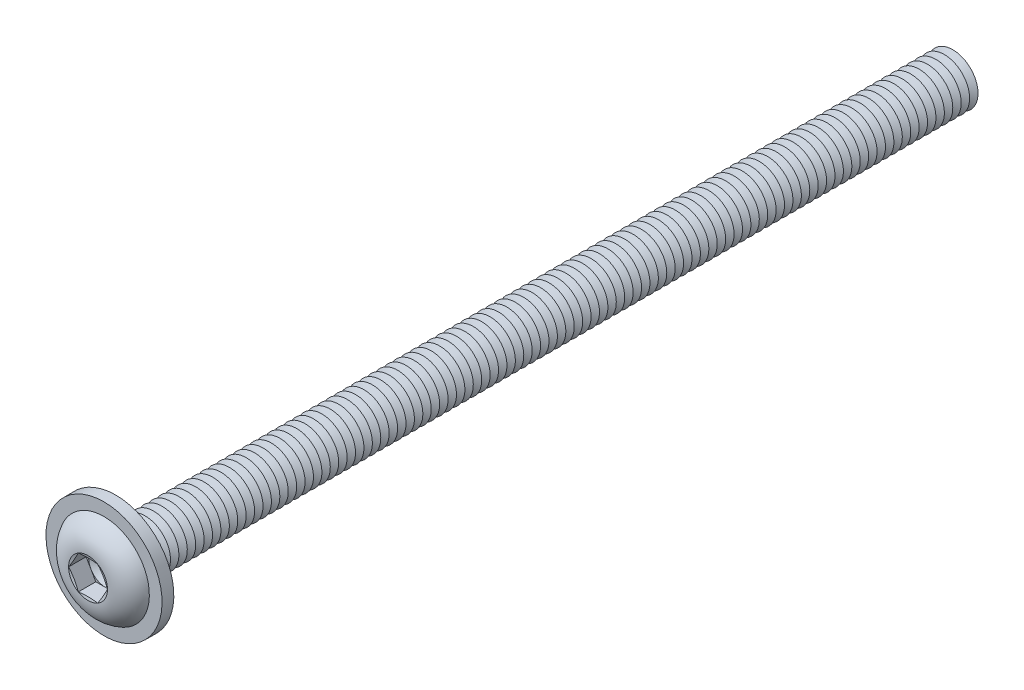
ISO-10303-21;
HEADER;
FILE_DESCRIPTION(('STEP AP214'),'2;1');
FILE_NAME('part.step','',(''),(''),'','','');
FILE_SCHEMA(('AUTOMOTIVE_DESIGN { 1 0 10303 214 1 1 1 1 }'));
ENDSEC;
DATA;
#1=APPLICATION_CONTEXT('core data for automotive mechanical design processes');
#2=APPLICATION_PROTOCOL_DEFINITION('international standard','automotive_design',2000,#1);
#3=PRODUCT_CONTEXT('',#1,'mechanical');
#4=PRODUCT('Part','Part','',(#3));
#5=PRODUCT_RELATED_PRODUCT_CATEGORY('part','',(#4));
#6=PRODUCT_DEFINITION_FORMATION('','',#4);
#7=PRODUCT_DEFINITION_CONTEXT('part definition',#1,'design');
#8=PRODUCT_DEFINITION('design','',#6,#7);
#9=PRODUCT_DEFINITION_SHAPE('','',#8);
#10=(LENGTH_UNIT() NAMED_UNIT(*) SI_UNIT(.MILLI.,.METRE.));
#11=(NAMED_UNIT(*) PLANE_ANGLE_UNIT() SI_UNIT($,.RADIAN.));
#12=(NAMED_UNIT(*) SI_UNIT($,.STERADIAN.) SOLID_ANGLE_UNIT());
#13=UNCERTAINTY_MEASURE_WITH_UNIT(LENGTH_MEASURE(1.E-05),#10,'distance_accuracy_value','');
#14=(GEOMETRIC_REPRESENTATION_CONTEXT(3) GLOBAL_UNCERTAINTY_ASSIGNED_CONTEXT((#13)) GLOBAL_UNIT_ASSIGNED_CONTEXT((#10,
#11,#12)) REPRESENTATION_CONTEXT('',''));
#15=CARTESIAN_POINT('',(0.,0.,0.));
#16=DIRECTION('',(0.,0.,1.));
#17=DIRECTION('',(1.,0.,0.));
#18=AXIS2_PLACEMENT_3D('',#15,#16,#17);
#19=CARTESIAN_POINT('',(0.,0.,-48.25));
#20=DIRECTION('',(0.,0.,1.));
#21=DIRECTION('',(0.,-1.,0.));
#22=AXIS2_PLACEMENT_3D('',#19,#20,#21);
#23=CONICAL_SURFACE('',#22,1.49999999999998,1.0471975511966);
#24=CARTESIAN_POINT('',(0.,0.,-48.5));
#25=DIRECTION('',(0.,0.,1.));
#26=DIRECTION('',(0.,-1.,0.));
#27=AXIS2_PLACEMENT_3D('',#24,#25,#26);
#28=CIRCLE('',#27,1.06698729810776);
#29=CARTESIAN_POINT('',(0.,-1.06698729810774,-48.5));
#30=VERTEX_POINT('',#29);
#31=EDGE_CURVE('E1009',#30,#30,#28,.T.);
#32=ORIENTED_EDGE('',*,*,#31,.T.);
#33=EDGE_LOOP('',(#32));
#34=FACE_BOUND('',#33,.T.);
#35=CARTESIAN_POINT('',(0.,0.,-48.25));
#36=DIRECTION('',(0.,0.,1.));
#37=DIRECTION('',(0.,-1.,0.));
#38=AXIS2_PLACEMENT_3D('',#35,#36,#37);
#39=CIRCLE('',#38,1.49999999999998);
#40=CARTESIAN_POINT('',(0.,-1.49999999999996,-48.25));
#41=VERTEX_POINT('',#40);
#42=EDGE_CURVE('E1005',#41,#41,#39,.T.);
#43=ORIENTED_EDGE('',*,*,#42,.F.);
#44=EDGE_LOOP('',(#43));
#45=FACE_BOUND('',#44,.T.);
#46=ADVANCED_FACE('F39',(#34,#45),#23,.T.);
#47=CARTESIAN_POINT('',(0.,0.,-48.5));
#48=DIRECTION('',(0.,0.,-1.));
#49=DIRECTION('',(0.,1.,0.));
#50=AXIS2_PLACEMENT_3D('',#47,#48,#49);
#51=CONICAL_SURFACE('',#50,1.06698729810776,1.0471975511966);
#52=CARTESIAN_POINT('',(0.,0.,-48.75));
#53=DIRECTION('',(0.,0.,1.));
#54=DIRECTION('',(0.,-1.,0.));
#55=AXIS2_PLACEMENT_3D('',#52,#53,#54);
#56=CIRCLE('',#55,1.49999999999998);
#57=CARTESIAN_POINT('',(0.,-1.49999999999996,-48.75));
#58=VERTEX_POINT('',#57);
#59=EDGE_CURVE('E1013',#58,#58,#56,.T.);
#60=ORIENTED_EDGE('',*,*,#59,.T.);
#61=EDGE_LOOP('',(#60));
#62=FACE_BOUND('',#61,.T.);
#63=ORIENTED_EDGE('',*,*,#31,.F.);
#64=EDGE_LOOP('',(#63));
#65=FACE_BOUND('',#64,.T.);
#66=ADVANCED_FACE('F1128',(#62,#65),#51,.T.);
#67=CARTESIAN_POINT('',(0.,1.49999999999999,-50.));
#68=DIRECTION('',(0.,0.,-1.));
#69=DIRECTION('',(0.,1.,0.));
#70=AXIS2_PLACEMENT_3D('',#67,#68,#69);
#71=PLANE('',#70);
#72=CARTESIAN_POINT('',(0.,0.,-50.));
#73=DIRECTION('',(0.,0.,1.));
#74=DIRECTION('',(0.,-1.,0.));
#75=AXIS2_PLACEMENT_3D('',#72,#73,#74);
#76=CIRCLE('',#75,1.06698729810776);
#77=CARTESIAN_POINT('',(0.,-1.06698729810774,-50.));
#78=VERTEX_POINT('',#77);
#79=EDGE_CURVE('E1033',#78,#78,#76,.T.);
#80=ORIENTED_EDGE('',*,*,#79,.F.);
#81=EDGE_LOOP('',(#80));
#82=FACE_BOUND('',#81,.T.);
#83=ADVANCED_FACE('F1134',(#82),#71,.T.);
#84=CARTESIAN_POINT('',(0.,0.,-49.75));
#85=DIRECTION('',(0.,0.,1.));
#86=DIRECTION('',(0.,-1.,0.));
#87=AXIS2_PLACEMENT_3D('',#84,#85,#86);
#88=CONICAL_SURFACE('',#87,1.49999999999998,1.0471975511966);
#89=ORIENTED_EDGE('',*,*,#79,.T.);
#90=EDGE_LOOP('',(#89));
#91=FACE_BOUND('',#90,.T.);
#92=CARTESIAN_POINT('',(0.,0.,-49.75));
#93=DIRECTION('',(0.,0.,1.));
#94=DIRECTION('',(0.,-1.,0.));
#95=AXIS2_PLACEMENT_3D('',#92,#93,#94);
#96=CIRCLE('',#95,1.49999999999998);
#97=CARTESIAN_POINT('',(0.,-1.49999999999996,-49.75));
#98=VERTEX_POINT('',#97);
#99=EDGE_CURVE('E1029',#98,#98,#96,.T.);
#100=ORIENTED_EDGE('',*,*,#99,.F.);
#101=EDGE_LOOP('',(#100));
#102=FACE_BOUND('',#101,.T.);
#103=ADVANCED_FACE('F1153',(#91,#102),#88,.T.);
#104=CARTESIAN_POINT('',(0.,0.,-49.5));
#105=DIRECTION('',(0.,0.,-1.));
#106=DIRECTION('',(0.,1.,0.));
#107=AXIS2_PLACEMENT_3D('',#104,#105,#106);
#108=CONICAL_SURFACE('',#107,1.06698729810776,1.0471975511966);
#109=ORIENTED_EDGE('',*,*,#99,.T.);
#110=EDGE_LOOP('',(#109));
#111=FACE_BOUND('',#110,.T.);
#112=CARTESIAN_POINT('',(0.,0.,-49.5));
#113=DIRECTION('',(0.,0.,1.));
#114=DIRECTION('',(0.,-1.,0.));
#115=AXIS2_PLACEMENT_3D('',#112,#113,#114);
#116=CIRCLE('',#115,1.06698729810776);
#117=CARTESIAN_POINT('',(0.,-1.06698729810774,-49.5));
#118=VERTEX_POINT('',#117);
#119=EDGE_CURVE('E1025',#118,#118,#116,.T.);
#120=ORIENTED_EDGE('',*,*,#119,.F.);
#121=EDGE_LOOP('',(#120));
#122=FACE_BOUND('',#121,.T.);
#123=ADVANCED_FACE('F1150',(#111,#122),#108,.T.);
#124=CARTESIAN_POINT('',(0.,0.,-49.25));
#125=DIRECTION('',(0.,0.,1.));
#126=DIRECTION('',(0.,-1.,0.));
#127=AXIS2_PLACEMENT_3D('',#124,#125,#126);
#128=CONICAL_SURFACE('',#127,1.49999999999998,1.0471975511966);
#129=ORIENTED_EDGE('',*,*,#119,.T.);
#130=EDGE_LOOP('',(#129));
#131=FACE_BOUND('',#130,.T.);
#132=CARTESIAN_POINT('',(0.,0.,-49.25));
#133=DIRECTION('',(0.,0.,1.));
#134=DIRECTION('',(0.,-1.,0.));
#135=AXIS2_PLACEMENT_3D('',#132,#133,#134);
#136=CIRCLE('',#135,1.49999999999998);
#137=CARTESIAN_POINT('',(0.,-1.49999999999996,-49.25));
#138=VERTEX_POINT('',#137);
#139=EDGE_CURVE('E1021',#138,#138,#136,.T.);
#140=ORIENTED_EDGE('',*,*,#139,.F.);
#141=EDGE_LOOP('',(#140));
#142=FACE_BOUND('',#141,.T.);
#143=ADVANCED_FACE('F1144',(#131,#142),#128,.T.);
#144=CARTESIAN_POINT('',(0.,0.,-49.));
#145=DIRECTION('',(0.,0.,-1.));
#146=DIRECTION('',(0.,1.,0.));
#147=AXIS2_PLACEMENT_3D('',#144,#145,#146);
#148=CONICAL_SURFACE('',#147,1.06698729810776,1.0471975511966);
#149=ORIENTED_EDGE('',*,*,#139,.T.);
#150=EDGE_LOOP('',(#149));
#151=FACE_BOUND('',#150,.T.);
#152=CARTESIAN_POINT('',(0.,0.,-49.));
#153=DIRECTION('',(0.,0.,1.));
#154=DIRECTION('',(0.,-1.,0.));
#155=AXIS2_PLACEMENT_3D('',#152,#153,#154);
#156=CIRCLE('',#155,1.06698729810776);
#157=CARTESIAN_POINT('',(0.,-1.06698729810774,-49.));
#158=VERTEX_POINT('',#157);
#159=EDGE_CURVE('E1017',#158,#158,#156,.T.);
#160=ORIENTED_EDGE('',*,*,#159,.F.);
#161=EDGE_LOOP('',(#160));
#162=FACE_BOUND('',#161,.T.);
#163=ADVANCED_FACE('F1140',(#151,#162),#148,.T.);
#164=CARTESIAN_POINT('',(0.,0.,-48.75));
#165=DIRECTION('',(0.,0.,1.));
#166=DIRECTION('',(0.,-1.,0.));
#167=AXIS2_PLACEMENT_3D('',#164,#165,#166);
#168=CONICAL_SURFACE('',#167,1.49999999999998,1.0471975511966);
#169=ORIENTED_EDGE('',*,*,#159,.T.);
#170=EDGE_LOOP('',(#169));
#171=FACE_BOUND('',#170,.T.);
#172=ORIENTED_EDGE('',*,*,#59,.F.);
#173=EDGE_LOOP('',(#172));
#174=FACE_BOUND('',#173,.T.);
#175=ADVANCED_FACE('F1143',(#171,#174),#168,.T.);
#176=CARTESIAN_POINT('',(0.,0.,-47.75));
#177=DIRECTION('',(0.,0.,1.));
#178=DIRECTION('',(0.,-1.,0.));
#179=AXIS2_PLACEMENT_3D('',#176,#177,#178);
#180=CONICAL_SURFACE('',#179,1.49999999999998,1.0471975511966);
#181=CARTESIAN_POINT('',(0.,0.,-48.));
#182=DIRECTION('',(0.,0.,1.));
#183=DIRECTION('',(0.,-1.,0.));
#184=AXIS2_PLACEMENT_3D('',#181,#182,#183);
#185=CIRCLE('',#184,1.06698729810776);
#186=CARTESIAN_POINT('',(0.,-1.06698729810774,-48.));
#187=VERTEX_POINT('',#186);
#188=EDGE_CURVE('E1001',#187,#187,#185,.T.);
#189=ORIENTED_EDGE('',*,*,#188,.T.);
#190=EDGE_LOOP('',(#189));
#191=FACE_BOUND('',#190,.T.);
#192=CARTESIAN_POINT('',(0.,0.,-47.75));
#193=DIRECTION('',(0.,0.,1.));
#194=DIRECTION('',(0.,-1.,0.));
#195=AXIS2_PLACEMENT_3D('',#192,#193,#194);
#196=CIRCLE('',#195,1.49999999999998);
#197=CARTESIAN_POINT('',(0.,-1.49999999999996,-47.75));
#198=VERTEX_POINT('',#197);
#199=EDGE_CURVE('E997',#198,#198,#196,.T.);
#200=ORIENTED_EDGE('',*,*,#199,.F.);
#201=EDGE_LOOP('',(#200));
#202=FACE_BOUND('',#201,.T.);
#203=ADVANCED_FACE('F1148',(#191,#202),#180,.T.);
#204=CARTESIAN_POINT('',(0.,0.,-48.));
#205=DIRECTION('',(0.,0.,-1.));
#206=DIRECTION('',(0.,1.,0.));
#207=AXIS2_PLACEMENT_3D('',#204,#205,#206);
#208=CONICAL_SURFACE('',#207,1.06698729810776,1.0471975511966);
#209=ORIENTED_EDGE('',*,*,#42,.T.);
#210=EDGE_LOOP('',(#209));
#211=FACE_BOUND('',#210,.T.);
#212=ORIENTED_EDGE('',*,*,#188,.F.);
#213=EDGE_LOOP('',(#212));
#214=FACE_BOUND('',#213,.T.);
#215=ADVANCED_FACE('F1199',(#211,#214),#208,.T.);
#216=CARTESIAN_POINT('',(0.,0.,-47.25));
#217=DIRECTION('',(0.,0.,1.));
#218=DIRECTION('',(0.,-1.,0.));
#219=AXIS2_PLACEMENT_3D('',#216,#217,#218);
#220=CONICAL_SURFACE('',#219,1.49999999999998,1.0471975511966);
#221=CARTESIAN_POINT('',(0.,0.,-47.5));
#222=DIRECTION('',(0.,0.,1.));
#223=DIRECTION('',(0.,-1.,0.));
#224=AXIS2_PLACEMENT_3D('',#221,#222,#223);
#225=CIRCLE('',#224,1.06698729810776);
#226=CARTESIAN_POINT('',(0.,-1.06698729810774,-47.5));
#227=VERTEX_POINT('',#226);
#228=EDGE_CURVE('E993',#227,#227,#225,.T.);
#229=ORIENTED_EDGE('',*,*,#228,.T.);
#230=EDGE_LOOP('',(#229));
#231=FACE_BOUND('',#230,.T.);
#232=CARTESIAN_POINT('',(0.,0.,-47.25));
#233=DIRECTION('',(0.,0.,1.));
#234=DIRECTION('',(0.,-1.,0.));
#235=AXIS2_PLACEMENT_3D('',#232,#233,#234);
#236=CIRCLE('',#235,1.49999999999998);
#237=CARTESIAN_POINT('',(0.,-1.49999999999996,-47.25));
#238=VERTEX_POINT('',#237);
#239=EDGE_CURVE('E989',#238,#238,#236,.T.);
#240=ORIENTED_EDGE('',*,*,#239,.F.);
#241=EDGE_LOOP('',(#240));
#242=FACE_BOUND('',#241,.T.);
#243=ADVANCED_FACE('F1205',(#231,#242),#220,.T.);
#244=CARTESIAN_POINT('',(0.,0.,-47.5));
#245=DIRECTION('',(0.,0.,-1.));
#246=DIRECTION('',(0.,1.,0.));
#247=AXIS2_PLACEMENT_3D('',#244,#245,#246);
#248=CONICAL_SURFACE('',#247,1.06698729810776,1.0471975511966);
#249=ORIENTED_EDGE('',*,*,#199,.T.);
#250=EDGE_LOOP('',(#249));
#251=FACE_BOUND('',#250,.T.);
#252=ORIENTED_EDGE('',*,*,#228,.F.);
#253=EDGE_LOOP('',(#252));
#254=FACE_BOUND('',#253,.T.);
#255=ADVANCED_FACE('F1212',(#251,#254),#248,.T.);
#256=CARTESIAN_POINT('',(0.,0.,-46.75));
#257=DIRECTION('',(0.,0.,1.));
#258=DIRECTION('',(0.,-1.,0.));
#259=AXIS2_PLACEMENT_3D('',#256,#257,#258);
#260=CONICAL_SURFACE('',#259,1.49999999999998,1.0471975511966);
#261=CARTESIAN_POINT('',(0.,0.,-47.));
#262=DIRECTION('',(0.,0.,1.));
#263=DIRECTION('',(0.,-1.,0.));
#264=AXIS2_PLACEMENT_3D('',#261,#262,#263);
#265=CIRCLE('',#264,1.06698729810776);
#266=CARTESIAN_POINT('',(0.,-1.06698729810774,-47.));
#267=VERTEX_POINT('',#266);
#268=EDGE_CURVE('E985',#267,#267,#265,.T.);
#269=ORIENTED_EDGE('',*,*,#268,.T.);
#270=EDGE_LOOP('',(#269));
#271=FACE_BOUND('',#270,.T.);
#272=CARTESIAN_POINT('',(0.,0.,-46.75));
#273=DIRECTION('',(0.,0.,1.));
#274=DIRECTION('',(0.,-1.,0.));
#275=AXIS2_PLACEMENT_3D('',#272,#273,#274);
#276=CIRCLE('',#275,1.49999999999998);
#277=CARTESIAN_POINT('',(0.,-1.49999999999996,-46.75));
#278=VERTEX_POINT('',#277);
#279=EDGE_CURVE('E981',#278,#278,#276,.T.);
#280=ORIENTED_EDGE('',*,*,#279,.F.);
#281=EDGE_LOOP('',(#280));
#282=FACE_BOUND('',#281,.T.);
#283=ADVANCED_FACE('F1219',(#271,#282),#260,.T.);
#284=CARTESIAN_POINT('',(0.,0.,-47.));
#285=DIRECTION('',(0.,0.,-1.));
#286=DIRECTION('',(0.,1.,0.));
#287=AXIS2_PLACEMENT_3D('',#284,#285,#286);
#288=CONICAL_SURFACE('',#287,1.06698729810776,1.0471975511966);
#289=ORIENTED_EDGE('',*,*,#239,.T.);
#290=EDGE_LOOP('',(#289));
#291=FACE_BOUND('',#290,.T.);
#292=ORIENTED_EDGE('',*,*,#268,.F.);
#293=EDGE_LOOP('',(#292));
#294=FACE_BOUND('',#293,.T.);
#295=ADVANCED_FACE('F1226',(#291,#294),#288,.T.);
#296=CARTESIAN_POINT('',(0.,0.,-46.25));
#297=DIRECTION('',(0.,0.,1.));
#298=DIRECTION('',(0.,-1.,0.));
#299=AXIS2_PLACEMENT_3D('',#296,#297,#298);
#300=CONICAL_SURFACE('',#299,1.49999999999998,1.0471975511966);
#301=CARTESIAN_POINT('',(0.,0.,-46.5));
#302=DIRECTION('',(0.,0.,1.));
#303=DIRECTION('',(0.,-1.,0.));
#304=AXIS2_PLACEMENT_3D('',#301,#302,#303);
#305=CIRCLE('',#304,1.06698729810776);
#306=CARTESIAN_POINT('',(0.,-1.06698729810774,-46.5));
#307=VERTEX_POINT('',#306);
#308=EDGE_CURVE('E977',#307,#307,#305,.T.);
#309=ORIENTED_EDGE('',*,*,#308,.T.);
#310=EDGE_LOOP('',(#309));
#311=FACE_BOUND('',#310,.T.);
#312=CARTESIAN_POINT('',(0.,0.,-46.25));
#313=DIRECTION('',(0.,0.,1.));
#314=DIRECTION('',(0.,-1.,0.));
#315=AXIS2_PLACEMENT_3D('',#312,#313,#314);
#316=CIRCLE('',#315,1.49999999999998);
#317=CARTESIAN_POINT('',(0.,-1.49999999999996,-46.25));
#318=VERTEX_POINT('',#317);
#319=EDGE_CURVE('E973',#318,#318,#316,.T.);
#320=ORIENTED_EDGE('',*,*,#319,.F.);
#321=EDGE_LOOP('',(#320));
#322=FACE_BOUND('',#321,.T.);
#323=ADVANCED_FACE('F1233',(#311,#322),#300,.T.);
#324=CARTESIAN_POINT('',(0.,0.,-46.5));
#325=DIRECTION('',(0.,0.,-1.));
#326=DIRECTION('',(0.,1.,0.));
#327=AXIS2_PLACEMENT_3D('',#324,#325,#326);
#328=CONICAL_SURFACE('',#327,1.06698729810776,1.0471975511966);
#329=ORIENTED_EDGE('',*,*,#279,.T.);
#330=EDGE_LOOP('',(#329));
#331=FACE_BOUND('',#330,.T.);
#332=ORIENTED_EDGE('',*,*,#308,.F.);
#333=EDGE_LOOP('',(#332));
#334=FACE_BOUND('',#333,.T.);
#335=ADVANCED_FACE('F1240',(#331,#334),#328,.T.);
#336=CARTESIAN_POINT('',(0.,0.,-45.75));
#337=DIRECTION('',(0.,0.,1.));
#338=DIRECTION('',(0.,-1.,0.));
#339=AXIS2_PLACEMENT_3D('',#336,#337,#338);
#340=CONICAL_SURFACE('',#339,1.49999999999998,1.0471975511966);
#341=CARTESIAN_POINT('',(0.,0.,-46.));
#342=DIRECTION('',(0.,0.,1.));
#343=DIRECTION('',(0.,-1.,0.));
#344=AXIS2_PLACEMENT_3D('',#341,#342,#343);
#345=CIRCLE('',#344,1.06698729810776);
#346=CARTESIAN_POINT('',(0.,-1.06698729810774,-46.));
#347=VERTEX_POINT('',#346);
#348=EDGE_CURVE('E969',#347,#347,#345,.T.);
#349=ORIENTED_EDGE('',*,*,#348,.T.);
#350=EDGE_LOOP('',(#349));
#351=FACE_BOUND('',#350,.T.);
#352=CARTESIAN_POINT('',(0.,0.,-45.75));
#353=DIRECTION('',(0.,0.,1.));
#354=DIRECTION('',(0.,-1.,0.));
#355=AXIS2_PLACEMENT_3D('',#352,#353,#354);
#356=CIRCLE('',#355,1.49999999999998);
#357=CARTESIAN_POINT('',(0.,-1.49999999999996,-45.75));
#358=VERTEX_POINT('',#357);
#359=EDGE_CURVE('E965',#358,#358,#356,.T.);
#360=ORIENTED_EDGE('',*,*,#359,.F.);
#361=EDGE_LOOP('',(#360));
#362=FACE_BOUND('',#361,.T.);
#363=ADVANCED_FACE('F1247',(#351,#362),#340,.T.);
#364=CARTESIAN_POINT('',(0.,0.,-46.));
#365=DIRECTION('',(0.,0.,-1.));
#366=DIRECTION('',(0.,1.,0.));
#367=AXIS2_PLACEMENT_3D('',#364,#365,#366);
#368=CONICAL_SURFACE('',#367,1.06698729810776,1.0471975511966);
#369=ORIENTED_EDGE('',*,*,#319,.T.);
#370=EDGE_LOOP('',(#369));
#371=FACE_BOUND('',#370,.T.);
#372=ORIENTED_EDGE('',*,*,#348,.F.);
#373=EDGE_LOOP('',(#372));
#374=FACE_BOUND('',#373,.T.);
#375=ADVANCED_FACE('F1254',(#371,#374),#368,.T.);
#376=CARTESIAN_POINT('',(0.,0.,-45.25));
#377=DIRECTION('',(0.,0.,1.));
#378=DIRECTION('',(0.,-1.,0.));
#379=AXIS2_PLACEMENT_3D('',#376,#377,#378);
#380=CONICAL_SURFACE('',#379,1.49999999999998,1.0471975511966);
#381=CARTESIAN_POINT('',(0.,0.,-45.5));
#382=DIRECTION('',(0.,0.,1.));
#383=DIRECTION('',(0.,-1.,0.));
#384=AXIS2_PLACEMENT_3D('',#381,#382,#383);
#385=CIRCLE('',#384,1.06698729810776);
#386=CARTESIAN_POINT('',(0.,-1.06698729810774,-45.5));
#387=VERTEX_POINT('',#386);
#388=EDGE_CURVE('E961',#387,#387,#385,.T.);
#389=ORIENTED_EDGE('',*,*,#388,.T.);
#390=EDGE_LOOP('',(#389));
#391=FACE_BOUND('',#390,.T.);
#392=CARTESIAN_POINT('',(0.,0.,-45.25));
#393=DIRECTION('',(0.,0.,1.));
#394=DIRECTION('',(0.,-1.,0.));
#395=AXIS2_PLACEMENT_3D('',#392,#393,#394);
#396=CIRCLE('',#395,1.49999999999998);
#397=CARTESIAN_POINT('',(0.,-1.49999999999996,-45.25));
#398=VERTEX_POINT('',#397);
#399=EDGE_CURVE('E957',#398,#398,#396,.T.);
#400=ORIENTED_EDGE('',*,*,#399,.F.);
#401=EDGE_LOOP('',(#400));
#402=FACE_BOUND('',#401,.T.);
#403=ADVANCED_FACE('F1261',(#391,#402),#380,.T.);
#404=CARTESIAN_POINT('',(0.,0.,-45.5));
#405=DIRECTION('',(0.,0.,-1.));
#406=DIRECTION('',(0.,1.,0.));
#407=AXIS2_PLACEMENT_3D('',#404,#405,#406);
#408=CONICAL_SURFACE('',#407,1.06698729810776,1.0471975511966);
#409=ORIENTED_EDGE('',*,*,#359,.T.);
#410=EDGE_LOOP('',(#409));
#411=FACE_BOUND('',#410,.T.);
#412=ORIENTED_EDGE('',*,*,#388,.F.);
#413=EDGE_LOOP('',(#412));
#414=FACE_BOUND('',#413,.T.);
#415=ADVANCED_FACE('F1268',(#411,#414),#408,.T.);
#416=CARTESIAN_POINT('',(0.,0.,-44.75));
#417=DIRECTION('',(0.,0.,1.));
#418=DIRECTION('',(0.,-1.,0.));
#419=AXIS2_PLACEMENT_3D('',#416,#417,#418);
#420=CONICAL_SURFACE('',#419,1.49999999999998,1.0471975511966);
#421=CARTESIAN_POINT('',(0.,0.,-45.));
#422=DIRECTION('',(0.,0.,1.));
#423=DIRECTION('',(0.,-1.,0.));
#424=AXIS2_PLACEMENT_3D('',#421,#422,#423);
#425=CIRCLE('',#424,1.06698729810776);
#426=CARTESIAN_POINT('',(0.,-1.06698729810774,-45.));
#427=VERTEX_POINT('',#426);
#428=EDGE_CURVE('E953',#427,#427,#425,.T.);
#429=ORIENTED_EDGE('',*,*,#428,.T.);
#430=EDGE_LOOP('',(#429));
#431=FACE_BOUND('',#430,.T.);
#432=CARTESIAN_POINT('',(0.,0.,-44.75));
#433=DIRECTION('',(0.,0.,1.));
#434=DIRECTION('',(0.,-1.,0.));
#435=AXIS2_PLACEMENT_3D('',#432,#433,#434);
#436=CIRCLE('',#435,1.49999999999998);
#437=CARTESIAN_POINT('',(0.,-1.49999999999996,-44.75));
#438=VERTEX_POINT('',#437);
#439=EDGE_CURVE('E949',#438,#438,#436,.T.);
#440=ORIENTED_EDGE('',*,*,#439,.F.);
#441=EDGE_LOOP('',(#440));
#442=FACE_BOUND('',#441,.T.);
#443=ADVANCED_FACE('F1275',(#431,#442),#420,.T.);
#444=CARTESIAN_POINT('',(0.,0.,-45.));
#445=DIRECTION('',(0.,0.,-1.));
#446=DIRECTION('',(0.,1.,0.));
#447=AXIS2_PLACEMENT_3D('',#444,#445,#446);
#448=CONICAL_SURFACE('',#447,1.06698729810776,1.0471975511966);
#449=ORIENTED_EDGE('',*,*,#399,.T.);
#450=EDGE_LOOP('',(#449));
#451=FACE_BOUND('',#450,.T.);
#452=ORIENTED_EDGE('',*,*,#428,.F.);
#453=EDGE_LOOP('',(#452));
#454=FACE_BOUND('',#453,.T.);
#455=ADVANCED_FACE('F1282',(#451,#454),#448,.T.);
#456=CARTESIAN_POINT('',(0.,0.,-44.25));
#457=DIRECTION('',(0.,0.,1.));
#458=DIRECTION('',(0.,-1.,0.));
#459=AXIS2_PLACEMENT_3D('',#456,#457,#458);
#460=CONICAL_SURFACE('',#459,1.49999999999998,1.0471975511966);
#461=CARTESIAN_POINT('',(0.,0.,-44.5));
#462=DIRECTION('',(0.,0.,1.));
#463=DIRECTION('',(0.,-1.,0.));
#464=AXIS2_PLACEMENT_3D('',#461,#462,#463);
#465=CIRCLE('',#464,1.06698729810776);
#466=CARTESIAN_POINT('',(0.,-1.06698729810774,-44.5));
#467=VERTEX_POINT('',#466);
#468=EDGE_CURVE('E945',#467,#467,#465,.T.);
#469=ORIENTED_EDGE('',*,*,#468,.T.);
#470=EDGE_LOOP('',(#469));
#471=FACE_BOUND('',#470,.T.);
#472=CARTESIAN_POINT('',(0.,0.,-44.25));
#473=DIRECTION('',(0.,0.,1.));
#474=DIRECTION('',(0.,-1.,0.));
#475=AXIS2_PLACEMENT_3D('',#472,#473,#474);
#476=CIRCLE('',#475,1.49999999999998);
#477=CARTESIAN_POINT('',(0.,-1.49999999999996,-44.25));
#478=VERTEX_POINT('',#477);
#479=EDGE_CURVE('E941',#478,#478,#476,.T.);
#480=ORIENTED_EDGE('',*,*,#479,.F.);
#481=EDGE_LOOP('',(#480));
#482=FACE_BOUND('',#481,.T.);
#483=ADVANCED_FACE('F1289',(#471,#482),#460,.T.);
#484=CARTESIAN_POINT('',(0.,0.,-44.5));
#485=DIRECTION('',(0.,0.,-1.));
#486=DIRECTION('',(0.,1.,0.));
#487=AXIS2_PLACEMENT_3D('',#484,#485,#486);
#488=CONICAL_SURFACE('',#487,1.06698729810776,1.0471975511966);
#489=ORIENTED_EDGE('',*,*,#439,.T.);
#490=EDGE_LOOP('',(#489));
#491=FACE_BOUND('',#490,.T.);
#492=ORIENTED_EDGE('',*,*,#468,.F.);
#493=EDGE_LOOP('',(#492));
#494=FACE_BOUND('',#493,.T.);
#495=ADVANCED_FACE('F1296',(#491,#494),#488,.T.);
#496=CARTESIAN_POINT('',(0.,0.,-43.75));
#497=DIRECTION('',(0.,0.,1.));
#498=DIRECTION('',(0.,-1.,0.));
#499=AXIS2_PLACEMENT_3D('',#496,#497,#498);
#500=CONICAL_SURFACE('',#499,1.49999999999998,1.0471975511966);
#501=CARTESIAN_POINT('',(0.,0.,-44.));
#502=DIRECTION('',(0.,0.,1.));
#503=DIRECTION('',(0.,-1.,0.));
#504=AXIS2_PLACEMENT_3D('',#501,#502,#503);
#505=CIRCLE('',#504,1.06698729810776);
#506=CARTESIAN_POINT('',(0.,-1.06698729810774,-44.));
#507=VERTEX_POINT('',#506);
#508=EDGE_CURVE('E937',#507,#507,#505,.T.);
#509=ORIENTED_EDGE('',*,*,#508,.T.);
#510=EDGE_LOOP('',(#509));
#511=FACE_BOUND('',#510,.T.);
#512=CARTESIAN_POINT('',(0.,0.,-43.75));
#513=DIRECTION('',(0.,0.,1.));
#514=DIRECTION('',(0.,-1.,0.));
#515=AXIS2_PLACEMENT_3D('',#512,#513,#514);
#516=CIRCLE('',#515,1.49999999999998);
#517=CARTESIAN_POINT('',(0.,-1.49999999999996,-43.75));
#518=VERTEX_POINT('',#517);
#519=EDGE_CURVE('E933',#518,#518,#516,.T.);
#520=ORIENTED_EDGE('',*,*,#519,.F.);
#521=EDGE_LOOP('',(#520));
#522=FACE_BOUND('',#521,.T.);
#523=ADVANCED_FACE('F1303',(#511,#522),#500,.T.);
#524=CARTESIAN_POINT('',(0.,0.,-44.));
#525=DIRECTION('',(0.,0.,-1.));
#526=DIRECTION('',(0.,1.,0.));
#527=AXIS2_PLACEMENT_3D('',#524,#525,#526);
#528=CONICAL_SURFACE('',#527,1.06698729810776,1.0471975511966);
#529=ORIENTED_EDGE('',*,*,#479,.T.);
#530=EDGE_LOOP('',(#529));
#531=FACE_BOUND('',#530,.T.);
#532=ORIENTED_EDGE('',*,*,#508,.F.);
#533=EDGE_LOOP('',(#532));
#534=FACE_BOUND('',#533,.T.);
#535=ADVANCED_FACE('F1310',(#531,#534),#528,.T.);
#536=CARTESIAN_POINT('',(0.,0.,-43.25));
#537=DIRECTION('',(0.,0.,1.));
#538=DIRECTION('',(0.,-1.,0.));
#539=AXIS2_PLACEMENT_3D('',#536,#537,#538);
#540=CONICAL_SURFACE('',#539,1.49999999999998,1.0471975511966);
#541=CARTESIAN_POINT('',(0.,0.,-43.5));
#542=DIRECTION('',(0.,0.,1.));
#543=DIRECTION('',(0.,-1.,0.));
#544=AXIS2_PLACEMENT_3D('',#541,#542,#543);
#545=CIRCLE('',#544,1.06698729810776);
#546=CARTESIAN_POINT('',(0.,-1.06698729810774,-43.5));
#547=VERTEX_POINT('',#546);
#548=EDGE_CURVE('E929',#547,#547,#545,.T.);
#549=ORIENTED_EDGE('',*,*,#548,.T.);
#550=EDGE_LOOP('',(#549));
#551=FACE_BOUND('',#550,.T.);
#552=CARTESIAN_POINT('',(0.,0.,-43.25));
#553=DIRECTION('',(0.,0.,1.));
#554=DIRECTION('',(0.,-1.,0.));
#555=AXIS2_PLACEMENT_3D('',#552,#553,#554);
#556=CIRCLE('',#555,1.49999999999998);
#557=CARTESIAN_POINT('',(0.,-1.49999999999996,-43.25));
#558=VERTEX_POINT('',#557);
#559=EDGE_CURVE('E925',#558,#558,#556,.T.);
#560=ORIENTED_EDGE('',*,*,#559,.F.);
#561=EDGE_LOOP('',(#560));
#562=FACE_BOUND('',#561,.T.);
#563=ADVANCED_FACE('F1317',(#551,#562),#540,.T.);
#564=CARTESIAN_POINT('',(0.,0.,-43.5));
#565=DIRECTION('',(0.,0.,-1.));
#566=DIRECTION('',(0.,1.,0.));
#567=AXIS2_PLACEMENT_3D('',#564,#565,#566);
#568=CONICAL_SURFACE('',#567,1.06698729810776,1.0471975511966);
#569=ORIENTED_EDGE('',*,*,#519,.T.);
#570=EDGE_LOOP('',(#569));
#571=FACE_BOUND('',#570,.T.);
#572=ORIENTED_EDGE('',*,*,#548,.F.);
#573=EDGE_LOOP('',(#572));
#574=FACE_BOUND('',#573,.T.);
#575=ADVANCED_FACE('F1324',(#571,#574),#568,.T.);
#576=CARTESIAN_POINT('',(0.,0.,-42.75));
#577=DIRECTION('',(0.,0.,1.));
#578=DIRECTION('',(0.,-1.,0.));
#579=AXIS2_PLACEMENT_3D('',#576,#577,#578);
#580=CONICAL_SURFACE('',#579,1.49999999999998,1.0471975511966);
#581=CARTESIAN_POINT('',(0.,0.,-43.));
#582=DIRECTION('',(0.,0.,1.));
#583=DIRECTION('',(0.,-1.,0.));
#584=AXIS2_PLACEMENT_3D('',#581,#582,#583);
#585=CIRCLE('',#584,1.06698729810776);
#586=CARTESIAN_POINT('',(0.,-1.06698729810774,-43.));
#587=VERTEX_POINT('',#586);
#588=EDGE_CURVE('E921',#587,#587,#585,.T.);
#589=ORIENTED_EDGE('',*,*,#588,.T.);
#590=EDGE_LOOP('',(#589));
#591=FACE_BOUND('',#590,.T.);
#592=CARTESIAN_POINT('',(0.,0.,-42.75));
#593=DIRECTION('',(0.,0.,1.));
#594=DIRECTION('',(0.,-1.,0.));
#595=AXIS2_PLACEMENT_3D('',#592,#593,#594);
#596=CIRCLE('',#595,1.49999999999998);
#597=CARTESIAN_POINT('',(0.,-1.49999999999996,-42.75));
#598=VERTEX_POINT('',#597);
#599=EDGE_CURVE('E917',#598,#598,#596,.T.);
#600=ORIENTED_EDGE('',*,*,#599,.F.);
#601=EDGE_LOOP('',(#600));
#602=FACE_BOUND('',#601,.T.);
#603=ADVANCED_FACE('F1331',(#591,#602),#580,.T.);
#604=CARTESIAN_POINT('',(0.,0.,-43.));
#605=DIRECTION('',(0.,0.,-1.));
#606=DIRECTION('',(0.,1.,0.));
#607=AXIS2_PLACEMENT_3D('',#604,#605,#606);
#608=CONICAL_SURFACE('',#607,1.06698729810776,1.0471975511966);
#609=ORIENTED_EDGE('',*,*,#559,.T.);
#610=EDGE_LOOP('',(#609));
#611=FACE_BOUND('',#610,.T.);
#612=ORIENTED_EDGE('',*,*,#588,.F.);
#613=EDGE_LOOP('',(#612));
#614=FACE_BOUND('',#613,.T.);
#615=ADVANCED_FACE('F1338',(#611,#614),#608,.T.);
#616=CARTESIAN_POINT('',(0.,0.,-42.25));
#617=DIRECTION('',(0.,0.,1.));
#618=DIRECTION('',(0.,-1.,0.));
#619=AXIS2_PLACEMENT_3D('',#616,#617,#618);
#620=CONICAL_SURFACE('',#619,1.49999999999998,1.0471975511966);
#621=CARTESIAN_POINT('',(0.,0.,-42.5));
#622=DIRECTION('',(0.,0.,1.));
#623=DIRECTION('',(0.,-1.,0.));
#624=AXIS2_PLACEMENT_3D('',#621,#622,#623);
#625=CIRCLE('',#624,1.06698729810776);
#626=CARTESIAN_POINT('',(0.,-1.06698729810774,-42.5));
#627=VERTEX_POINT('',#626);
#628=EDGE_CURVE('E913',#627,#627,#625,.T.);
#629=ORIENTED_EDGE('',*,*,#628,.T.);
#630=EDGE_LOOP('',(#629));
#631=FACE_BOUND('',#630,.T.);
#632=CARTESIAN_POINT('',(0.,0.,-42.25));
#633=DIRECTION('',(0.,0.,1.));
#634=DIRECTION('',(0.,-1.,0.));
#635=AXIS2_PLACEMENT_3D('',#632,#633,#634);
#636=CIRCLE('',#635,1.49999999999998);
#637=CARTESIAN_POINT('',(0.,-1.49999999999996,-42.25));
#638=VERTEX_POINT('',#637);
#639=EDGE_CURVE('E909',#638,#638,#636,.T.);
#640=ORIENTED_EDGE('',*,*,#639,.F.);
#641=EDGE_LOOP('',(#640));
#642=FACE_BOUND('',#641,.T.);
#643=ADVANCED_FACE('F1345',(#631,#642),#620,.T.);
#644=CARTESIAN_POINT('',(0.,0.,-42.5));
#645=DIRECTION('',(0.,0.,-1.));
#646=DIRECTION('',(0.,1.,0.));
#647=AXIS2_PLACEMENT_3D('',#644,#645,#646);
#648=CONICAL_SURFACE('',#647,1.06698729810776,1.0471975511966);
#649=ORIENTED_EDGE('',*,*,#599,.T.);
#650=EDGE_LOOP('',(#649));
#651=FACE_BOUND('',#650,.T.);
#652=ORIENTED_EDGE('',*,*,#628,.F.);
#653=EDGE_LOOP('',(#652));
#654=FACE_BOUND('',#653,.T.);
#655=ADVANCED_FACE('F1352',(#651,#654),#648,.T.);
#656=CARTESIAN_POINT('',(0.,0.,-41.75));
#657=DIRECTION('',(0.,0.,1.));
#658=DIRECTION('',(0.,-1.,0.));
#659=AXIS2_PLACEMENT_3D('',#656,#657,#658);
#660=CONICAL_SURFACE('',#659,1.49999999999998,1.0471975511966);
#661=CARTESIAN_POINT('',(0.,0.,-42.));
#662=DIRECTION('',(0.,0.,1.));
#663=DIRECTION('',(0.,-1.,0.));
#664=AXIS2_PLACEMENT_3D('',#661,#662,#663);
#665=CIRCLE('',#664,1.06698729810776);
#666=CARTESIAN_POINT('',(0.,-1.06698729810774,-42.));
#667=VERTEX_POINT('',#666);
#668=EDGE_CURVE('E905',#667,#667,#665,.T.);
#669=ORIENTED_EDGE('',*,*,#668,.T.);
#670=EDGE_LOOP('',(#669));
#671=FACE_BOUND('',#670,.T.);
#672=CARTESIAN_POINT('',(0.,0.,-41.75));
#673=DIRECTION('',(0.,0.,1.));
#674=DIRECTION('',(0.,-1.,0.));
#675=AXIS2_PLACEMENT_3D('',#672,#673,#674);
#676=CIRCLE('',#675,1.49999999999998);
#677=CARTESIAN_POINT('',(0.,-1.49999999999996,-41.75));
#678=VERTEX_POINT('',#677);
#679=EDGE_CURVE('E901',#678,#678,#676,.T.);
#680=ORIENTED_EDGE('',*,*,#679,.F.);
#681=EDGE_LOOP('',(#680));
#682=FACE_BOUND('',#681,.T.);
#683=ADVANCED_FACE('F1359',(#671,#682),#660,.T.);
#684=CARTESIAN_POINT('',(0.,0.,-42.));
#685=DIRECTION('',(0.,0.,-1.));
#686=DIRECTION('',(0.,1.,0.));
#687=AXIS2_PLACEMENT_3D('',#684,#685,#686);
#688=CONICAL_SURFACE('',#687,1.06698729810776,1.0471975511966);
#689=ORIENTED_EDGE('',*,*,#639,.T.);
#690=EDGE_LOOP('',(#689));
#691=FACE_BOUND('',#690,.T.);
#692=ORIENTED_EDGE('',*,*,#668,.F.);
#693=EDGE_LOOP('',(#692));
#694=FACE_BOUND('',#693,.T.);
#695=ADVANCED_FACE('F1366',(#691,#694),#688,.T.);
#696=CARTESIAN_POINT('',(0.,0.,-41.25));
#697=DIRECTION('',(0.,0.,1.));
#698=DIRECTION('',(0.,-1.,0.));
#699=AXIS2_PLACEMENT_3D('',#696,#697,#698);
#700=CONICAL_SURFACE('',#699,1.49999999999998,1.0471975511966);
#701=CARTESIAN_POINT('',(0.,0.,-41.5));
#702=DIRECTION('',(0.,0.,1.));
#703=DIRECTION('',(0.,-1.,0.));
#704=AXIS2_PLACEMENT_3D('',#701,#702,#703);
#705=CIRCLE('',#704,1.06698729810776);
#706=CARTESIAN_POINT('',(0.,-1.06698729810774,-41.5));
#707=VERTEX_POINT('',#706);
#708=EDGE_CURVE('E897',#707,#707,#705,.T.);
#709=ORIENTED_EDGE('',*,*,#708,.T.);
#710=EDGE_LOOP('',(#709));
#711=FACE_BOUND('',#710,.T.);
#712=CARTESIAN_POINT('',(0.,0.,-41.25));
#713=DIRECTION('',(0.,0.,1.));
#714=DIRECTION('',(0.,-1.,0.));
#715=AXIS2_PLACEMENT_3D('',#712,#713,#714);
#716=CIRCLE('',#715,1.49999999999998);
#717=CARTESIAN_POINT('',(0.,-1.49999999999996,-41.25));
#718=VERTEX_POINT('',#717);
#719=EDGE_CURVE('E893',#718,#718,#716,.T.);
#720=ORIENTED_EDGE('',*,*,#719,.F.);
#721=EDGE_LOOP('',(#720));
#722=FACE_BOUND('',#721,.T.);
#723=ADVANCED_FACE('F1373',(#711,#722),#700,.T.);
#724=CARTESIAN_POINT('',(0.,0.,-41.5));
#725=DIRECTION('',(0.,0.,-1.));
#726=DIRECTION('',(0.,1.,0.));
#727=AXIS2_PLACEMENT_3D('',#724,#725,#726);
#728=CONICAL_SURFACE('',#727,1.06698729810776,1.0471975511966);
#729=ORIENTED_EDGE('',*,*,#679,.T.);
#730=EDGE_LOOP('',(#729));
#731=FACE_BOUND('',#730,.T.);
#732=ORIENTED_EDGE('',*,*,#708,.F.);
#733=EDGE_LOOP('',(#732));
#734=FACE_BOUND('',#733,.T.);
#735=ADVANCED_FACE('F1380',(#731,#734),#728,.T.);
#736=CARTESIAN_POINT('',(0.,0.,-40.75));
#737=DIRECTION('',(0.,0.,1.));
#738=DIRECTION('',(0.,-1.,0.));
#739=AXIS2_PLACEMENT_3D('',#736,#737,#738);
#740=CONICAL_SURFACE('',#739,1.49999999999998,1.0471975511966);
#741=CARTESIAN_POINT('',(0.,0.,-41.));
#742=DIRECTION('',(0.,0.,1.));
#743=DIRECTION('',(0.,-1.,0.));
#744=AXIS2_PLACEMENT_3D('',#741,#742,#743);
#745=CIRCLE('',#744,1.06698729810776);
#746=CARTESIAN_POINT('',(0.,-1.06698729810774,-41.));
#747=VERTEX_POINT('',#746);
#748=EDGE_CURVE('E889',#747,#747,#745,.T.);
#749=ORIENTED_EDGE('',*,*,#748,.T.);
#750=EDGE_LOOP('',(#749));
#751=FACE_BOUND('',#750,.T.);
#752=CARTESIAN_POINT('',(0.,0.,-40.75));
#753=DIRECTION('',(0.,0.,1.));
#754=DIRECTION('',(0.,-1.,0.));
#755=AXIS2_PLACEMENT_3D('',#752,#753,#754);
#756=CIRCLE('',#755,1.49999999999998);
#757=CARTESIAN_POINT('',(0.,-1.49999999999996,-40.75));
#758=VERTEX_POINT('',#757);
#759=EDGE_CURVE('E885',#758,#758,#756,.T.);
#760=ORIENTED_EDGE('',*,*,#759,.F.);
#761=EDGE_LOOP('',(#760));
#762=FACE_BOUND('',#761,.T.);
#763=ADVANCED_FACE('F1387',(#751,#762),#740,.T.);
#764=CARTESIAN_POINT('',(0.,0.,-41.));
#765=DIRECTION('',(0.,0.,-1.));
#766=DIRECTION('',(0.,1.,0.));
#767=AXIS2_PLACEMENT_3D('',#764,#765,#766);
#768=CONICAL_SURFACE('',#767,1.06698729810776,1.0471975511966);
#769=ORIENTED_EDGE('',*,*,#719,.T.);
#770=EDGE_LOOP('',(#769));
#771=FACE_BOUND('',#770,.T.);
#772=ORIENTED_EDGE('',*,*,#748,.F.);
#773=EDGE_LOOP('',(#772));
#774=FACE_BOUND('',#773,.T.);
#775=ADVANCED_FACE('F1394',(#771,#774),#768,.T.);
#776=CARTESIAN_POINT('',(0.,0.,-40.25));
#777=DIRECTION('',(0.,0.,1.));
#778=DIRECTION('',(0.,-1.,0.));
#779=AXIS2_PLACEMENT_3D('',#776,#777,#778);
#780=CONICAL_SURFACE('',#779,1.49999999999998,1.0471975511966);
#781=CARTESIAN_POINT('',(0.,0.,-40.5));
#782=DIRECTION('',(0.,0.,1.));
#783=DIRECTION('',(0.,-1.,0.));
#784=AXIS2_PLACEMENT_3D('',#781,#782,#783);
#785=CIRCLE('',#784,1.06698729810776);
#786=CARTESIAN_POINT('',(0.,-1.06698729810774,-40.5));
#787=VERTEX_POINT('',#786);
#788=EDGE_CURVE('E881',#787,#787,#785,.T.);
#789=ORIENTED_EDGE('',*,*,#788,.T.);
#790=EDGE_LOOP('',(#789));
#791=FACE_BOUND('',#790,.T.);
#792=CARTESIAN_POINT('',(0.,0.,-40.25));
#793=DIRECTION('',(0.,0.,1.));
#794=DIRECTION('',(0.,-1.,0.));
#795=AXIS2_PLACEMENT_3D('',#792,#793,#794);
#796=CIRCLE('',#795,1.49999999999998);
#797=CARTESIAN_POINT('',(0.,-1.49999999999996,-40.25));
#798=VERTEX_POINT('',#797);
#799=EDGE_CURVE('E877',#798,#798,#796,.T.);
#800=ORIENTED_EDGE('',*,*,#799,.F.);
#801=EDGE_LOOP('',(#800));
#802=FACE_BOUND('',#801,.T.);
#803=ADVANCED_FACE('F1401',(#791,#802),#780,.T.);
#804=CARTESIAN_POINT('',(0.,0.,-40.5));
#805=DIRECTION('',(0.,0.,-1.));
#806=DIRECTION('',(0.,1.,0.));
#807=AXIS2_PLACEMENT_3D('',#804,#805,#806);
#808=CONICAL_SURFACE('',#807,1.06698729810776,1.0471975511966);
#809=ORIENTED_EDGE('',*,*,#759,.T.);
#810=EDGE_LOOP('',(#809));
#811=FACE_BOUND('',#810,.T.);
#812=ORIENTED_EDGE('',*,*,#788,.F.);
#813=EDGE_LOOP('',(#812));
#814=FACE_BOUND('',#813,.T.);
#815=ADVANCED_FACE('F1408',(#811,#814),#808,.T.);
#816=CARTESIAN_POINT('',(0.,0.,-39.75));
#817=DIRECTION('',(0.,0.,1.));
#818=DIRECTION('',(0.,-1.,0.));
#819=AXIS2_PLACEMENT_3D('',#816,#817,#818);
#820=CONICAL_SURFACE('',#819,1.49999999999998,1.0471975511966);
#821=CARTESIAN_POINT('',(0.,0.,-40.));
#822=DIRECTION('',(0.,0.,1.));
#823=DIRECTION('',(0.,-1.,0.));
#824=AXIS2_PLACEMENT_3D('',#821,#822,#823);
#825=CIRCLE('',#824,1.06698729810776);
#826=CARTESIAN_POINT('',(0.,-1.06698729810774,-40.));
#827=VERTEX_POINT('',#826);
#828=EDGE_CURVE('E873',#827,#827,#825,.T.);
#829=ORIENTED_EDGE('',*,*,#828,.T.);
#830=EDGE_LOOP('',(#829));
#831=FACE_BOUND('',#830,.T.);
#832=CARTESIAN_POINT('',(0.,0.,-39.75));
#833=DIRECTION('',(0.,0.,1.));
#834=DIRECTION('',(0.,-1.,0.));
#835=AXIS2_PLACEMENT_3D('',#832,#833,#834);
#836=CIRCLE('',#835,1.49999999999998);
#837=CARTESIAN_POINT('',(0.,-1.49999999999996,-39.75));
#838=VERTEX_POINT('',#837);
#839=EDGE_CURVE('E869',#838,#838,#836,.T.);
#840=ORIENTED_EDGE('',*,*,#839,.F.);
#841=EDGE_LOOP('',(#840));
#842=FACE_BOUND('',#841,.T.);
#843=ADVANCED_FACE('F1415',(#831,#842),#820,.T.);
#844=CARTESIAN_POINT('',(0.,0.,-40.));
#845=DIRECTION('',(0.,0.,-1.));
#846=DIRECTION('',(0.,1.,0.));
#847=AXIS2_PLACEMENT_3D('',#844,#845,#846);
#848=CONICAL_SURFACE('',#847,1.06698729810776,1.0471975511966);
#849=ORIENTED_EDGE('',*,*,#799,.T.);
#850=EDGE_LOOP('',(#849));
#851=FACE_BOUND('',#850,.T.);
#852=ORIENTED_EDGE('',*,*,#828,.F.);
#853=EDGE_LOOP('',(#852));
#854=FACE_BOUND('',#853,.T.);
#855=ADVANCED_FACE('F1422',(#851,#854),#848,.T.);
#856=CARTESIAN_POINT('',(0.,0.,-39.25));
#857=DIRECTION('',(0.,0.,1.));
#858=DIRECTION('',(0.,-1.,0.));
#859=AXIS2_PLACEMENT_3D('',#856,#857,#858);
#860=CONICAL_SURFACE('',#859,1.49999999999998,1.0471975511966);
#861=CARTESIAN_POINT('',(0.,0.,-39.5));
#862=DIRECTION('',(0.,0.,1.));
#863=DIRECTION('',(0.,-1.,0.));
#864=AXIS2_PLACEMENT_3D('',#861,#862,#863);
#865=CIRCLE('',#864,1.06698729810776);
#866=CARTESIAN_POINT('',(0.,-1.06698729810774,-39.5));
#867=VERTEX_POINT('',#866);
#868=EDGE_CURVE('E865',#867,#867,#865,.T.);
#869=ORIENTED_EDGE('',*,*,#868,.T.);
#870=EDGE_LOOP('',(#869));
#871=FACE_BOUND('',#870,.T.);
#872=CARTESIAN_POINT('',(0.,0.,-39.25));
#873=DIRECTION('',(0.,0.,1.));
#874=DIRECTION('',(0.,-1.,0.));
#875=AXIS2_PLACEMENT_3D('',#872,#873,#874);
#876=CIRCLE('',#875,1.49999999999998);
#877=CARTESIAN_POINT('',(0.,-1.49999999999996,-39.25));
#878=VERTEX_POINT('',#877);
#879=EDGE_CURVE('E861',#878,#878,#876,.T.);
#880=ORIENTED_EDGE('',*,*,#879,.F.);
#881=EDGE_LOOP('',(#880));
#882=FACE_BOUND('',#881,.T.);
#883=ADVANCED_FACE('F1429',(#871,#882),#860,.T.);
#884=CARTESIAN_POINT('',(0.,0.,-39.5));
#885=DIRECTION('',(0.,0.,-1.));
#886=DIRECTION('',(0.,1.,0.));
#887=AXIS2_PLACEMENT_3D('',#884,#885,#886);
#888=CONICAL_SURFACE('',#887,1.06698729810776,1.0471975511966);
#889=ORIENTED_EDGE('',*,*,#839,.T.);
#890=EDGE_LOOP('',(#889));
#891=FACE_BOUND('',#890,.T.);
#892=ORIENTED_EDGE('',*,*,#868,.F.);
#893=EDGE_LOOP('',(#892));
#894=FACE_BOUND('',#893,.T.);
#895=ADVANCED_FACE('F1436',(#891,#894),#888,.T.);
#896=CARTESIAN_POINT('',(0.,0.,-38.75));
#897=DIRECTION('',(0.,0.,1.));
#898=DIRECTION('',(0.,-1.,0.));
#899=AXIS2_PLACEMENT_3D('',#896,#897,#898);
#900=CONICAL_SURFACE('',#899,1.49999999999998,1.0471975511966);
#901=CARTESIAN_POINT('',(0.,0.,-39.));
#902=DIRECTION('',(0.,0.,1.));
#903=DIRECTION('',(0.,-1.,0.));
#904=AXIS2_PLACEMENT_3D('',#901,#902,#903);
#905=CIRCLE('',#904,1.06698729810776);
#906=CARTESIAN_POINT('',(0.,-1.06698729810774,-39.));
#907=VERTEX_POINT('',#906);
#908=EDGE_CURVE('E857',#907,#907,#905,.T.);
#909=ORIENTED_EDGE('',*,*,#908,.T.);
#910=EDGE_LOOP('',(#909));
#911=FACE_BOUND('',#910,.T.);
#912=CARTESIAN_POINT('',(0.,0.,-38.75));
#913=DIRECTION('',(0.,0.,1.));
#914=DIRECTION('',(0.,-1.,0.));
#915=AXIS2_PLACEMENT_3D('',#912,#913,#914);
#916=CIRCLE('',#915,1.49999999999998);
#917=CARTESIAN_POINT('',(0.,-1.49999999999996,-38.75));
#918=VERTEX_POINT('',#917);
#919=EDGE_CURVE('E853',#918,#918,#916,.T.);
#920=ORIENTED_EDGE('',*,*,#919,.F.);
#921=EDGE_LOOP('',(#920));
#922=FACE_BOUND('',#921,.T.);
#923=ADVANCED_FACE('F1443',(#911,#922),#900,.T.);
#924=CARTESIAN_POINT('',(0.,0.,-39.));
#925=DIRECTION('',(0.,0.,-1.));
#926=DIRECTION('',(0.,1.,0.));
#927=AXIS2_PLACEMENT_3D('',#924,#925,#926);
#928=CONICAL_SURFACE('',#927,1.06698729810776,1.0471975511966);
#929=ORIENTED_EDGE('',*,*,#879,.T.);
#930=EDGE_LOOP('',(#929));
#931=FACE_BOUND('',#930,.T.);
#932=ORIENTED_EDGE('',*,*,#908,.F.);
#933=EDGE_LOOP('',(#932));
#934=FACE_BOUND('',#933,.T.);
#935=ADVANCED_FACE('F1450',(#931,#934),#928,.T.);
#936=CARTESIAN_POINT('',(0.,0.,-38.25));
#937=DIRECTION('',(0.,0.,1.));
#938=DIRECTION('',(0.,-1.,0.));
#939=AXIS2_PLACEMENT_3D('',#936,#937,#938);
#940=CONICAL_SURFACE('',#939,1.49999999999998,1.0471975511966);
#941=CARTESIAN_POINT('',(0.,0.,-38.5));
#942=DIRECTION('',(0.,0.,1.));
#943=DIRECTION('',(0.,-1.,0.));
#944=AXIS2_PLACEMENT_3D('',#941,#942,#943);
#945=CIRCLE('',#944,1.06698729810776);
#946=CARTESIAN_POINT('',(0.,-1.06698729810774,-38.5));
#947=VERTEX_POINT('',#946);
#948=EDGE_CURVE('E849',#947,#947,#945,.T.);
#949=ORIENTED_EDGE('',*,*,#948,.T.);
#950=EDGE_LOOP('',(#949));
#951=FACE_BOUND('',#950,.T.);
#952=CARTESIAN_POINT('',(0.,0.,-38.25));
#953=DIRECTION('',(0.,0.,1.));
#954=DIRECTION('',(0.,-1.,0.));
#955=AXIS2_PLACEMENT_3D('',#952,#953,#954);
#956=CIRCLE('',#955,1.49999999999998);
#957=CARTESIAN_POINT('',(0.,-1.49999999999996,-38.25));
#958=VERTEX_POINT('',#957);
#959=EDGE_CURVE('E845',#958,#958,#956,.T.);
#960=ORIENTED_EDGE('',*,*,#959,.F.);
#961=EDGE_LOOP('',(#960));
#962=FACE_BOUND('',#961,.T.);
#963=ADVANCED_FACE('F1457',(#951,#962),#940,.T.);
#964=CARTESIAN_POINT('',(0.,0.,-38.5));
#965=DIRECTION('',(0.,0.,-1.));
#966=DIRECTION('',(0.,1.,0.));
#967=AXIS2_PLACEMENT_3D('',#964,#965,#966);
#968=CONICAL_SURFACE('',#967,1.06698729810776,1.0471975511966);
#969=ORIENTED_EDGE('',*,*,#919,.T.);
#970=EDGE_LOOP('',(#969));
#971=FACE_BOUND('',#970,.T.);
#972=ORIENTED_EDGE('',*,*,#948,.F.);
#973=EDGE_LOOP('',(#972));
#974=FACE_BOUND('',#973,.T.);
#975=ADVANCED_FACE('F1464',(#971,#974),#968,.T.);
#976=CARTESIAN_POINT('',(0.,0.,-37.75));
#977=DIRECTION('',(0.,0.,1.));
#978=DIRECTION('',(0.,-1.,0.));
#979=AXIS2_PLACEMENT_3D('',#976,#977,#978);
#980=CONICAL_SURFACE('',#979,1.49999999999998,1.0471975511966);
#981=CARTESIAN_POINT('',(0.,0.,-38.));
#982=DIRECTION('',(0.,0.,1.));
#983=DIRECTION('',(0.,-1.,0.));
#984=AXIS2_PLACEMENT_3D('',#981,#982,#983);
#985=CIRCLE('',#984,1.06698729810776);
#986=CARTESIAN_POINT('',(0.,-1.06698729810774,-38.));
#987=VERTEX_POINT('',#986);
#988=EDGE_CURVE('E841',#987,#987,#985,.T.);
#989=ORIENTED_EDGE('',*,*,#988,.T.);
#990=EDGE_LOOP('',(#989));
#991=FACE_BOUND('',#990,.T.);
#992=CARTESIAN_POINT('',(0.,0.,-37.75));
#993=DIRECTION('',(0.,0.,1.));
#994=DIRECTION('',(0.,-1.,0.));
#995=AXIS2_PLACEMENT_3D('',#992,#993,#994);
#996=CIRCLE('',#995,1.49999999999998);
#997=CARTESIAN_POINT('',(0.,-1.49999999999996,-37.75));
#998=VERTEX_POINT('',#997);
#999=EDGE_CURVE('E837',#998,#998,#996,.T.);
#1000=ORIENTED_EDGE('',*,*,#999,.F.);
#1001=EDGE_LOOP('',(#1000));
#1002=FACE_BOUND('',#1001,.T.);
#1003=ADVANCED_FACE('F1471',(#991,#1002),#980,.T.);
#1004=CARTESIAN_POINT('',(0.,0.,-38.));
#1005=DIRECTION('',(0.,0.,-1.));
#1006=DIRECTION('',(0.,1.,0.));
#1007=AXIS2_PLACEMENT_3D('',#1004,#1005,#1006);
#1008=CONICAL_SURFACE('',#1007,1.06698729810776,1.0471975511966);
#1009=ORIENTED_EDGE('',*,*,#959,.T.);
#1010=EDGE_LOOP('',(#1009));
#1011=FACE_BOUND('',#1010,.T.);
#1012=ORIENTED_EDGE('',*,*,#988,.F.);
#1013=EDGE_LOOP('',(#1012));
#1014=FACE_BOUND('',#1013,.T.);
#1015=ADVANCED_FACE('F1478',(#1011,#1014),#1008,.T.);
#1016=CARTESIAN_POINT('',(0.,0.,-37.25));
#1017=DIRECTION('',(0.,0.,1.));
#1018=DIRECTION('',(0.,-1.,0.));
#1019=AXIS2_PLACEMENT_3D('',#1016,#1017,#1018);
#1020=CONICAL_SURFACE('',#1019,1.49999999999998,1.0471975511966);
#1021=CARTESIAN_POINT('',(0.,0.,-37.5));
#1022=DIRECTION('',(0.,0.,1.));
#1023=DIRECTION('',(0.,-1.,0.));
#1024=AXIS2_PLACEMENT_3D('',#1021,#1022,#1023);
#1025=CIRCLE('',#1024,1.06698729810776);
#1026=CARTESIAN_POINT('',(0.,-1.06698729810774,-37.5));
#1027=VERTEX_POINT('',#1026);
#1028=EDGE_CURVE('E833',#1027,#1027,#1025,.T.);
#1029=ORIENTED_EDGE('',*,*,#1028,.T.);
#1030=EDGE_LOOP('',(#1029));
#1031=FACE_BOUND('',#1030,.T.);
#1032=CARTESIAN_POINT('',(0.,0.,-37.25));
#1033=DIRECTION('',(0.,0.,1.));
#1034=DIRECTION('',(0.,-1.,0.));
#1035=AXIS2_PLACEMENT_3D('',#1032,#1033,#1034);
#1036=CIRCLE('',#1035,1.49999999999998);
#1037=CARTESIAN_POINT('',(0.,-1.49999999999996,-37.25));
#1038=VERTEX_POINT('',#1037);
#1039=EDGE_CURVE('E829',#1038,#1038,#1036,.T.);
#1040=ORIENTED_EDGE('',*,*,#1039,.F.);
#1041=EDGE_LOOP('',(#1040));
#1042=FACE_BOUND('',#1041,.T.);
#1043=ADVANCED_FACE('F1485',(#1031,#1042),#1020,.T.);
#1044=CARTESIAN_POINT('',(0.,0.,-37.5));
#1045=DIRECTION('',(0.,0.,-1.));
#1046=DIRECTION('',(0.,1.,0.));
#1047=AXIS2_PLACEMENT_3D('',#1044,#1045,#1046);
#1048=CONICAL_SURFACE('',#1047,1.06698729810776,1.0471975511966);
#1049=ORIENTED_EDGE('',*,*,#999,.T.);
#1050=EDGE_LOOP('',(#1049));
#1051=FACE_BOUND('',#1050,.T.);
#1052=ORIENTED_EDGE('',*,*,#1028,.F.);
#1053=EDGE_LOOP('',(#1052));
#1054=FACE_BOUND('',#1053,.T.);
#1055=ADVANCED_FACE('F1492',(#1051,#1054),#1048,.T.);
#1056=CARTESIAN_POINT('',(0.,0.,-36.75));
#1057=DIRECTION('',(0.,0.,1.));
#1058=DIRECTION('',(0.,-1.,0.));
#1059=AXIS2_PLACEMENT_3D('',#1056,#1057,#1058);
#1060=CONICAL_SURFACE('',#1059,1.49999999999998,1.0471975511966);
#1061=CARTESIAN_POINT('',(0.,0.,-37.));
#1062=DIRECTION('',(0.,0.,1.));
#1063=DIRECTION('',(0.,-1.,0.));
#1064=AXIS2_PLACEMENT_3D('',#1061,#1062,#1063);
#1065=CIRCLE('',#1064,1.06698729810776);
#1066=CARTESIAN_POINT('',(0.,-1.06698729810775,-37.));
#1067=VERTEX_POINT('',#1066);
#1068=EDGE_CURVE('E825',#1067,#1067,#1065,.T.);
#1069=ORIENTED_EDGE('',*,*,#1068,.T.);
#1070=EDGE_LOOP('',(#1069));
#1071=FACE_BOUND('',#1070,.T.);
#1072=CARTESIAN_POINT('',(0.,0.,-36.75));
#1073=DIRECTION('',(0.,0.,1.));
#1074=DIRECTION('',(0.,-1.,0.));
#1075=AXIS2_PLACEMENT_3D('',#1072,#1073,#1074);
#1076=CIRCLE('',#1075,1.49999999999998);
#1077=CARTESIAN_POINT('',(0.,-1.49999999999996,-36.75));
#1078=VERTEX_POINT('',#1077);
#1079=EDGE_CURVE('E821',#1078,#1078,#1076,.T.);
#1080=ORIENTED_EDGE('',*,*,#1079,.F.);
#1081=EDGE_LOOP('',(#1080));
#1082=FACE_BOUND('',#1081,.T.);
#1083=ADVANCED_FACE('F1499',(#1071,#1082),#1060,.T.);
#1084=CARTESIAN_POINT('',(0.,0.,-37.));
#1085=DIRECTION('',(0.,0.,-1.));
#1086=DIRECTION('',(0.,1.,0.));
#1087=AXIS2_PLACEMENT_3D('',#1084,#1085,#1086);
#1088=CONICAL_SURFACE('',#1087,1.06698729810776,1.0471975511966);
#1089=ORIENTED_EDGE('',*,*,#1039,.T.);
#1090=EDGE_LOOP('',(#1089));
#1091=FACE_BOUND('',#1090,.T.);
#1092=ORIENTED_EDGE('',*,*,#1068,.F.);
#1093=EDGE_LOOP('',(#1092));
#1094=FACE_BOUND('',#1093,.T.);
#1095=ADVANCED_FACE('F1506',(#1091,#1094),#1088,.T.);
#1096=CARTESIAN_POINT('',(0.,0.,-36.25));
#1097=DIRECTION('',(0.,0.,1.));
#1098=DIRECTION('',(0.,-1.,0.));
#1099=AXIS2_PLACEMENT_3D('',#1096,#1097,#1098);
#1100=CONICAL_SURFACE('',#1099,1.49999999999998,1.0471975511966);
#1101=CARTESIAN_POINT('',(0.,0.,-36.5));
#1102=DIRECTION('',(0.,0.,1.));
#1103=DIRECTION('',(0.,-1.,0.));
#1104=AXIS2_PLACEMENT_3D('',#1101,#1102,#1103);
#1105=CIRCLE('',#1104,1.06698729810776);
#1106=CARTESIAN_POINT('',(0.,-1.06698729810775,-36.5));
#1107=VERTEX_POINT('',#1106);
#1108=EDGE_CURVE('E817',#1107,#1107,#1105,.T.);
#1109=ORIENTED_EDGE('',*,*,#1108,.T.);
#1110=EDGE_LOOP('',(#1109));
#1111=FACE_BOUND('',#1110,.T.);
#1112=CARTESIAN_POINT('',(0.,0.,-36.25));
#1113=DIRECTION('',(0.,0.,1.));
#1114=DIRECTION('',(0.,-1.,0.));
#1115=AXIS2_PLACEMENT_3D('',#1112,#1113,#1114);
#1116=CIRCLE('',#1115,1.49999999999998);
#1117=CARTESIAN_POINT('',(0.,-1.49999999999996,-36.25));
#1118=VERTEX_POINT('',#1117);
#1119=EDGE_CURVE('E813',#1118,#1118,#1116,.T.);
#1120=ORIENTED_EDGE('',*,*,#1119,.F.);
#1121=EDGE_LOOP('',(#1120));
#1122=FACE_BOUND('',#1121,.T.);
#1123=ADVANCED_FACE('F1513',(#1111,#1122),#1100,.T.);
#1124=CARTESIAN_POINT('',(0.,0.,-36.5));
#1125=DIRECTION('',(0.,0.,-1.));
#1126=DIRECTION('',(0.,1.,0.));
#1127=AXIS2_PLACEMENT_3D('',#1124,#1125,#1126);
#1128=CONICAL_SURFACE('',#1127,1.06698729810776,1.0471975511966);
#1129=ORIENTED_EDGE('',*,*,#1079,.T.);
#1130=EDGE_LOOP('',(#1129));
#1131=FACE_BOUND('',#1130,.T.);
#1132=ORIENTED_EDGE('',*,*,#1108,.F.);
#1133=EDGE_LOOP('',(#1132));
#1134=FACE_BOUND('',#1133,.T.);
#1135=ADVANCED_FACE('F1520',(#1131,#1134),#1128,.T.);
#1136=CARTESIAN_POINT('',(0.,0.,-35.75));
#1137=DIRECTION('',(0.,0.,1.));
#1138=DIRECTION('',(0.,-1.,0.));
#1139=AXIS2_PLACEMENT_3D('',#1136,#1137,#1138);
#1140=CONICAL_SURFACE('',#1139,1.49999999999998,1.0471975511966);
#1141=CARTESIAN_POINT('',(0.,0.,-36.));
#1142=DIRECTION('',(0.,0.,1.));
#1143=DIRECTION('',(0.,-1.,0.));
#1144=AXIS2_PLACEMENT_3D('',#1141,#1142,#1143);
#1145=CIRCLE('',#1144,1.06698729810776);
#1146=CARTESIAN_POINT('',(0.,-1.06698729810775,-36.));
#1147=VERTEX_POINT('',#1146);
#1148=EDGE_CURVE('E809',#1147,#1147,#1145,.T.);
#1149=ORIENTED_EDGE('',*,*,#1148,.T.);
#1150=EDGE_LOOP('',(#1149));
#1151=FACE_BOUND('',#1150,.T.);
#1152=CARTESIAN_POINT('',(0.,0.,-35.75));
#1153=DIRECTION('',(0.,0.,1.));
#1154=DIRECTION('',(0.,-1.,0.));
#1155=AXIS2_PLACEMENT_3D('',#1152,#1153,#1154);
#1156=CIRCLE('',#1155,1.49999999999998);
#1157=CARTESIAN_POINT('',(0.,-1.49999999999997,-35.75));
#1158=VERTEX_POINT('',#1157);
#1159=EDGE_CURVE('E805',#1158,#1158,#1156,.T.);
#1160=ORIENTED_EDGE('',*,*,#1159,.F.);
#1161=EDGE_LOOP('',(#1160));
#1162=FACE_BOUND('',#1161,.T.);
#1163=ADVANCED_FACE('F1527',(#1151,#1162),#1140,.T.);
#1164=CARTESIAN_POINT('',(0.,0.,-36.));
#1165=DIRECTION('',(0.,0.,-1.));
#1166=DIRECTION('',(0.,1.,0.));
#1167=AXIS2_PLACEMENT_3D('',#1164,#1165,#1166);
#1168=CONICAL_SURFACE('',#1167,1.06698729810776,1.0471975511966);
#1169=ORIENTED_EDGE('',*,*,#1119,.T.);
#1170=EDGE_LOOP('',(#1169));
#1171=FACE_BOUND('',#1170,.T.);
#1172=ORIENTED_EDGE('',*,*,#1148,.F.);
#1173=EDGE_LOOP('',(#1172));
#1174=FACE_BOUND('',#1173,.T.);
#1175=ADVANCED_FACE('F1534',(#1171,#1174),#1168,.T.);
#1176=CARTESIAN_POINT('',(0.,0.,-35.25));
#1177=DIRECTION('',(0.,0.,1.));
#1178=DIRECTION('',(0.,-1.,0.));
#1179=AXIS2_PLACEMENT_3D('',#1176,#1177,#1178);
#1180=CONICAL_SURFACE('',#1179,1.49999999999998,1.0471975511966);
#1181=CARTESIAN_POINT('',(0.,0.,-35.5));
#1182=DIRECTION('',(0.,0.,1.));
#1183=DIRECTION('',(0.,-1.,0.));
#1184=AXIS2_PLACEMENT_3D('',#1181,#1182,#1183);
#1185=CIRCLE('',#1184,1.06698729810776);
#1186=CARTESIAN_POINT('',(0.,-1.06698729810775,-35.5));
#1187=VERTEX_POINT('',#1186);
#1188=EDGE_CURVE('E801',#1187,#1187,#1185,.T.);
#1189=ORIENTED_EDGE('',*,*,#1188,.T.);
#1190=EDGE_LOOP('',(#1189));
#1191=FACE_BOUND('',#1190,.T.);
#1192=CARTESIAN_POINT('',(0.,0.,-35.25));
#1193=DIRECTION('',(0.,0.,1.));
#1194=DIRECTION('',(0.,-1.,0.));
#1195=AXIS2_PLACEMENT_3D('',#1192,#1193,#1194);
#1196=CIRCLE('',#1195,1.49999999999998);
#1197=CARTESIAN_POINT('',(0.,-1.49999999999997,-35.25));
#1198=VERTEX_POINT('',#1197);
#1199=EDGE_CURVE('E797',#1198,#1198,#1196,.T.);
#1200=ORIENTED_EDGE('',*,*,#1199,.F.);
#1201=EDGE_LOOP('',(#1200));
#1202=FACE_BOUND('',#1201,.T.);
#1203=ADVANCED_FACE('F1541',(#1191,#1202),#1180,.T.);
#1204=CARTESIAN_POINT('',(0.,0.,-35.5));
#1205=DIRECTION('',(0.,0.,-1.));
#1206=DIRECTION('',(0.,1.,0.));
#1207=AXIS2_PLACEMENT_3D('',#1204,#1205,#1206);
#1208=CONICAL_SURFACE('',#1207,1.06698729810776,1.0471975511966);
#1209=ORIENTED_EDGE('',*,*,#1159,.T.);
#1210=EDGE_LOOP('',(#1209));
#1211=FACE_BOUND('',#1210,.T.);
#1212=ORIENTED_EDGE('',*,*,#1188,.F.);
#1213=EDGE_LOOP('',(#1212));
#1214=FACE_BOUND('',#1213,.T.);
#1215=ADVANCED_FACE('F1548',(#1211,#1214),#1208,.T.);
#1216=CARTESIAN_POINT('',(0.,0.,-34.75));
#1217=DIRECTION('',(0.,0.,1.));
#1218=DIRECTION('',(0.,-1.,0.));
#1219=AXIS2_PLACEMENT_3D('',#1216,#1217,#1218);
#1220=CONICAL_SURFACE('',#1219,1.49999999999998,1.0471975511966);
#1221=CARTESIAN_POINT('',(0.,0.,-35.));
#1222=DIRECTION('',(0.,0.,1.));
#1223=DIRECTION('',(0.,-1.,0.));
#1224=AXIS2_PLACEMENT_3D('',#1221,#1222,#1223);
#1225=CIRCLE('',#1224,1.06698729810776);
#1226=CARTESIAN_POINT('',(0.,-1.06698729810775,-35.));
#1227=VERTEX_POINT('',#1226);
#1228=EDGE_CURVE('E793',#1227,#1227,#1225,.T.);
#1229=ORIENTED_EDGE('',*,*,#1228,.T.);
#1230=EDGE_LOOP('',(#1229));
#1231=FACE_BOUND('',#1230,.T.);
#1232=CARTESIAN_POINT('',(0.,0.,-34.75));
#1233=DIRECTION('',(0.,0.,1.));
#1234=DIRECTION('',(0.,-1.,0.));
#1235=AXIS2_PLACEMENT_3D('',#1232,#1233,#1234);
#1236=CIRCLE('',#1235,1.49999999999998);
#1237=CARTESIAN_POINT('',(0.,-1.49999999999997,-34.75));
#1238=VERTEX_POINT('',#1237);
#1239=EDGE_CURVE('E789',#1238,#1238,#1236,.T.);
#1240=ORIENTED_EDGE('',*,*,#1239,.F.);
#1241=EDGE_LOOP('',(#1240));
#1242=FACE_BOUND('',#1241,.T.);
#1243=ADVANCED_FACE('F1555',(#1231,#1242),#1220,.T.);
#1244=CARTESIAN_POINT('',(0.,0.,-35.));
#1245=DIRECTION('',(0.,0.,-1.));
#1246=DIRECTION('',(0.,1.,0.));
#1247=AXIS2_PLACEMENT_3D('',#1244,#1245,#1246);
#1248=CONICAL_SURFACE('',#1247,1.06698729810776,1.0471975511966);
#1249=ORIENTED_EDGE('',*,*,#1199,.T.);
#1250=EDGE_LOOP('',(#1249));
#1251=FACE_BOUND('',#1250,.T.);
#1252=ORIENTED_EDGE('',*,*,#1228,.F.);
#1253=EDGE_LOOP('',(#1252));
#1254=FACE_BOUND('',#1253,.T.);
#1255=ADVANCED_FACE('F1562',(#1251,#1254),#1248,.T.);
#1256=CARTESIAN_POINT('',(0.,0.,-34.25));
#1257=DIRECTION('',(0.,0.,1.));
#1258=DIRECTION('',(0.,-1.,0.));
#1259=AXIS2_PLACEMENT_3D('',#1256,#1257,#1258);
#1260=CONICAL_SURFACE('',#1259,1.49999999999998,1.0471975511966);
#1261=CARTESIAN_POINT('',(0.,0.,-34.5));
#1262=DIRECTION('',(0.,0.,1.));
#1263=DIRECTION('',(0.,-1.,0.));
#1264=AXIS2_PLACEMENT_3D('',#1261,#1262,#1263);
#1265=CIRCLE('',#1264,1.06698729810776);
#1266=CARTESIAN_POINT('',(0.,-1.06698729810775,-34.5));
#1267=VERTEX_POINT('',#1266);
#1268=EDGE_CURVE('E785',#1267,#1267,#1265,.T.);
#1269=ORIENTED_EDGE('',*,*,#1268,.T.);
#1270=EDGE_LOOP('',(#1269));
#1271=FACE_BOUND('',#1270,.T.);
#1272=CARTESIAN_POINT('',(0.,0.,-34.25));
#1273=DIRECTION('',(0.,0.,1.));
#1274=DIRECTION('',(0.,-1.,0.));
#1275=AXIS2_PLACEMENT_3D('',#1272,#1273,#1274);
#1276=CIRCLE('',#1275,1.49999999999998);
#1277=CARTESIAN_POINT('',(0.,-1.49999999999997,-34.25));
#1278=VERTEX_POINT('',#1277);
#1279=EDGE_CURVE('E781',#1278,#1278,#1276,.T.);
#1280=ORIENTED_EDGE('',*,*,#1279,.F.);
#1281=EDGE_LOOP('',(#1280));
#1282=FACE_BOUND('',#1281,.T.);
#1283=ADVANCED_FACE('F1569',(#1271,#1282),#1260,.T.);
#1284=CARTESIAN_POINT('',(0.,0.,-34.5));
#1285=DIRECTION('',(0.,0.,-1.));
#1286=DIRECTION('',(0.,1.,0.));
#1287=AXIS2_PLACEMENT_3D('',#1284,#1285,#1286);
#1288=CONICAL_SURFACE('',#1287,1.06698729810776,1.0471975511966);
#1289=ORIENTED_EDGE('',*,*,#1239,.T.);
#1290=EDGE_LOOP('',(#1289));
#1291=FACE_BOUND('',#1290,.T.);
#1292=ORIENTED_EDGE('',*,*,#1268,.F.);
#1293=EDGE_LOOP('',(#1292));
#1294=FACE_BOUND('',#1293,.T.);
#1295=ADVANCED_FACE('F1576',(#1291,#1294),#1288,.T.);
#1296=CARTESIAN_POINT('',(0.,0.,-33.75));
#1297=DIRECTION('',(0.,0.,1.));
#1298=DIRECTION('',(0.,-1.,0.));
#1299=AXIS2_PLACEMENT_3D('',#1296,#1297,#1298);
#1300=CONICAL_SURFACE('',#1299,1.49999999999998,1.0471975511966);
#1301=CARTESIAN_POINT('',(0.,0.,-34.));
#1302=DIRECTION('',(0.,0.,1.));
#1303=DIRECTION('',(0.,-1.,0.));
#1304=AXIS2_PLACEMENT_3D('',#1301,#1302,#1303);
#1305=CIRCLE('',#1304,1.06698729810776);
#1306=CARTESIAN_POINT('',(0.,-1.06698729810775,-34.));
#1307=VERTEX_POINT('',#1306);
#1308=EDGE_CURVE('E777',#1307,#1307,#1305,.T.);
#1309=ORIENTED_EDGE('',*,*,#1308,.T.);
#1310=EDGE_LOOP('',(#1309));
#1311=FACE_BOUND('',#1310,.T.);
#1312=CARTESIAN_POINT('',(0.,0.,-33.75));
#1313=DIRECTION('',(0.,0.,1.));
#1314=DIRECTION('',(0.,-1.,0.));
#1315=AXIS2_PLACEMENT_3D('',#1312,#1313,#1314);
#1316=CIRCLE('',#1315,1.49999999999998);
#1317=CARTESIAN_POINT('',(0.,-1.49999999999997,-33.75));
#1318=VERTEX_POINT('',#1317);
#1319=EDGE_CURVE('E773',#1318,#1318,#1316,.T.);
#1320=ORIENTED_EDGE('',*,*,#1319,.F.);
#1321=EDGE_LOOP('',(#1320));
#1322=FACE_BOUND('',#1321,.T.);
#1323=ADVANCED_FACE('F1583',(#1311,#1322),#1300,.T.);
#1324=CARTESIAN_POINT('',(0.,0.,-34.));
#1325=DIRECTION('',(0.,0.,-1.));
#1326=DIRECTION('',(0.,1.,0.));
#1327=AXIS2_PLACEMENT_3D('',#1324,#1325,#1326);
#1328=CONICAL_SURFACE('',#1327,1.06698729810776,1.0471975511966);
#1329=ORIENTED_EDGE('',*,*,#1279,.T.);
#1330=EDGE_LOOP('',(#1329));
#1331=FACE_BOUND('',#1330,.T.);
#1332=ORIENTED_EDGE('',*,*,#1308,.F.);
#1333=EDGE_LOOP('',(#1332));
#1334=FACE_BOUND('',#1333,.T.);
#1335=ADVANCED_FACE('F1590',(#1331,#1334),#1328,.T.);
#1336=CARTESIAN_POINT('',(0.,0.,-33.25));
#1337=DIRECTION('',(0.,0.,1.));
#1338=DIRECTION('',(0.,-1.,0.));
#1339=AXIS2_PLACEMENT_3D('',#1336,#1337,#1338);
#1340=CONICAL_SURFACE('',#1339,1.49999999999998,1.0471975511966);
#1341=CARTESIAN_POINT('',(0.,0.,-33.5));
#1342=DIRECTION('',(0.,0.,1.));
#1343=DIRECTION('',(0.,-1.,0.));
#1344=AXIS2_PLACEMENT_3D('',#1341,#1342,#1343);
#1345=CIRCLE('',#1344,1.06698729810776);
#1346=CARTESIAN_POINT('',(0.,-1.06698729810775,-33.5));
#1347=VERTEX_POINT('',#1346);
#1348=EDGE_CURVE('E769',#1347,#1347,#1345,.T.);
#1349=ORIENTED_EDGE('',*,*,#1348,.T.);
#1350=EDGE_LOOP('',(#1349));
#1351=FACE_BOUND('',#1350,.T.);
#1352=CARTESIAN_POINT('',(0.,0.,-33.25));
#1353=DIRECTION('',(0.,0.,1.));
#1354=DIRECTION('',(0.,-1.,0.));
#1355=AXIS2_PLACEMENT_3D('',#1352,#1353,#1354);
#1356=CIRCLE('',#1355,1.49999999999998);
#1357=CARTESIAN_POINT('',(0.,-1.49999999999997,-33.25));
#1358=VERTEX_POINT('',#1357);
#1359=EDGE_CURVE('E765',#1358,#1358,#1356,.T.);
#1360=ORIENTED_EDGE('',*,*,#1359,.F.);
#1361=EDGE_LOOP('',(#1360));
#1362=FACE_BOUND('',#1361,.T.);
#1363=ADVANCED_FACE('F1597',(#1351,#1362),#1340,.T.);
#1364=CARTESIAN_POINT('',(0.,0.,-33.5));
#1365=DIRECTION('',(0.,0.,-1.));
#1366=DIRECTION('',(0.,1.,0.));
#1367=AXIS2_PLACEMENT_3D('',#1364,#1365,#1366);
#1368=CONICAL_SURFACE('',#1367,1.06698729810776,1.0471975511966);
#1369=ORIENTED_EDGE('',*,*,#1319,.T.);
#1370=EDGE_LOOP('',(#1369));
#1371=FACE_BOUND('',#1370,.T.);
#1372=ORIENTED_EDGE('',*,*,#1348,.F.);
#1373=EDGE_LOOP('',(#1372));
#1374=FACE_BOUND('',#1373,.T.);
#1375=ADVANCED_FACE('F1604',(#1371,#1374),#1368,.T.);
#1376=CARTESIAN_POINT('',(0.,0.,-32.75));
#1377=DIRECTION('',(0.,0.,1.));
#1378=DIRECTION('',(0.,-1.,0.));
#1379=AXIS2_PLACEMENT_3D('',#1376,#1377,#1378);
#1380=CONICAL_SURFACE('',#1379,1.49999999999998,1.0471975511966);
#1381=CARTESIAN_POINT('',(0.,0.,-33.));
#1382=DIRECTION('',(0.,0.,1.));
#1383=DIRECTION('',(0.,-1.,0.));
#1384=AXIS2_PLACEMENT_3D('',#1381,#1382,#1383);
#1385=CIRCLE('',#1384,1.06698729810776);
#1386=CARTESIAN_POINT('',(0.,-1.06698729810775,-33.));
#1387=VERTEX_POINT('',#1386);
#1388=EDGE_CURVE('E761',#1387,#1387,#1385,.T.);
#1389=ORIENTED_EDGE('',*,*,#1388,.T.);
#1390=EDGE_LOOP('',(#1389));
#1391=FACE_BOUND('',#1390,.T.);
#1392=CARTESIAN_POINT('',(0.,0.,-32.75));
#1393=DIRECTION('',(0.,0.,1.));
#1394=DIRECTION('',(0.,-1.,0.));
#1395=AXIS2_PLACEMENT_3D('',#1392,#1393,#1394);
#1396=CIRCLE('',#1395,1.49999999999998);
#1397=CARTESIAN_POINT('',(0.,-1.49999999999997,-32.75));
#1398=VERTEX_POINT('',#1397);
#1399=EDGE_CURVE('E757',#1398,#1398,#1396,.T.);
#1400=ORIENTED_EDGE('',*,*,#1399,.F.);
#1401=EDGE_LOOP('',(#1400));
#1402=FACE_BOUND('',#1401,.T.);
#1403=ADVANCED_FACE('F1611',(#1391,#1402),#1380,.T.);
#1404=CARTESIAN_POINT('',(0.,0.,-33.));
#1405=DIRECTION('',(0.,0.,-1.));
#1406=DIRECTION('',(0.,1.,0.));
#1407=AXIS2_PLACEMENT_3D('',#1404,#1405,#1406);
#1408=CONICAL_SURFACE('',#1407,1.06698729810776,1.0471975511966);
#1409=ORIENTED_EDGE('',*,*,#1359,.T.);
#1410=EDGE_LOOP('',(#1409));
#1411=FACE_BOUND('',#1410,.T.);
#1412=ORIENTED_EDGE('',*,*,#1388,.F.);
#1413=EDGE_LOOP('',(#1412));
#1414=FACE_BOUND('',#1413,.T.);
#1415=ADVANCED_FACE('F1618',(#1411,#1414),#1408,.T.);
#1416=CARTESIAN_POINT('',(0.,0.,-32.25));
#1417=DIRECTION('',(0.,0.,1.));
#1418=DIRECTION('',(0.,-1.,0.));
#1419=AXIS2_PLACEMENT_3D('',#1416,#1417,#1418);
#1420=CONICAL_SURFACE('',#1419,1.49999999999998,1.0471975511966);
#1421=CARTESIAN_POINT('',(0.,0.,-32.5));
#1422=DIRECTION('',(0.,0.,1.));
#1423=DIRECTION('',(0.,-1.,0.));
#1424=AXIS2_PLACEMENT_3D('',#1421,#1422,#1423);
#1425=CIRCLE('',#1424,1.06698729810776);
#1426=CARTESIAN_POINT('',(0.,-1.06698729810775,-32.5));
#1427=VERTEX_POINT('',#1426);
#1428=EDGE_CURVE('E753',#1427,#1427,#1425,.T.);
#1429=ORIENTED_EDGE('',*,*,#1428,.T.);
#1430=EDGE_LOOP('',(#1429));
#1431=FACE_BOUND('',#1430,.T.);
#1432=CARTESIAN_POINT('',(0.,0.,-32.25));
#1433=DIRECTION('',(0.,0.,1.));
#1434=DIRECTION('',(0.,-1.,0.));
#1435=AXIS2_PLACEMENT_3D('',#1432,#1433,#1434);
#1436=CIRCLE('',#1435,1.49999999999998);
#1437=CARTESIAN_POINT('',(0.,-1.49999999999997,-32.25));
#1438=VERTEX_POINT('',#1437);
#1439=EDGE_CURVE('E749',#1438,#1438,#1436,.T.);
#1440=ORIENTED_EDGE('',*,*,#1439,.F.);
#1441=EDGE_LOOP('',(#1440));
#1442=FACE_BOUND('',#1441,.T.);
#1443=ADVANCED_FACE('F1625',(#1431,#1442),#1420,.T.);
#1444=CARTESIAN_POINT('',(0.,0.,-32.5));
#1445=DIRECTION('',(0.,0.,-1.));
#1446=DIRECTION('',(0.,1.,0.));
#1447=AXIS2_PLACEMENT_3D('',#1444,#1445,#1446);
#1448=CONICAL_SURFACE('',#1447,1.06698729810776,1.0471975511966);
#1449=ORIENTED_EDGE('',*,*,#1399,.T.);
#1450=EDGE_LOOP('',(#1449));
#1451=FACE_BOUND('',#1450,.T.);
#1452=ORIENTED_EDGE('',*,*,#1428,.F.);
#1453=EDGE_LOOP('',(#1452));
#1454=FACE_BOUND('',#1453,.T.);
#1455=ADVANCED_FACE('F1632',(#1451,#1454),#1448,.T.);
#1456=CARTESIAN_POINT('',(0.,0.,-31.75));
#1457=DIRECTION('',(0.,0.,1.));
#1458=DIRECTION('',(0.,-1.,0.));
#1459=AXIS2_PLACEMENT_3D('',#1456,#1457,#1458);
#1460=CONICAL_SURFACE('',#1459,1.49999999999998,1.0471975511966);
#1461=CARTESIAN_POINT('',(0.,0.,-32.));
#1462=DIRECTION('',(0.,0.,1.));
#1463=DIRECTION('',(0.,-1.,0.));
#1464=AXIS2_PLACEMENT_3D('',#1461,#1462,#1463);
#1465=CIRCLE('',#1464,1.06698729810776);
#1466=CARTESIAN_POINT('',(0.,-1.06698729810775,-32.));
#1467=VERTEX_POINT('',#1466);
#1468=EDGE_CURVE('E745',#1467,#1467,#1465,.T.);
#1469=ORIENTED_EDGE('',*,*,#1468,.T.);
#1470=EDGE_LOOP('',(#1469));
#1471=FACE_BOUND('',#1470,.T.);
#1472=CARTESIAN_POINT('',(0.,0.,-31.75));
#1473=DIRECTION('',(0.,0.,1.));
#1474=DIRECTION('',(0.,-1.,0.));
#1475=AXIS2_PLACEMENT_3D('',#1472,#1473,#1474);
#1476=CIRCLE('',#1475,1.49999999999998);
#1477=CARTESIAN_POINT('',(0.,-1.49999999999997,-31.75));
#1478=VERTEX_POINT('',#1477);
#1479=EDGE_CURVE('E741',#1478,#1478,#1476,.T.);
#1480=ORIENTED_EDGE('',*,*,#1479,.F.);
#1481=EDGE_LOOP('',(#1480));
#1482=FACE_BOUND('',#1481,.T.);
#1483=ADVANCED_FACE('F1639',(#1471,#1482),#1460,.T.);
#1484=CARTESIAN_POINT('',(0.,0.,-32.));
#1485=DIRECTION('',(0.,0.,-1.));
#1486=DIRECTION('',(0.,1.,0.));
#1487=AXIS2_PLACEMENT_3D('',#1484,#1485,#1486);
#1488=CONICAL_SURFACE('',#1487,1.06698729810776,1.0471975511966);
#1489=ORIENTED_EDGE('',*,*,#1439,.T.);
#1490=EDGE_LOOP('',(#1489));
#1491=FACE_BOUND('',#1490,.T.);
#1492=ORIENTED_EDGE('',*,*,#1468,.F.);
#1493=EDGE_LOOP('',(#1492));
#1494=FACE_BOUND('',#1493,.T.);
#1495=ADVANCED_FACE('F1646',(#1491,#1494),#1488,.T.);
#1496=CARTESIAN_POINT('',(0.,0.,-31.25));
#1497=DIRECTION('',(0.,0.,1.));
#1498=DIRECTION('',(0.,-1.,0.));
#1499=AXIS2_PLACEMENT_3D('',#1496,#1497,#1498);
#1500=CONICAL_SURFACE('',#1499,1.49999999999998,1.0471975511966);
#1501=CARTESIAN_POINT('',(0.,0.,-31.5));
#1502=DIRECTION('',(0.,0.,1.));
#1503=DIRECTION('',(0.,-1.,0.));
#1504=AXIS2_PLACEMENT_3D('',#1501,#1502,#1503);
#1505=CIRCLE('',#1504,1.06698729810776);
#1506=CARTESIAN_POINT('',(0.,-1.06698729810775,-31.5));
#1507=VERTEX_POINT('',#1506);
#1508=EDGE_CURVE('E737',#1507,#1507,#1505,.T.);
#1509=ORIENTED_EDGE('',*,*,#1508,.T.);
#1510=EDGE_LOOP('',(#1509));
#1511=FACE_BOUND('',#1510,.T.);
#1512=CARTESIAN_POINT('',(0.,0.,-31.25));
#1513=DIRECTION('',(0.,0.,1.));
#1514=DIRECTION('',(0.,-1.,0.));
#1515=AXIS2_PLACEMENT_3D('',#1512,#1513,#1514);
#1516=CIRCLE('',#1515,1.49999999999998);
#1517=CARTESIAN_POINT('',(0.,-1.49999999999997,-31.25));
#1518=VERTEX_POINT('',#1517);
#1519=EDGE_CURVE('E733',#1518,#1518,#1516,.T.);
#1520=ORIENTED_EDGE('',*,*,#1519,.F.);
#1521=EDGE_LOOP('',(#1520));
#1522=FACE_BOUND('',#1521,.T.);
#1523=ADVANCED_FACE('F1653',(#1511,#1522),#1500,.T.);
#1524=CARTESIAN_POINT('',(0.,0.,-31.5));
#1525=DIRECTION('',(0.,0.,-1.));
#1526=DIRECTION('',(0.,1.,0.));
#1527=AXIS2_PLACEMENT_3D('',#1524,#1525,#1526);
#1528=CONICAL_SURFACE('',#1527,1.06698729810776,1.0471975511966);
#1529=ORIENTED_EDGE('',*,*,#1479,.T.);
#1530=EDGE_LOOP('',(#1529));
#1531=FACE_BOUND('',#1530,.T.);
#1532=ORIENTED_EDGE('',*,*,#1508,.F.);
#1533=EDGE_LOOP('',(#1532));
#1534=FACE_BOUND('',#1533,.T.);
#1535=ADVANCED_FACE('F1660',(#1531,#1534),#1528,.T.);
#1536=CARTESIAN_POINT('',(0.,0.,-30.75));
#1537=DIRECTION('',(0.,0.,1.));
#1538=DIRECTION('',(0.,-1.,0.));
#1539=AXIS2_PLACEMENT_3D('',#1536,#1537,#1538);
#1540=CONICAL_SURFACE('',#1539,1.49999999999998,1.0471975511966);
#1541=CARTESIAN_POINT('',(0.,0.,-31.));
#1542=DIRECTION('',(0.,0.,1.));
#1543=DIRECTION('',(0.,-1.,0.));
#1544=AXIS2_PLACEMENT_3D('',#1541,#1542,#1543);
#1545=CIRCLE('',#1544,1.06698729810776);
#1546=CARTESIAN_POINT('',(0.,-1.06698729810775,-31.));
#1547=VERTEX_POINT('',#1546);
#1548=EDGE_CURVE('E729',#1547,#1547,#1545,.T.);
#1549=ORIENTED_EDGE('',*,*,#1548,.T.);
#1550=EDGE_LOOP('',(#1549));
#1551=FACE_BOUND('',#1550,.T.);
#1552=CARTESIAN_POINT('',(0.,0.,-30.75));
#1553=DIRECTION('',(0.,0.,1.));
#1554=DIRECTION('',(0.,-1.,0.));
#1555=AXIS2_PLACEMENT_3D('',#1552,#1553,#1554);
#1556=CIRCLE('',#1555,1.49999999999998);
#1557=CARTESIAN_POINT('',(0.,-1.49999999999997,-30.75));
#1558=VERTEX_POINT('',#1557);
#1559=EDGE_CURVE('E725',#1558,#1558,#1556,.T.);
#1560=ORIENTED_EDGE('',*,*,#1559,.F.);
#1561=EDGE_LOOP('',(#1560));
#1562=FACE_BOUND('',#1561,.T.);
#1563=ADVANCED_FACE('F1667',(#1551,#1562),#1540,.T.);
#1564=CARTESIAN_POINT('',(0.,0.,-31.));
#1565=DIRECTION('',(0.,0.,-1.));
#1566=DIRECTION('',(0.,1.,0.));
#1567=AXIS2_PLACEMENT_3D('',#1564,#1565,#1566);
#1568=CONICAL_SURFACE('',#1567,1.06698729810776,1.0471975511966);
#1569=ORIENTED_EDGE('',*,*,#1519,.T.);
#1570=EDGE_LOOP('',(#1569));
#1571=FACE_BOUND('',#1570,.T.);
#1572=ORIENTED_EDGE('',*,*,#1548,.F.);
#1573=EDGE_LOOP('',(#1572));
#1574=FACE_BOUND('',#1573,.T.);
#1575=ADVANCED_FACE('F1674',(#1571,#1574),#1568,.T.);
#1576=CARTESIAN_POINT('',(0.,0.,-30.25));
#1577=DIRECTION('',(0.,0.,1.));
#1578=DIRECTION('',(0.,-1.,0.));
#1579=AXIS2_PLACEMENT_3D('',#1576,#1577,#1578);
#1580=CONICAL_SURFACE('',#1579,1.49999999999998,1.0471975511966);
#1581=CARTESIAN_POINT('',(0.,0.,-30.5));
#1582=DIRECTION('',(0.,0.,1.));
#1583=DIRECTION('',(0.,-1.,0.));
#1584=AXIS2_PLACEMENT_3D('',#1581,#1582,#1583);
#1585=CIRCLE('',#1584,1.06698729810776);
#1586=CARTESIAN_POINT('',(0.,-1.06698729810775,-30.5));
#1587=VERTEX_POINT('',#1586);
#1588=EDGE_CURVE('E721',#1587,#1587,#1585,.T.);
#1589=ORIENTED_EDGE('',*,*,#1588,.T.);
#1590=EDGE_LOOP('',(#1589));
#1591=FACE_BOUND('',#1590,.T.);
#1592=CARTESIAN_POINT('',(0.,0.,-30.25));
#1593=DIRECTION('',(0.,0.,1.));
#1594=DIRECTION('',(0.,-1.,0.));
#1595=AXIS2_PLACEMENT_3D('',#1592,#1593,#1594);
#1596=CIRCLE('',#1595,1.49999999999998);
#1597=CARTESIAN_POINT('',(0.,-1.49999999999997,-30.25));
#1598=VERTEX_POINT('',#1597);
#1599=EDGE_CURVE('E717',#1598,#1598,#1596,.T.);
#1600=ORIENTED_EDGE('',*,*,#1599,.F.);
#1601=EDGE_LOOP('',(#1600));
#1602=FACE_BOUND('',#1601,.T.);
#1603=ADVANCED_FACE('F1681',(#1591,#1602),#1580,.T.);
#1604=CARTESIAN_POINT('',(0.,0.,-30.5));
#1605=DIRECTION('',(0.,0.,-1.));
#1606=DIRECTION('',(0.,1.,0.));
#1607=AXIS2_PLACEMENT_3D('',#1604,#1605,#1606);
#1608=CONICAL_SURFACE('',#1607,1.06698729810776,1.0471975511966);
#1609=ORIENTED_EDGE('',*,*,#1559,.T.);
#1610=EDGE_LOOP('',(#1609));
#1611=FACE_BOUND('',#1610,.T.);
#1612=ORIENTED_EDGE('',*,*,#1588,.F.);
#1613=EDGE_LOOP('',(#1612));
#1614=FACE_BOUND('',#1613,.T.);
#1615=ADVANCED_FACE('F1688',(#1611,#1614),#1608,.T.);
#1616=CARTESIAN_POINT('',(0.,0.,-29.75));
#1617=DIRECTION('',(0.,0.,1.));
#1618=DIRECTION('',(0.,-1.,0.));
#1619=AXIS2_PLACEMENT_3D('',#1616,#1617,#1618);
#1620=CONICAL_SURFACE('',#1619,1.49999999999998,1.0471975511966);
#1621=CARTESIAN_POINT('',(0.,0.,-30.));
#1622=DIRECTION('',(0.,0.,1.));
#1623=DIRECTION('',(0.,-1.,0.));
#1624=AXIS2_PLACEMENT_3D('',#1621,#1622,#1623);
#1625=CIRCLE('',#1624,1.06698729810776);
#1626=CARTESIAN_POINT('',(0.,-1.06698729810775,-30.));
#1627=VERTEX_POINT('',#1626);
#1628=EDGE_CURVE('E713',#1627,#1627,#1625,.T.);
#1629=ORIENTED_EDGE('',*,*,#1628,.T.);
#1630=EDGE_LOOP('',(#1629));
#1631=FACE_BOUND('',#1630,.T.);
#1632=CARTESIAN_POINT('',(0.,0.,-29.75));
#1633=DIRECTION('',(0.,0.,1.));
#1634=DIRECTION('',(0.,-1.,0.));
#1635=AXIS2_PLACEMENT_3D('',#1632,#1633,#1634);
#1636=CIRCLE('',#1635,1.49999999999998);
#1637=CARTESIAN_POINT('',(0.,-1.49999999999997,-29.75));
#1638=VERTEX_POINT('',#1637);
#1639=EDGE_CURVE('E709',#1638,#1638,#1636,.T.);
#1640=ORIENTED_EDGE('',*,*,#1639,.F.);
#1641=EDGE_LOOP('',(#1640));
#1642=FACE_BOUND('',#1641,.T.);
#1643=ADVANCED_FACE('F1695',(#1631,#1642),#1620,.T.);
#1644=CARTESIAN_POINT('',(0.,0.,-30.));
#1645=DIRECTION('',(0.,0.,-1.));
#1646=DIRECTION('',(0.,1.,0.));
#1647=AXIS2_PLACEMENT_3D('',#1644,#1645,#1646);
#1648=CONICAL_SURFACE('',#1647,1.06698729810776,1.0471975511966);
#1649=ORIENTED_EDGE('',*,*,#1599,.T.);
#1650=EDGE_LOOP('',(#1649));
#1651=FACE_BOUND('',#1650,.T.);
#1652=ORIENTED_EDGE('',*,*,#1628,.F.);
#1653=EDGE_LOOP('',(#1652));
#1654=FACE_BOUND('',#1653,.T.);
#1655=ADVANCED_FACE('F1702',(#1651,#1654),#1648,.T.);
#1656=CARTESIAN_POINT('',(0.,0.,-29.25));
#1657=DIRECTION('',(0.,0.,1.));
#1658=DIRECTION('',(0.,-1.,0.));
#1659=AXIS2_PLACEMENT_3D('',#1656,#1657,#1658);
#1660=CONICAL_SURFACE('',#1659,1.49999999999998,1.0471975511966);
#1661=CARTESIAN_POINT('',(0.,0.,-29.5));
#1662=DIRECTION('',(0.,0.,1.));
#1663=DIRECTION('',(0.,-1.,0.));
#1664=AXIS2_PLACEMENT_3D('',#1661,#1662,#1663);
#1665=CIRCLE('',#1664,1.06698729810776);
#1666=CARTESIAN_POINT('',(0.,-1.06698729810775,-29.5));
#1667=VERTEX_POINT('',#1666);
#1668=EDGE_CURVE('E705',#1667,#1667,#1665,.T.);
#1669=ORIENTED_EDGE('',*,*,#1668,.T.);
#1670=EDGE_LOOP('',(#1669));
#1671=FACE_BOUND('',#1670,.T.);
#1672=CARTESIAN_POINT('',(0.,0.,-29.25));
#1673=DIRECTION('',(0.,0.,1.));
#1674=DIRECTION('',(0.,-1.,0.));
#1675=AXIS2_PLACEMENT_3D('',#1672,#1673,#1674);
#1676=CIRCLE('',#1675,1.49999999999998);
#1677=CARTESIAN_POINT('',(0.,-1.49999999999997,-29.25));
#1678=VERTEX_POINT('',#1677);
#1679=EDGE_CURVE('E701',#1678,#1678,#1676,.T.);
#1680=ORIENTED_EDGE('',*,*,#1679,.F.);
#1681=EDGE_LOOP('',(#1680));
#1682=FACE_BOUND('',#1681,.T.);
#1683=ADVANCED_FACE('F1709',(#1671,#1682),#1660,.T.);
#1684=CARTESIAN_POINT('',(0.,0.,-29.5));
#1685=DIRECTION('',(0.,0.,-1.));
#1686=DIRECTION('',(0.,1.,0.));
#1687=AXIS2_PLACEMENT_3D('',#1684,#1685,#1686);
#1688=CONICAL_SURFACE('',#1687,1.06698729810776,1.0471975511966);
#1689=ORIENTED_EDGE('',*,*,#1639,.T.);
#1690=EDGE_LOOP('',(#1689));
#1691=FACE_BOUND('',#1690,.T.);
#1692=ORIENTED_EDGE('',*,*,#1668,.F.);
#1693=EDGE_LOOP('',(#1692));
#1694=FACE_BOUND('',#1693,.T.);
#1695=ADVANCED_FACE('F1716',(#1691,#1694),#1688,.T.);
#1696=CARTESIAN_POINT('',(0.,0.,-28.75));
#1697=DIRECTION('',(0.,0.,1.));
#1698=DIRECTION('',(0.,-1.,0.));
#1699=AXIS2_PLACEMENT_3D('',#1696,#1697,#1698);
#1700=CONICAL_SURFACE('',#1699,1.49999999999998,1.0471975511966);
#1701=CARTESIAN_POINT('',(0.,0.,-29.));
#1702=DIRECTION('',(0.,0.,1.));
#1703=DIRECTION('',(0.,-1.,0.));
#1704=AXIS2_PLACEMENT_3D('',#1701,#1702,#1703);
#1705=CIRCLE('',#1704,1.06698729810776);
#1706=CARTESIAN_POINT('',(0.,-1.06698729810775,-29.));
#1707=VERTEX_POINT('',#1706);
#1708=EDGE_CURVE('E697',#1707,#1707,#1705,.T.);
#1709=ORIENTED_EDGE('',*,*,#1708,.T.);
#1710=EDGE_LOOP('',(#1709));
#1711=FACE_BOUND('',#1710,.T.);
#1712=CARTESIAN_POINT('',(0.,0.,-28.75));
#1713=DIRECTION('',(0.,0.,1.));
#1714=DIRECTION('',(0.,-1.,0.));
#1715=AXIS2_PLACEMENT_3D('',#1712,#1713,#1714);
#1716=CIRCLE('',#1715,1.49999999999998);
#1717=CARTESIAN_POINT('',(0.,-1.49999999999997,-28.75));
#1718=VERTEX_POINT('',#1717);
#1719=EDGE_CURVE('E693',#1718,#1718,#1716,.T.);
#1720=ORIENTED_EDGE('',*,*,#1719,.F.);
#1721=EDGE_LOOP('',(#1720));
#1722=FACE_BOUND('',#1721,.T.);
#1723=ADVANCED_FACE('F1723',(#1711,#1722),#1700,.T.);
#1724=CARTESIAN_POINT('',(0.,0.,-29.));
#1725=DIRECTION('',(0.,0.,-1.));
#1726=DIRECTION('',(0.,1.,0.));
#1727=AXIS2_PLACEMENT_3D('',#1724,#1725,#1726);
#1728=CONICAL_SURFACE('',#1727,1.06698729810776,1.0471975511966);
#1729=ORIENTED_EDGE('',*,*,#1679,.T.);
#1730=EDGE_LOOP('',(#1729));
#1731=FACE_BOUND('',#1730,.T.);
#1732=ORIENTED_EDGE('',*,*,#1708,.F.);
#1733=EDGE_LOOP('',(#1732));
#1734=FACE_BOUND('',#1733,.T.);
#1735=ADVANCED_FACE('F1730',(#1731,#1734),#1728,.T.);
#1736=CARTESIAN_POINT('',(0.,0.,-28.25));
#1737=DIRECTION('',(0.,0.,1.));
#1738=DIRECTION('',(0.,-1.,0.));
#1739=AXIS2_PLACEMENT_3D('',#1736,#1737,#1738);
#1740=CONICAL_SURFACE('',#1739,1.49999999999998,1.0471975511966);
#1741=CARTESIAN_POINT('',(0.,0.,-28.5));
#1742=DIRECTION('',(0.,0.,1.));
#1743=DIRECTION('',(0.,-1.,0.));
#1744=AXIS2_PLACEMENT_3D('',#1741,#1742,#1743);
#1745=CIRCLE('',#1744,1.06698729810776);
#1746=CARTESIAN_POINT('',(0.,-1.06698729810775,-28.5));
#1747=VERTEX_POINT('',#1746);
#1748=EDGE_CURVE('E689',#1747,#1747,#1745,.T.);
#1749=ORIENTED_EDGE('',*,*,#1748,.T.);
#1750=EDGE_LOOP('',(#1749));
#1751=FACE_BOUND('',#1750,.T.);
#1752=CARTESIAN_POINT('',(0.,0.,-28.25));
#1753=DIRECTION('',(0.,0.,1.));
#1754=DIRECTION('',(0.,-1.,0.));
#1755=AXIS2_PLACEMENT_3D('',#1752,#1753,#1754);
#1756=CIRCLE('',#1755,1.49999999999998);
#1757=CARTESIAN_POINT('',(0.,-1.49999999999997,-28.25));
#1758=VERTEX_POINT('',#1757);
#1759=EDGE_CURVE('E685',#1758,#1758,#1756,.T.);
#1760=ORIENTED_EDGE('',*,*,#1759,.F.);
#1761=EDGE_LOOP('',(#1760));
#1762=FACE_BOUND('',#1761,.T.);
#1763=ADVANCED_FACE('F1737',(#1751,#1762),#1740,.T.);
#1764=CARTESIAN_POINT('',(0.,0.,-28.5));
#1765=DIRECTION('',(0.,0.,-1.));
#1766=DIRECTION('',(0.,1.,0.));
#1767=AXIS2_PLACEMENT_3D('',#1764,#1765,#1766);
#1768=CONICAL_SURFACE('',#1767,1.06698729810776,1.0471975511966);
#1769=ORIENTED_EDGE('',*,*,#1719,.T.);
#1770=EDGE_LOOP('',(#1769));
#1771=FACE_BOUND('',#1770,.T.);
#1772=ORIENTED_EDGE('',*,*,#1748,.F.);
#1773=EDGE_LOOP('',(#1772));
#1774=FACE_BOUND('',#1773,.T.);
#1775=ADVANCED_FACE('F1744',(#1771,#1774),#1768,.T.);
#1776=CARTESIAN_POINT('',(0.,0.,-27.75));
#1777=DIRECTION('',(0.,0.,1.));
#1778=DIRECTION('',(0.,-1.,0.));
#1779=AXIS2_PLACEMENT_3D('',#1776,#1777,#1778);
#1780=CONICAL_SURFACE('',#1779,1.49999999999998,1.0471975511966);
#1781=CARTESIAN_POINT('',(0.,0.,-28.));
#1782=DIRECTION('',(0.,0.,1.));
#1783=DIRECTION('',(0.,-1.,0.));
#1784=AXIS2_PLACEMENT_3D('',#1781,#1782,#1783);
#1785=CIRCLE('',#1784,1.06698729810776);
#1786=CARTESIAN_POINT('',(0.,-1.06698729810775,-28.));
#1787=VERTEX_POINT('',#1786);
#1788=EDGE_CURVE('E681',#1787,#1787,#1785,.T.);
#1789=ORIENTED_EDGE('',*,*,#1788,.T.);
#1790=EDGE_LOOP('',(#1789));
#1791=FACE_BOUND('',#1790,.T.);
#1792=CARTESIAN_POINT('',(0.,0.,-27.75));
#1793=DIRECTION('',(0.,0.,1.));
#1794=DIRECTION('',(0.,-1.,0.));
#1795=AXIS2_PLACEMENT_3D('',#1792,#1793,#1794);
#1796=CIRCLE('',#1795,1.49999999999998);
#1797=CARTESIAN_POINT('',(0.,-1.49999999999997,-27.75));
#1798=VERTEX_POINT('',#1797);
#1799=EDGE_CURVE('E677',#1798,#1798,#1796,.T.);
#1800=ORIENTED_EDGE('',*,*,#1799,.F.);
#1801=EDGE_LOOP('',(#1800));
#1802=FACE_BOUND('',#1801,.T.);
#1803=ADVANCED_FACE('F1751',(#1791,#1802),#1780,.T.);
#1804=CARTESIAN_POINT('',(0.,0.,-28.));
#1805=DIRECTION('',(0.,0.,-1.));
#1806=DIRECTION('',(0.,1.,0.));
#1807=AXIS2_PLACEMENT_3D('',#1804,#1805,#1806);
#1808=CONICAL_SURFACE('',#1807,1.06698729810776,1.0471975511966);
#1809=ORIENTED_EDGE('',*,*,#1759,.T.);
#1810=EDGE_LOOP('',(#1809));
#1811=FACE_BOUND('',#1810,.T.);
#1812=ORIENTED_EDGE('',*,*,#1788,.F.);
#1813=EDGE_LOOP('',(#1812));
#1814=FACE_BOUND('',#1813,.T.);
#1815=ADVANCED_FACE('F1758',(#1811,#1814),#1808,.T.);
#1816=CARTESIAN_POINT('',(0.,0.,-27.25));
#1817=DIRECTION('',(0.,0.,1.));
#1818=DIRECTION('',(0.,-1.,0.));
#1819=AXIS2_PLACEMENT_3D('',#1816,#1817,#1818);
#1820=CONICAL_SURFACE('',#1819,1.49999999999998,1.0471975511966);
#1821=CARTESIAN_POINT('',(0.,0.,-27.5));
#1822=DIRECTION('',(0.,0.,1.));
#1823=DIRECTION('',(0.,-1.,0.));
#1824=AXIS2_PLACEMENT_3D('',#1821,#1822,#1823);
#1825=CIRCLE('',#1824,1.06698729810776);
#1826=CARTESIAN_POINT('',(0.,-1.06698729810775,-27.5));
#1827=VERTEX_POINT('',#1826);
#1828=EDGE_CURVE('E673',#1827,#1827,#1825,.T.);
#1829=ORIENTED_EDGE('',*,*,#1828,.T.);
#1830=EDGE_LOOP('',(#1829));
#1831=FACE_BOUND('',#1830,.T.);
#1832=CARTESIAN_POINT('',(0.,0.,-27.25));
#1833=DIRECTION('',(0.,0.,1.));
#1834=DIRECTION('',(0.,-1.,0.));
#1835=AXIS2_PLACEMENT_3D('',#1832,#1833,#1834);
#1836=CIRCLE('',#1835,1.49999999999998);
#1837=CARTESIAN_POINT('',(0.,-1.49999999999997,-27.25));
#1838=VERTEX_POINT('',#1837);
#1839=EDGE_CURVE('E669',#1838,#1838,#1836,.T.);
#1840=ORIENTED_EDGE('',*,*,#1839,.F.);
#1841=EDGE_LOOP('',(#1840));
#1842=FACE_BOUND('',#1841,.T.);
#1843=ADVANCED_FACE('F1765',(#1831,#1842),#1820,.T.);
#1844=CARTESIAN_POINT('',(0.,0.,-27.5));
#1845=DIRECTION('',(0.,0.,-1.));
#1846=DIRECTION('',(0.,1.,0.));
#1847=AXIS2_PLACEMENT_3D('',#1844,#1845,#1846);
#1848=CONICAL_SURFACE('',#1847,1.06698729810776,1.0471975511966);
#1849=ORIENTED_EDGE('',*,*,#1799,.T.);
#1850=EDGE_LOOP('',(#1849));
#1851=FACE_BOUND('',#1850,.T.);
#1852=ORIENTED_EDGE('',*,*,#1828,.F.);
#1853=EDGE_LOOP('',(#1852));
#1854=FACE_BOUND('',#1853,.T.);
#1855=ADVANCED_FACE('F1772',(#1851,#1854),#1848,.T.);
#1856=CARTESIAN_POINT('',(0.,0.,-26.75));
#1857=DIRECTION('',(0.,0.,1.));
#1858=DIRECTION('',(0.,-1.,0.));
#1859=AXIS2_PLACEMENT_3D('',#1856,#1857,#1858);
#1860=CONICAL_SURFACE('',#1859,1.49999999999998,1.0471975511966);
#1861=CARTESIAN_POINT('',(0.,0.,-27.));
#1862=DIRECTION('',(0.,0.,1.));
#1863=DIRECTION('',(0.,-1.,0.));
#1864=AXIS2_PLACEMENT_3D('',#1861,#1862,#1863);
#1865=CIRCLE('',#1864,1.06698729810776);
#1866=CARTESIAN_POINT('',(0.,-1.06698729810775,-27.));
#1867=VERTEX_POINT('',#1866);
#1868=EDGE_CURVE('E665',#1867,#1867,#1865,.T.);
#1869=ORIENTED_EDGE('',*,*,#1868,.T.);
#1870=EDGE_LOOP('',(#1869));
#1871=FACE_BOUND('',#1870,.T.);
#1872=CARTESIAN_POINT('',(0.,0.,-26.75));
#1873=DIRECTION('',(0.,0.,1.));
#1874=DIRECTION('',(0.,-1.,0.));
#1875=AXIS2_PLACEMENT_3D('',#1872,#1873,#1874);
#1876=CIRCLE('',#1875,1.49999999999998);
#1877=CARTESIAN_POINT('',(0.,-1.49999999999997,-26.75));
#1878=VERTEX_POINT('',#1877);
#1879=EDGE_CURVE('E661',#1878,#1878,#1876,.T.);
#1880=ORIENTED_EDGE('',*,*,#1879,.F.);
#1881=EDGE_LOOP('',(#1880));
#1882=FACE_BOUND('',#1881,.T.);
#1883=ADVANCED_FACE('F1779',(#1871,#1882),#1860,.T.);
#1884=CARTESIAN_POINT('',(0.,0.,-27.));
#1885=DIRECTION('',(0.,0.,-1.));
#1886=DIRECTION('',(0.,1.,0.));
#1887=AXIS2_PLACEMENT_3D('',#1884,#1885,#1886);
#1888=CONICAL_SURFACE('',#1887,1.06698729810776,1.0471975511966);
#1889=ORIENTED_EDGE('',*,*,#1839,.T.);
#1890=EDGE_LOOP('',(#1889));
#1891=FACE_BOUND('',#1890,.T.);
#1892=ORIENTED_EDGE('',*,*,#1868,.F.);
#1893=EDGE_LOOP('',(#1892));
#1894=FACE_BOUND('',#1893,.T.);
#1895=ADVANCED_FACE('F1786',(#1891,#1894),#1888,.T.);
#1896=CARTESIAN_POINT('',(0.,0.,-26.25));
#1897=DIRECTION('',(0.,0.,1.));
#1898=DIRECTION('',(0.,-1.,0.));
#1899=AXIS2_PLACEMENT_3D('',#1896,#1897,#1898);
#1900=CONICAL_SURFACE('',#1899,1.49999999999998,1.0471975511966);
#1901=CARTESIAN_POINT('',(0.,0.,-26.5));
#1902=DIRECTION('',(0.,0.,1.));
#1903=DIRECTION('',(0.,-1.,0.));
#1904=AXIS2_PLACEMENT_3D('',#1901,#1902,#1903);
#1905=CIRCLE('',#1904,1.06698729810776);
#1906=CARTESIAN_POINT('',(0.,-1.06698729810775,-26.5));
#1907=VERTEX_POINT('',#1906);
#1908=EDGE_CURVE('E657',#1907,#1907,#1905,.T.);
#1909=ORIENTED_EDGE('',*,*,#1908,.T.);
#1910=EDGE_LOOP('',(#1909));
#1911=FACE_BOUND('',#1910,.T.);
#1912=CARTESIAN_POINT('',(0.,0.,-26.25));
#1913=DIRECTION('',(0.,0.,1.));
#1914=DIRECTION('',(0.,-1.,0.));
#1915=AXIS2_PLACEMENT_3D('',#1912,#1913,#1914);
#1916=CIRCLE('',#1915,1.49999999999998);
#1917=CARTESIAN_POINT('',(0.,-1.49999999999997,-26.25));
#1918=VERTEX_POINT('',#1917);
#1919=EDGE_CURVE('E653',#1918,#1918,#1916,.T.);
#1920=ORIENTED_EDGE('',*,*,#1919,.F.);
#1921=EDGE_LOOP('',(#1920));
#1922=FACE_BOUND('',#1921,.T.);
#1923=ADVANCED_FACE('F1793',(#1911,#1922),#1900,.T.);
#1924=CARTESIAN_POINT('',(0.,0.,-26.5));
#1925=DIRECTION('',(0.,0.,-1.));
#1926=DIRECTION('',(0.,1.,0.));
#1927=AXIS2_PLACEMENT_3D('',#1924,#1925,#1926);
#1928=CONICAL_SURFACE('',#1927,1.06698729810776,1.0471975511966);
#1929=ORIENTED_EDGE('',*,*,#1879,.T.);
#1930=EDGE_LOOP('',(#1929));
#1931=FACE_BOUND('',#1930,.T.);
#1932=ORIENTED_EDGE('',*,*,#1908,.F.);
#1933=EDGE_LOOP('',(#1932));
#1934=FACE_BOUND('',#1933,.T.);
#1935=ADVANCED_FACE('F1800',(#1931,#1934),#1928,.T.);
#1936=CARTESIAN_POINT('',(0.,0.,-25.75));
#1937=DIRECTION('',(0.,0.,1.));
#1938=DIRECTION('',(0.,-1.,0.));
#1939=AXIS2_PLACEMENT_3D('',#1936,#1937,#1938);
#1940=CONICAL_SURFACE('',#1939,1.49999999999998,1.0471975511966);
#1941=CARTESIAN_POINT('',(0.,0.,-26.));
#1942=DIRECTION('',(0.,0.,1.));
#1943=DIRECTION('',(0.,-1.,0.));
#1944=AXIS2_PLACEMENT_3D('',#1941,#1942,#1943);
#1945=CIRCLE('',#1944,1.06698729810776);
#1946=CARTESIAN_POINT('',(0.,-1.06698729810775,-26.));
#1947=VERTEX_POINT('',#1946);
#1948=EDGE_CURVE('E649',#1947,#1947,#1945,.T.);
#1949=ORIENTED_EDGE('',*,*,#1948,.T.);
#1950=EDGE_LOOP('',(#1949));
#1951=FACE_BOUND('',#1950,.T.);
#1952=CARTESIAN_POINT('',(0.,0.,-25.75));
#1953=DIRECTION('',(0.,0.,1.));
#1954=DIRECTION('',(0.,-1.,0.));
#1955=AXIS2_PLACEMENT_3D('',#1952,#1953,#1954);
#1956=CIRCLE('',#1955,1.49999999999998);
#1957=CARTESIAN_POINT('',(0.,-1.49999999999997,-25.75));
#1958=VERTEX_POINT('',#1957);
#1959=EDGE_CURVE('E645',#1958,#1958,#1956,.T.);
#1960=ORIENTED_EDGE('',*,*,#1959,.F.);
#1961=EDGE_LOOP('',(#1960));
#1962=FACE_BOUND('',#1961,.T.);
#1963=ADVANCED_FACE('F1807',(#1951,#1962),#1940,.T.);
#1964=CARTESIAN_POINT('',(0.,0.,-26.));
#1965=DIRECTION('',(0.,0.,-1.));
#1966=DIRECTION('',(0.,1.,0.));
#1967=AXIS2_PLACEMENT_3D('',#1964,#1965,#1966);
#1968=CONICAL_SURFACE('',#1967,1.06698729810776,1.0471975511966);
#1969=ORIENTED_EDGE('',*,*,#1919,.T.);
#1970=EDGE_LOOP('',(#1969));
#1971=FACE_BOUND('',#1970,.T.);
#1972=ORIENTED_EDGE('',*,*,#1948,.F.);
#1973=EDGE_LOOP('',(#1972));
#1974=FACE_BOUND('',#1973,.T.);
#1975=ADVANCED_FACE('F1814',(#1971,#1974),#1968,.T.);
#1976=CARTESIAN_POINT('',(0.,0.,-25.25));
#1977=DIRECTION('',(0.,0.,1.));
#1978=DIRECTION('',(0.,-1.,0.));
#1979=AXIS2_PLACEMENT_3D('',#1976,#1977,#1978);
#1980=CONICAL_SURFACE('',#1979,1.49999999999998,1.0471975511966);
#1981=CARTESIAN_POINT('',(0.,0.,-25.5));
#1982=DIRECTION('',(0.,0.,1.));
#1983=DIRECTION('',(0.,-1.,0.));
#1984=AXIS2_PLACEMENT_3D('',#1981,#1982,#1983);
#1985=CIRCLE('',#1984,1.06698729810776);
#1986=CARTESIAN_POINT('',(0.,-1.06698729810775,-25.5));
#1987=VERTEX_POINT('',#1986);
#1988=EDGE_CURVE('E641',#1987,#1987,#1985,.T.);
#1989=ORIENTED_EDGE('',*,*,#1988,.T.);
#1990=EDGE_LOOP('',(#1989));
#1991=FACE_BOUND('',#1990,.T.);
#1992=CARTESIAN_POINT('',(0.,0.,-25.25));
#1993=DIRECTION('',(0.,0.,1.));
#1994=DIRECTION('',(0.,-1.,0.));
#1995=AXIS2_PLACEMENT_3D('',#1992,#1993,#1994);
#1996=CIRCLE('',#1995,1.49999999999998);
#1997=CARTESIAN_POINT('',(0.,-1.49999999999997,-25.25));
#1998=VERTEX_POINT('',#1997);
#1999=EDGE_CURVE('E637',#1998,#1998,#1996,.T.);
#2000=ORIENTED_EDGE('',*,*,#1999,.F.);
#2001=EDGE_LOOP('',(#2000));
#2002=FACE_BOUND('',#2001,.T.);
#2003=ADVANCED_FACE('F1821',(#1991,#2002),#1980,.T.);
#2004=CARTESIAN_POINT('',(0.,0.,-25.5));
#2005=DIRECTION('',(0.,0.,-1.));
#2006=DIRECTION('',(0.,1.,0.));
#2007=AXIS2_PLACEMENT_3D('',#2004,#2005,#2006);
#2008=CONICAL_SURFACE('',#2007,1.06698729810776,1.0471975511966);
#2009=ORIENTED_EDGE('',*,*,#1959,.T.);
#2010=EDGE_LOOP('',(#2009));
#2011=FACE_BOUND('',#2010,.T.);
#2012=ORIENTED_EDGE('',*,*,#1988,.F.);
#2013=EDGE_LOOP('',(#2012));
#2014=FACE_BOUND('',#2013,.T.);
#2015=ADVANCED_FACE('F1828',(#2011,#2014),#2008,.T.);
#2016=CARTESIAN_POINT('',(0.,0.,-24.75));
#2017=DIRECTION('',(0.,0.,1.));
#2018=DIRECTION('',(0.,-1.,0.));
#2019=AXIS2_PLACEMENT_3D('',#2016,#2017,#2018);
#2020=CONICAL_SURFACE('',#2019,1.49999999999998,1.0471975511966);
#2021=CARTESIAN_POINT('',(0.,0.,-25.));
#2022=DIRECTION('',(0.,0.,1.));
#2023=DIRECTION('',(0.,-1.,0.));
#2024=AXIS2_PLACEMENT_3D('',#2021,#2022,#2023);
#2025=CIRCLE('',#2024,1.06698729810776);
#2026=CARTESIAN_POINT('',(0.,-1.06698729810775,-25.));
#2027=VERTEX_POINT('',#2026);
#2028=EDGE_CURVE('E633',#2027,#2027,#2025,.T.);
#2029=ORIENTED_EDGE('',*,*,#2028,.T.);
#2030=EDGE_LOOP('',(#2029));
#2031=FACE_BOUND('',#2030,.T.);
#2032=CARTESIAN_POINT('',(0.,0.,-24.75));
#2033=DIRECTION('',(0.,0.,1.));
#2034=DIRECTION('',(0.,-1.,0.));
#2035=AXIS2_PLACEMENT_3D('',#2032,#2033,#2034);
#2036=CIRCLE('',#2035,1.49999999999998);
#2037=CARTESIAN_POINT('',(0.,-1.49999999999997,-24.75));
#2038=VERTEX_POINT('',#2037);
#2039=EDGE_CURVE('E629',#2038,#2038,#2036,.T.);
#2040=ORIENTED_EDGE('',*,*,#2039,.F.);
#2041=EDGE_LOOP('',(#2040));
#2042=FACE_BOUND('',#2041,.T.);
#2043=ADVANCED_FACE('F1835',(#2031,#2042),#2020,.T.);
#2044=CARTESIAN_POINT('',(0.,0.,-25.));
#2045=DIRECTION('',(0.,0.,-1.));
#2046=DIRECTION('',(0.,1.,0.));
#2047=AXIS2_PLACEMENT_3D('',#2044,#2045,#2046);
#2048=CONICAL_SURFACE('',#2047,1.06698729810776,1.0471975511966);
#2049=ORIENTED_EDGE('',*,*,#1999,.T.);
#2050=EDGE_LOOP('',(#2049));
#2051=FACE_BOUND('',#2050,.T.);
#2052=ORIENTED_EDGE('',*,*,#2028,.F.);
#2053=EDGE_LOOP('',(#2052));
#2054=FACE_BOUND('',#2053,.T.);
#2055=ADVANCED_FACE('F1842',(#2051,#2054),#2048,.T.);
#2056=CARTESIAN_POINT('',(0.,0.,-24.25));
#2057=DIRECTION('',(0.,0.,1.));
#2058=DIRECTION('',(0.,-1.,0.));
#2059=AXIS2_PLACEMENT_3D('',#2056,#2057,#2058);
#2060=CONICAL_SURFACE('',#2059,1.49999999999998,1.0471975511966);
#2061=CARTESIAN_POINT('',(0.,0.,-24.5));
#2062=DIRECTION('',(0.,0.,1.));
#2063=DIRECTION('',(0.,-1.,0.));
#2064=AXIS2_PLACEMENT_3D('',#2061,#2062,#2063);
#2065=CIRCLE('',#2064,1.06698729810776);
#2066=CARTESIAN_POINT('',(0.,-1.06698729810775,-24.5));
#2067=VERTEX_POINT('',#2066);
#2068=EDGE_CURVE('E625',#2067,#2067,#2065,.T.);
#2069=ORIENTED_EDGE('',*,*,#2068,.T.);
#2070=EDGE_LOOP('',(#2069));
#2071=FACE_BOUND('',#2070,.T.);
#2072=CARTESIAN_POINT('',(0.,0.,-24.25));
#2073=DIRECTION('',(0.,0.,1.));
#2074=DIRECTION('',(0.,-1.,0.));
#2075=AXIS2_PLACEMENT_3D('',#2072,#2073,#2074);
#2076=CIRCLE('',#2075,1.49999999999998);
#2077=CARTESIAN_POINT('',(0.,-1.49999999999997,-24.25));
#2078=VERTEX_POINT('',#2077);
#2079=EDGE_CURVE('E621',#2078,#2078,#2076,.T.);
#2080=ORIENTED_EDGE('',*,*,#2079,.F.);
#2081=EDGE_LOOP('',(#2080));
#2082=FACE_BOUND('',#2081,.T.);
#2083=ADVANCED_FACE('F1849',(#2071,#2082),#2060,.T.);
#2084=CARTESIAN_POINT('',(0.,0.,-24.5));
#2085=DIRECTION('',(0.,0.,-1.));
#2086=DIRECTION('',(0.,1.,0.));
#2087=AXIS2_PLACEMENT_3D('',#2084,#2085,#2086);
#2088=CONICAL_SURFACE('',#2087,1.06698729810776,1.0471975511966);
#2089=ORIENTED_EDGE('',*,*,#2039,.T.);
#2090=EDGE_LOOP('',(#2089));
#2091=FACE_BOUND('',#2090,.T.);
#2092=ORIENTED_EDGE('',*,*,#2068,.F.);
#2093=EDGE_LOOP('',(#2092));
#2094=FACE_BOUND('',#2093,.T.);
#2095=ADVANCED_FACE('F1856',(#2091,#2094),#2088,.T.);
#2096=CARTESIAN_POINT('',(0.,0.,-23.75));
#2097=DIRECTION('',(0.,0.,1.));
#2098=DIRECTION('',(0.,-1.,0.));
#2099=AXIS2_PLACEMENT_3D('',#2096,#2097,#2098);
#2100=CONICAL_SURFACE('',#2099,1.49999999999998,1.0471975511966);
#2101=CARTESIAN_POINT('',(0.,0.,-24.));
#2102=DIRECTION('',(0.,0.,1.));
#2103=DIRECTION('',(0.,-1.,0.));
#2104=AXIS2_PLACEMENT_3D('',#2101,#2102,#2103);
#2105=CIRCLE('',#2104,1.06698729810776);
#2106=CARTESIAN_POINT('',(0.,-1.06698729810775,-24.));
#2107=VERTEX_POINT('',#2106);
#2108=EDGE_CURVE('E617',#2107,#2107,#2105,.T.);
#2109=ORIENTED_EDGE('',*,*,#2108,.T.);
#2110=EDGE_LOOP('',(#2109));
#2111=FACE_BOUND('',#2110,.T.);
#2112=CARTESIAN_POINT('',(0.,0.,-23.75));
#2113=DIRECTION('',(0.,0.,1.));
#2114=DIRECTION('',(0.,-1.,0.));
#2115=AXIS2_PLACEMENT_3D('',#2112,#2113,#2114);
#2116=CIRCLE('',#2115,1.49999999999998);
#2117=CARTESIAN_POINT('',(0.,-1.49999999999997,-23.75));
#2118=VERTEX_POINT('',#2117);
#2119=EDGE_CURVE('E613',#2118,#2118,#2116,.T.);
#2120=ORIENTED_EDGE('',*,*,#2119,.F.);
#2121=EDGE_LOOP('',(#2120));
#2122=FACE_BOUND('',#2121,.T.);
#2123=ADVANCED_FACE('F1863',(#2111,#2122),#2100,.T.);
#2124=CARTESIAN_POINT('',(0.,0.,-24.));
#2125=DIRECTION('',(0.,0.,-1.));
#2126=DIRECTION('',(0.,1.,0.));
#2127=AXIS2_PLACEMENT_3D('',#2124,#2125,#2126);
#2128=CONICAL_SURFACE('',#2127,1.06698729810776,1.0471975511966);
#2129=ORIENTED_EDGE('',*,*,#2079,.T.);
#2130=EDGE_LOOP('',(#2129));
#2131=FACE_BOUND('',#2130,.T.);
#2132=ORIENTED_EDGE('',*,*,#2108,.F.);
#2133=EDGE_LOOP('',(#2132));
#2134=FACE_BOUND('',#2133,.T.);
#2135=ADVANCED_FACE('F1870',(#2131,#2134),#2128,.T.);
#2136=CARTESIAN_POINT('',(0.,0.,-23.25));
#2137=DIRECTION('',(0.,0.,1.));
#2138=DIRECTION('',(0.,-1.,0.));
#2139=AXIS2_PLACEMENT_3D('',#2136,#2137,#2138);
#2140=CONICAL_SURFACE('',#2139,1.49999999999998,1.0471975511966);
#2141=CARTESIAN_POINT('',(0.,0.,-23.5));
#2142=DIRECTION('',(0.,0.,1.));
#2143=DIRECTION('',(0.,-1.,0.));
#2144=AXIS2_PLACEMENT_3D('',#2141,#2142,#2143);
#2145=CIRCLE('',#2144,1.06698729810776);
#2146=CARTESIAN_POINT('',(0.,-1.06698729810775,-23.5));
#2147=VERTEX_POINT('',#2146);
#2148=EDGE_CURVE('E610',#2147,#2147,#2145,.T.);
#2149=ORIENTED_EDGE('',*,*,#2148,.T.);
#2150=EDGE_LOOP('',(#2149));
#2151=FACE_BOUND('',#2150,.T.);
#2152=CARTESIAN_POINT('',(0.,0.,-23.25));
#2153=DIRECTION('',(0.,0.,1.));
#2154=DIRECTION('',(0.,-1.,0.));
#2155=AXIS2_PLACEMENT_3D('',#2152,#2153,#2154);
#2156=CIRCLE('',#2155,1.49999999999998);
#2157=CARTESIAN_POINT('',(0.,-1.49999999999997,-23.25));
#2158=VERTEX_POINT('',#2157);
#2159=EDGE_CURVE('E606',#2158,#2158,#2156,.T.);
#2160=ORIENTED_EDGE('',*,*,#2159,.F.);
#2161=EDGE_LOOP('',(#2160));
#2162=FACE_BOUND('',#2161,.T.);
#2163=ADVANCED_FACE('F1877',(#2151,#2162),#2140,.T.);
#2164=CARTESIAN_POINT('',(0.,0.,-23.5));
#2165=DIRECTION('',(0.,0.,-1.));
#2166=DIRECTION('',(0.,1.,0.));
#2167=AXIS2_PLACEMENT_3D('',#2164,#2165,#2166);
#2168=CONICAL_SURFACE('',#2167,1.06698729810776,1.0471975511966);
#2169=ORIENTED_EDGE('',*,*,#2119,.T.);
#2170=EDGE_LOOP('',(#2169));
#2171=FACE_BOUND('',#2170,.T.);
#2172=ORIENTED_EDGE('',*,*,#2148,.F.);
#2173=EDGE_LOOP('',(#2172));
#2174=FACE_BOUND('',#2173,.T.);
#2175=ADVANCED_FACE('F1884',(#2171,#2174),#2168,.T.);
#2176=CARTESIAN_POINT('',(0.,0.,-22.75));
#2177=DIRECTION('',(0.,0.,1.));
#2178=DIRECTION('',(0.,-1.,0.));
#2179=AXIS2_PLACEMENT_3D('',#2176,#2177,#2178);
#2180=CONICAL_SURFACE('',#2179,1.49999999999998,1.0471975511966);
#2181=CARTESIAN_POINT('',(0.,0.,-23.));
#2182=DIRECTION('',(0.,0.,1.));
#2183=DIRECTION('',(0.,-1.,0.));
#2184=AXIS2_PLACEMENT_3D('',#2181,#2182,#2183);
#2185=CIRCLE('',#2184,1.06698729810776);
#2186=CARTESIAN_POINT('',(0.,-1.06698729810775,-23.));
#2187=VERTEX_POINT('',#2186);
#2188=EDGE_CURVE('E602',#2187,#2187,#2185,.T.);
#2189=ORIENTED_EDGE('',*,*,#2188,.T.);
#2190=EDGE_LOOP('',(#2189));
#2191=FACE_BOUND('',#2190,.T.);
#2192=CARTESIAN_POINT('',(0.,0.,-22.75));
#2193=DIRECTION('',(0.,0.,1.));
#2194=DIRECTION('',(0.,-1.,0.));
#2195=AXIS2_PLACEMENT_3D('',#2192,#2193,#2194);
#2196=CIRCLE('',#2195,1.49999999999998);
#2197=CARTESIAN_POINT('',(0.,-1.49999999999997,-22.75));
#2198=VERTEX_POINT('',#2197);
#2199=EDGE_CURVE('E598',#2198,#2198,#2196,.T.);
#2200=ORIENTED_EDGE('',*,*,#2199,.F.);
#2201=EDGE_LOOP('',(#2200));
#2202=FACE_BOUND('',#2201,.T.);
#2203=ADVANCED_FACE('F1891',(#2191,#2202),#2180,.T.);
#2204=CARTESIAN_POINT('',(0.,0.,-23.));
#2205=DIRECTION('',(0.,0.,-1.));
#2206=DIRECTION('',(0.,1.,0.));
#2207=AXIS2_PLACEMENT_3D('',#2204,#2205,#2206);
#2208=CONICAL_SURFACE('',#2207,1.06698729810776,1.0471975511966);
#2209=ORIENTED_EDGE('',*,*,#2159,.T.);
#2210=EDGE_LOOP('',(#2209));
#2211=FACE_BOUND('',#2210,.T.);
#2212=ORIENTED_EDGE('',*,*,#2188,.F.);
#2213=EDGE_LOOP('',(#2212));
#2214=FACE_BOUND('',#2213,.T.);
#2215=ADVANCED_FACE('F1898',(#2211,#2214),#2208,.T.);
#2216=CARTESIAN_POINT('',(0.,0.,-22.25));
#2217=DIRECTION('',(0.,0.,1.));
#2218=DIRECTION('',(0.,-1.,0.));
#2219=AXIS2_PLACEMENT_3D('',#2216,#2217,#2218);
#2220=CONICAL_SURFACE('',#2219,1.49999999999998,1.0471975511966);
#2221=CARTESIAN_POINT('',(0.,0.,-22.5));
#2222=DIRECTION('',(0.,0.,1.));
#2223=DIRECTION('',(0.,-1.,0.));
#2224=AXIS2_PLACEMENT_3D('',#2221,#2222,#2223);
#2225=CIRCLE('',#2224,1.06698729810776);
#2226=CARTESIAN_POINT('',(0.,-1.06698729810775,-22.5));
#2227=VERTEX_POINT('',#2226);
#2228=EDGE_CURVE('E594',#2227,#2227,#2225,.T.);
#2229=ORIENTED_EDGE('',*,*,#2228,.T.);
#2230=EDGE_LOOP('',(#2229));
#2231=FACE_BOUND('',#2230,.T.);
#2232=CARTESIAN_POINT('',(0.,0.,-22.25));
#2233=DIRECTION('',(0.,0.,1.));
#2234=DIRECTION('',(0.,-1.,0.));
#2235=AXIS2_PLACEMENT_3D('',#2232,#2233,#2234);
#2236=CIRCLE('',#2235,1.49999999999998);
#2237=CARTESIAN_POINT('',(0.,-1.49999999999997,-22.25));
#2238=VERTEX_POINT('',#2237);
#2239=EDGE_CURVE('E590',#2238,#2238,#2236,.T.);
#2240=ORIENTED_EDGE('',*,*,#2239,.F.);
#2241=EDGE_LOOP('',(#2240));
#2242=FACE_BOUND('',#2241,.T.);
#2243=ADVANCED_FACE('F1905',(#2231,#2242),#2220,.T.);
#2244=CARTESIAN_POINT('',(0.,0.,-22.5));
#2245=DIRECTION('',(0.,0.,-1.));
#2246=DIRECTION('',(0.,1.,0.));
#2247=AXIS2_PLACEMENT_3D('',#2244,#2245,#2246);
#2248=CONICAL_SURFACE('',#2247,1.06698729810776,1.0471975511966);
#2249=ORIENTED_EDGE('',*,*,#2199,.T.);
#2250=EDGE_LOOP('',(#2249));
#2251=FACE_BOUND('',#2250,.T.);
#2252=ORIENTED_EDGE('',*,*,#2228,.F.);
#2253=EDGE_LOOP('',(#2252));
#2254=FACE_BOUND('',#2253,.T.);
#2255=ADVANCED_FACE('F1912',(#2251,#2254),#2248,.T.);
#2256=CARTESIAN_POINT('',(0.,0.,-21.75));
#2257=DIRECTION('',(0.,0.,1.));
#2258=DIRECTION('',(0.,-1.,0.));
#2259=AXIS2_PLACEMENT_3D('',#2256,#2257,#2258);
#2260=CONICAL_SURFACE('',#2259,1.49999999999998,1.0471975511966);
#2261=CARTESIAN_POINT('',(0.,0.,-22.));
#2262=DIRECTION('',(0.,0.,1.));
#2263=DIRECTION('',(0.,-1.,0.));
#2264=AXIS2_PLACEMENT_3D('',#2261,#2262,#2263);
#2265=CIRCLE('',#2264,1.06698729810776);
#2266=CARTESIAN_POINT('',(0.,-1.06698729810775,-22.));
#2267=VERTEX_POINT('',#2266);
#2268=EDGE_CURVE('E586',#2267,#2267,#2265,.T.);
#2269=ORIENTED_EDGE('',*,*,#2268,.T.);
#2270=EDGE_LOOP('',(#2269));
#2271=FACE_BOUND('',#2270,.T.);
#2272=CARTESIAN_POINT('',(0.,0.,-21.75));
#2273=DIRECTION('',(0.,0.,1.));
#2274=DIRECTION('',(0.,-1.,0.));
#2275=AXIS2_PLACEMENT_3D('',#2272,#2273,#2274);
#2276=CIRCLE('',#2275,1.49999999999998);
#2277=CARTESIAN_POINT('',(0.,-1.49999999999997,-21.75));
#2278=VERTEX_POINT('',#2277);
#2279=EDGE_CURVE('E582',#2278,#2278,#2276,.T.);
#2280=ORIENTED_EDGE('',*,*,#2279,.F.);
#2281=EDGE_LOOP('',(#2280));
#2282=FACE_BOUND('',#2281,.T.);
#2283=ADVANCED_FACE('F1919',(#2271,#2282),#2260,.T.);
#2284=CARTESIAN_POINT('',(0.,0.,-22.));
#2285=DIRECTION('',(0.,0.,-1.));
#2286=DIRECTION('',(0.,1.,0.));
#2287=AXIS2_PLACEMENT_3D('',#2284,#2285,#2286);
#2288=CONICAL_SURFACE('',#2287,1.06698729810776,1.0471975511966);
#2289=ORIENTED_EDGE('',*,*,#2239,.T.);
#2290=EDGE_LOOP('',(#2289));
#2291=FACE_BOUND('',#2290,.T.);
#2292=ORIENTED_EDGE('',*,*,#2268,.F.);
#2293=EDGE_LOOP('',(#2292));
#2294=FACE_BOUND('',#2293,.T.);
#2295=ADVANCED_FACE('F1926',(#2291,#2294),#2288,.T.);
#2296=CARTESIAN_POINT('',(0.,0.,-21.25));
#2297=DIRECTION('',(0.,0.,1.));
#2298=DIRECTION('',(0.,-1.,0.));
#2299=AXIS2_PLACEMENT_3D('',#2296,#2297,#2298);
#2300=CONICAL_SURFACE('',#2299,1.49999999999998,1.0471975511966);
#2301=CARTESIAN_POINT('',(0.,0.,-21.5));
#2302=DIRECTION('',(0.,0.,1.));
#2303=DIRECTION('',(0.,-1.,0.));
#2304=AXIS2_PLACEMENT_3D('',#2301,#2302,#2303);
#2305=CIRCLE('',#2304,1.06698729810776);
#2306=CARTESIAN_POINT('',(0.,-1.06698729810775,-21.5));
#2307=VERTEX_POINT('',#2306);
#2308=EDGE_CURVE('E578',#2307,#2307,#2305,.T.);
#2309=ORIENTED_EDGE('',*,*,#2308,.T.);
#2310=EDGE_LOOP('',(#2309));
#2311=FACE_BOUND('',#2310,.T.);
#2312=CARTESIAN_POINT('',(0.,0.,-21.25));
#2313=DIRECTION('',(0.,0.,1.));
#2314=DIRECTION('',(0.,-1.,0.));
#2315=AXIS2_PLACEMENT_3D('',#2312,#2313,#2314);
#2316=CIRCLE('',#2315,1.49999999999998);
#2317=CARTESIAN_POINT('',(0.,-1.49999999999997,-21.25));
#2318=VERTEX_POINT('',#2317);
#2319=EDGE_CURVE('E574',#2318,#2318,#2316,.T.);
#2320=ORIENTED_EDGE('',*,*,#2319,.F.);
#2321=EDGE_LOOP('',(#2320));
#2322=FACE_BOUND('',#2321,.T.);
#2323=ADVANCED_FACE('F1933',(#2311,#2322),#2300,.T.);
#2324=CARTESIAN_POINT('',(0.,0.,-21.5));
#2325=DIRECTION('',(0.,0.,-1.));
#2326=DIRECTION('',(0.,1.,0.));
#2327=AXIS2_PLACEMENT_3D('',#2324,#2325,#2326);
#2328=CONICAL_SURFACE('',#2327,1.06698729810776,1.0471975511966);
#2329=ORIENTED_EDGE('',*,*,#2279,.T.);
#2330=EDGE_LOOP('',(#2329));
#2331=FACE_BOUND('',#2330,.T.);
#2332=ORIENTED_EDGE('',*,*,#2308,.F.);
#2333=EDGE_LOOP('',(#2332));
#2334=FACE_BOUND('',#2333,.T.);
#2335=ADVANCED_FACE('F1940',(#2331,#2334),#2328,.T.);
#2336=CARTESIAN_POINT('',(0.,0.,-20.75));
#2337=DIRECTION('',(0.,0.,1.));
#2338=DIRECTION('',(0.,-1.,0.));
#2339=AXIS2_PLACEMENT_3D('',#2336,#2337,#2338);
#2340=CONICAL_SURFACE('',#2339,1.49999999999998,1.0471975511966);
#2341=CARTESIAN_POINT('',(0.,0.,-21.));
#2342=DIRECTION('',(0.,0.,1.));
#2343=DIRECTION('',(0.,-1.,0.));
#2344=AXIS2_PLACEMENT_3D('',#2341,#2342,#2343);
#2345=CIRCLE('',#2344,1.06698729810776);
#2346=CARTESIAN_POINT('',(0.,-1.06698729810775,-21.));
#2347=VERTEX_POINT('',#2346);
#2348=EDGE_CURVE('E570',#2347,#2347,#2345,.T.);
#2349=ORIENTED_EDGE('',*,*,#2348,.T.);
#2350=EDGE_LOOP('',(#2349));
#2351=FACE_BOUND('',#2350,.T.);
#2352=CARTESIAN_POINT('',(0.,0.,-20.75));
#2353=DIRECTION('',(0.,0.,1.));
#2354=DIRECTION('',(0.,-1.,0.));
#2355=AXIS2_PLACEMENT_3D('',#2352,#2353,#2354);
#2356=CIRCLE('',#2355,1.49999999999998);
#2357=CARTESIAN_POINT('',(0.,-1.49999999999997,-20.75));
#2358=VERTEX_POINT('',#2357);
#2359=EDGE_CURVE('E566',#2358,#2358,#2356,.T.);
#2360=ORIENTED_EDGE('',*,*,#2359,.F.);
#2361=EDGE_LOOP('',(#2360));
#2362=FACE_BOUND('',#2361,.T.);
#2363=ADVANCED_FACE('F1947',(#2351,#2362),#2340,.T.);
#2364=CARTESIAN_POINT('',(0.,0.,-21.));
#2365=DIRECTION('',(0.,0.,-1.));
#2366=DIRECTION('',(0.,1.,0.));
#2367=AXIS2_PLACEMENT_3D('',#2364,#2365,#2366);
#2368=CONICAL_SURFACE('',#2367,1.06698729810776,1.0471975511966);
#2369=ORIENTED_EDGE('',*,*,#2319,.T.);
#2370=EDGE_LOOP('',(#2369));
#2371=FACE_BOUND('',#2370,.T.);
#2372=ORIENTED_EDGE('',*,*,#2348,.F.);
#2373=EDGE_LOOP('',(#2372));
#2374=FACE_BOUND('',#2373,.T.);
#2375=ADVANCED_FACE('F1954',(#2371,#2374),#2368,.T.);
#2376=CARTESIAN_POINT('',(0.,0.,-20.25));
#2377=DIRECTION('',(0.,0.,1.));
#2378=DIRECTION('',(0.,-1.,0.));
#2379=AXIS2_PLACEMENT_3D('',#2376,#2377,#2378);
#2380=CONICAL_SURFACE('',#2379,1.49999999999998,1.0471975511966);
#2381=CARTESIAN_POINT('',(0.,0.,-20.5));
#2382=DIRECTION('',(0.,0.,1.));
#2383=DIRECTION('',(0.,-1.,0.));
#2384=AXIS2_PLACEMENT_3D('',#2381,#2382,#2383);
#2385=CIRCLE('',#2384,1.06698729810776);
#2386=CARTESIAN_POINT('',(0.,-1.06698729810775,-20.5));
#2387=VERTEX_POINT('',#2386);
#2388=EDGE_CURVE('E562',#2387,#2387,#2385,.T.);
#2389=ORIENTED_EDGE('',*,*,#2388,.T.);
#2390=EDGE_LOOP('',(#2389));
#2391=FACE_BOUND('',#2390,.T.);
#2392=CARTESIAN_POINT('',(0.,0.,-20.25));
#2393=DIRECTION('',(0.,0.,1.));
#2394=DIRECTION('',(0.,-1.,0.));
#2395=AXIS2_PLACEMENT_3D('',#2392,#2393,#2394);
#2396=CIRCLE('',#2395,1.49999999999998);
#2397=CARTESIAN_POINT('',(0.,-1.49999999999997,-20.25));
#2398=VERTEX_POINT('',#2397);
#2399=EDGE_CURVE('E558',#2398,#2398,#2396,.T.);
#2400=ORIENTED_EDGE('',*,*,#2399,.F.);
#2401=EDGE_LOOP('',(#2400));
#2402=FACE_BOUND('',#2401,.T.);
#2403=ADVANCED_FACE('F1961',(#2391,#2402),#2380,.T.);
#2404=CARTESIAN_POINT('',(0.,0.,-20.5));
#2405=DIRECTION('',(0.,0.,-1.));
#2406=DIRECTION('',(0.,1.,0.));
#2407=AXIS2_PLACEMENT_3D('',#2404,#2405,#2406);
#2408=CONICAL_SURFACE('',#2407,1.06698729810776,1.0471975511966);
#2409=ORIENTED_EDGE('',*,*,#2359,.T.);
#2410=EDGE_LOOP('',(#2409));
#2411=FACE_BOUND('',#2410,.T.);
#2412=ORIENTED_EDGE('',*,*,#2388,.F.);
#2413=EDGE_LOOP('',(#2412));
#2414=FACE_BOUND('',#2413,.T.);
#2415=ADVANCED_FACE('F1968',(#2411,#2414),#2408,.T.);
#2416=CARTESIAN_POINT('',(0.,0.,-19.75));
#2417=DIRECTION('',(0.,0.,1.));
#2418=DIRECTION('',(0.,-1.,0.));
#2419=AXIS2_PLACEMENT_3D('',#2416,#2417,#2418);
#2420=CONICAL_SURFACE('',#2419,1.49999999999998,1.0471975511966);
#2421=CARTESIAN_POINT('',(0.,0.,-20.));
#2422=DIRECTION('',(0.,0.,1.));
#2423=DIRECTION('',(0.,-1.,0.));
#2424=AXIS2_PLACEMENT_3D('',#2421,#2422,#2423);
#2425=CIRCLE('',#2424,1.06698729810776);
#2426=CARTESIAN_POINT('',(0.,-1.06698729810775,-20.));
#2427=VERTEX_POINT('',#2426);
#2428=EDGE_CURVE('E554',#2427,#2427,#2425,.T.);
#2429=ORIENTED_EDGE('',*,*,#2428,.T.);
#2430=EDGE_LOOP('',(#2429));
#2431=FACE_BOUND('',#2430,.T.);
#2432=CARTESIAN_POINT('',(0.,0.,-19.75));
#2433=DIRECTION('',(0.,0.,1.));
#2434=DIRECTION('',(0.,-1.,0.));
#2435=AXIS2_PLACEMENT_3D('',#2432,#2433,#2434);
#2436=CIRCLE('',#2435,1.49999999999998);
#2437=CARTESIAN_POINT('',(0.,-1.49999999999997,-19.75));
#2438=VERTEX_POINT('',#2437);
#2439=EDGE_CURVE('E550',#2438,#2438,#2436,.T.);
#2440=ORIENTED_EDGE('',*,*,#2439,.F.);
#2441=EDGE_LOOP('',(#2440));
#2442=FACE_BOUND('',#2441,.T.);
#2443=ADVANCED_FACE('F1975',(#2431,#2442),#2420,.T.);
#2444=CARTESIAN_POINT('',(0.,0.,-20.));
#2445=DIRECTION('',(0.,0.,-1.));
#2446=DIRECTION('',(0.,1.,0.));
#2447=AXIS2_PLACEMENT_3D('',#2444,#2445,#2446);
#2448=CONICAL_SURFACE('',#2447,1.06698729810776,1.0471975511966);
#2449=ORIENTED_EDGE('',*,*,#2399,.T.);
#2450=EDGE_LOOP('',(#2449));
#2451=FACE_BOUND('',#2450,.T.);
#2452=ORIENTED_EDGE('',*,*,#2428,.F.);
#2453=EDGE_LOOP('',(#2452));
#2454=FACE_BOUND('',#2453,.T.);
#2455=ADVANCED_FACE('F1982',(#2451,#2454),#2448,.T.);
#2456=CARTESIAN_POINT('',(0.,0.,-19.25));
#2457=DIRECTION('',(0.,0.,1.));
#2458=DIRECTION('',(0.,-1.,0.));
#2459=AXIS2_PLACEMENT_3D('',#2456,#2457,#2458);
#2460=CONICAL_SURFACE('',#2459,1.49999999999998,1.0471975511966);
#2461=CARTESIAN_POINT('',(0.,0.,-19.5));
#2462=DIRECTION('',(0.,0.,1.));
#2463=DIRECTION('',(0.,-1.,0.));
#2464=AXIS2_PLACEMENT_3D('',#2461,#2462,#2463);
#2465=CIRCLE('',#2464,1.06698729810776);
#2466=CARTESIAN_POINT('',(0.,-1.06698729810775,-19.5));
#2467=VERTEX_POINT('',#2466);
#2468=EDGE_CURVE('E546',#2467,#2467,#2465,.T.);
#2469=ORIENTED_EDGE('',*,*,#2468,.T.);
#2470=EDGE_LOOP('',(#2469));
#2471=FACE_BOUND('',#2470,.T.);
#2472=CARTESIAN_POINT('',(0.,0.,-19.25));
#2473=DIRECTION('',(0.,0.,1.));
#2474=DIRECTION('',(0.,-1.,0.));
#2475=AXIS2_PLACEMENT_3D('',#2472,#2473,#2474);
#2476=CIRCLE('',#2475,1.49999999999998);
#2477=CARTESIAN_POINT('',(0.,-1.49999999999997,-19.25));
#2478=VERTEX_POINT('',#2477);
#2479=EDGE_CURVE('E542',#2478,#2478,#2476,.T.);
#2480=ORIENTED_EDGE('',*,*,#2479,.F.);
#2481=EDGE_LOOP('',(#2480));
#2482=FACE_BOUND('',#2481,.T.);
#2483=ADVANCED_FACE('F1989',(#2471,#2482),#2460,.T.);
#2484=CARTESIAN_POINT('',(0.,0.,-19.5));
#2485=DIRECTION('',(0.,0.,-1.));
#2486=DIRECTION('',(0.,1.,0.));
#2487=AXIS2_PLACEMENT_3D('',#2484,#2485,#2486);
#2488=CONICAL_SURFACE('',#2487,1.06698729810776,1.0471975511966);
#2489=ORIENTED_EDGE('',*,*,#2439,.T.);
#2490=EDGE_LOOP('',(#2489));
#2491=FACE_BOUND('',#2490,.T.);
#2492=ORIENTED_EDGE('',*,*,#2468,.F.);
#2493=EDGE_LOOP('',(#2492));
#2494=FACE_BOUND('',#2493,.T.);
#2495=ADVANCED_FACE('F1996',(#2491,#2494),#2488,.T.);
#2496=CARTESIAN_POINT('',(0.,0.,-18.75));
#2497=DIRECTION('',(0.,0.,1.));
#2498=DIRECTION('',(0.,-1.,0.));
#2499=AXIS2_PLACEMENT_3D('',#2496,#2497,#2498);
#2500=CONICAL_SURFACE('',#2499,1.49999999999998,1.0471975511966);
#2501=CARTESIAN_POINT('',(0.,0.,-19.));
#2502=DIRECTION('',(0.,0.,1.));
#2503=DIRECTION('',(0.,-1.,0.));
#2504=AXIS2_PLACEMENT_3D('',#2501,#2502,#2503);
#2505=CIRCLE('',#2504,1.06698729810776);
#2506=CARTESIAN_POINT('',(0.,-1.06698729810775,-19.));
#2507=VERTEX_POINT('',#2506);
#2508=EDGE_CURVE('E538',#2507,#2507,#2505,.T.);
#2509=ORIENTED_EDGE('',*,*,#2508,.T.);
#2510=EDGE_LOOP('',(#2509));
#2511=FACE_BOUND('',#2510,.T.);
#2512=CARTESIAN_POINT('',(0.,0.,-18.75));
#2513=DIRECTION('',(0.,0.,1.));
#2514=DIRECTION('',(0.,-1.,0.));
#2515=AXIS2_PLACEMENT_3D('',#2512,#2513,#2514);
#2516=CIRCLE('',#2515,1.49999999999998);
#2517=CARTESIAN_POINT('',(0.,-1.49999999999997,-18.75));
#2518=VERTEX_POINT('',#2517);
#2519=EDGE_CURVE('E534',#2518,#2518,#2516,.T.);
#2520=ORIENTED_EDGE('',*,*,#2519,.F.);
#2521=EDGE_LOOP('',(#2520));
#2522=FACE_BOUND('',#2521,.T.);
#2523=ADVANCED_FACE('F2003',(#2511,#2522),#2500,.T.);
#2524=CARTESIAN_POINT('',(0.,0.,-19.));
#2525=DIRECTION('',(0.,0.,-1.));
#2526=DIRECTION('',(0.,1.,0.));
#2527=AXIS2_PLACEMENT_3D('',#2524,#2525,#2526);
#2528=CONICAL_SURFACE('',#2527,1.06698729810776,1.0471975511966);
#2529=ORIENTED_EDGE('',*,*,#2479,.T.);
#2530=EDGE_LOOP('',(#2529));
#2531=FACE_BOUND('',#2530,.T.);
#2532=ORIENTED_EDGE('',*,*,#2508,.F.);
#2533=EDGE_LOOP('',(#2532));
#2534=FACE_BOUND('',#2533,.T.);
#2535=ADVANCED_FACE('F2010',(#2531,#2534),#2528,.T.);
#2536=CARTESIAN_POINT('',(0.,0.,-18.25));
#2537=DIRECTION('',(0.,0.,1.));
#2538=DIRECTION('',(0.,-1.,0.));
#2539=AXIS2_PLACEMENT_3D('',#2536,#2537,#2538);
#2540=CONICAL_SURFACE('',#2539,1.49999999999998,1.0471975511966);
#2541=CARTESIAN_POINT('',(0.,0.,-18.5));
#2542=DIRECTION('',(0.,0.,1.));
#2543=DIRECTION('',(0.,-1.,0.));
#2544=AXIS2_PLACEMENT_3D('',#2541,#2542,#2543);
#2545=CIRCLE('',#2544,1.06698729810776);
#2546=CARTESIAN_POINT('',(0.,-1.06698729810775,-18.5));
#2547=VERTEX_POINT('',#2546);
#2548=EDGE_CURVE('E530',#2547,#2547,#2545,.T.);
#2549=ORIENTED_EDGE('',*,*,#2548,.T.);
#2550=EDGE_LOOP('',(#2549));
#2551=FACE_BOUND('',#2550,.T.);
#2552=CARTESIAN_POINT('',(0.,0.,-18.25));
#2553=DIRECTION('',(0.,0.,1.));
#2554=DIRECTION('',(0.,-1.,0.));
#2555=AXIS2_PLACEMENT_3D('',#2552,#2553,#2554);
#2556=CIRCLE('',#2555,1.49999999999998);
#2557=CARTESIAN_POINT('',(0.,-1.49999999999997,-18.25));
#2558=VERTEX_POINT('',#2557);
#2559=EDGE_CURVE('E526',#2558,#2558,#2556,.T.);
#2560=ORIENTED_EDGE('',*,*,#2559,.F.);
#2561=EDGE_LOOP('',(#2560));
#2562=FACE_BOUND('',#2561,.T.);
#2563=ADVANCED_FACE('F2017',(#2551,#2562),#2540,.T.);
#2564=CARTESIAN_POINT('',(0.,0.,-18.5));
#2565=DIRECTION('',(0.,0.,-1.));
#2566=DIRECTION('',(0.,1.,0.));
#2567=AXIS2_PLACEMENT_3D('',#2564,#2565,#2566);
#2568=CONICAL_SURFACE('',#2567,1.06698729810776,1.0471975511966);
#2569=ORIENTED_EDGE('',*,*,#2519,.T.);
#2570=EDGE_LOOP('',(#2569));
#2571=FACE_BOUND('',#2570,.T.);
#2572=ORIENTED_EDGE('',*,*,#2548,.F.);
#2573=EDGE_LOOP('',(#2572));
#2574=FACE_BOUND('',#2573,.T.);
#2575=ADVANCED_FACE('F2024',(#2571,#2574),#2568,.T.);
#2576=CARTESIAN_POINT('',(0.,0.,-17.75));
#2577=DIRECTION('',(0.,0.,1.));
#2578=DIRECTION('',(0.,-1.,0.));
#2579=AXIS2_PLACEMENT_3D('',#2576,#2577,#2578);
#2580=CONICAL_SURFACE('',#2579,1.49999999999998,1.0471975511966);
#2581=CARTESIAN_POINT('',(0.,0.,-18.));
#2582=DIRECTION('',(0.,0.,1.));
#2583=DIRECTION('',(0.,-1.,0.));
#2584=AXIS2_PLACEMENT_3D('',#2581,#2582,#2583);
#2585=CIRCLE('',#2584,1.06698729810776);
#2586=CARTESIAN_POINT('',(0.,-1.06698729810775,-18.));
#2587=VERTEX_POINT('',#2586);
#2588=EDGE_CURVE('E522',#2587,#2587,#2585,.T.);
#2589=ORIENTED_EDGE('',*,*,#2588,.T.);
#2590=EDGE_LOOP('',(#2589));
#2591=FACE_BOUND('',#2590,.T.);
#2592=CARTESIAN_POINT('',(0.,0.,-17.75));
#2593=DIRECTION('',(0.,0.,1.));
#2594=DIRECTION('',(0.,-1.,0.));
#2595=AXIS2_PLACEMENT_3D('',#2592,#2593,#2594);
#2596=CIRCLE('',#2595,1.49999999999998);
#2597=CARTESIAN_POINT('',(0.,-1.49999999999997,-17.75));
#2598=VERTEX_POINT('',#2597);
#2599=EDGE_CURVE('E518',#2598,#2598,#2596,.T.);
#2600=ORIENTED_EDGE('',*,*,#2599,.F.);
#2601=EDGE_LOOP('',(#2600));
#2602=FACE_BOUND('',#2601,.T.);
#2603=ADVANCED_FACE('F2031',(#2591,#2602),#2580,.T.);
#2604=CARTESIAN_POINT('',(0.,0.,-18.));
#2605=DIRECTION('',(0.,0.,-1.));
#2606=DIRECTION('',(0.,1.,0.));
#2607=AXIS2_PLACEMENT_3D('',#2604,#2605,#2606);
#2608=CONICAL_SURFACE('',#2607,1.06698729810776,1.0471975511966);
#2609=ORIENTED_EDGE('',*,*,#2559,.T.);
#2610=EDGE_LOOP('',(#2609));
#2611=FACE_BOUND('',#2610,.T.);
#2612=ORIENTED_EDGE('',*,*,#2588,.F.);
#2613=EDGE_LOOP('',(#2612));
#2614=FACE_BOUND('',#2613,.T.);
#2615=ADVANCED_FACE('F2038',(#2611,#2614),#2608,.T.);
#2616=CARTESIAN_POINT('',(0.,0.,-17.25));
#2617=DIRECTION('',(0.,0.,1.));
#2618=DIRECTION('',(0.,-1.,0.));
#2619=AXIS2_PLACEMENT_3D('',#2616,#2617,#2618);
#2620=CONICAL_SURFACE('',#2619,1.49999999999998,1.0471975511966);
#2621=CARTESIAN_POINT('',(0.,0.,-17.5));
#2622=DIRECTION('',(0.,0.,1.));
#2623=DIRECTION('',(0.,-1.,0.));
#2624=AXIS2_PLACEMENT_3D('',#2621,#2622,#2623);
#2625=CIRCLE('',#2624,1.06698729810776);
#2626=CARTESIAN_POINT('',(0.,-1.06698729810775,-17.5));
#2627=VERTEX_POINT('',#2626);
#2628=EDGE_CURVE('E514',#2627,#2627,#2625,.T.);
#2629=ORIENTED_EDGE('',*,*,#2628,.T.);
#2630=EDGE_LOOP('',(#2629));
#2631=FACE_BOUND('',#2630,.T.);
#2632=CARTESIAN_POINT('',(0.,0.,-17.25));
#2633=DIRECTION('',(0.,0.,1.));
#2634=DIRECTION('',(0.,-1.,0.));
#2635=AXIS2_PLACEMENT_3D('',#2632,#2633,#2634);
#2636=CIRCLE('',#2635,1.49999999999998);
#2637=CARTESIAN_POINT('',(0.,-1.49999999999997,-17.25));
#2638=VERTEX_POINT('',#2637);
#2639=EDGE_CURVE('E510',#2638,#2638,#2636,.T.);
#2640=ORIENTED_EDGE('',*,*,#2639,.F.);
#2641=EDGE_LOOP('',(#2640));
#2642=FACE_BOUND('',#2641,.T.);
#2643=ADVANCED_FACE('F2045',(#2631,#2642),#2620,.T.);
#2644=CARTESIAN_POINT('',(0.,0.,-17.5));
#2645=DIRECTION('',(0.,0.,-1.));
#2646=DIRECTION('',(0.,1.,0.));
#2647=AXIS2_PLACEMENT_3D('',#2644,#2645,#2646);
#2648=CONICAL_SURFACE('',#2647,1.06698729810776,1.0471975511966);
#2649=ORIENTED_EDGE('',*,*,#2599,.T.);
#2650=EDGE_LOOP('',(#2649));
#2651=FACE_BOUND('',#2650,.T.);
#2652=ORIENTED_EDGE('',*,*,#2628,.F.);
#2653=EDGE_LOOP('',(#2652));
#2654=FACE_BOUND('',#2653,.T.);
#2655=ADVANCED_FACE('F2052',(#2651,#2654),#2648,.T.);
#2656=CARTESIAN_POINT('',(0.,0.,-16.75));
#2657=DIRECTION('',(0.,0.,1.));
#2658=DIRECTION('',(0.,-1.,0.));
#2659=AXIS2_PLACEMENT_3D('',#2656,#2657,#2658);
#2660=CONICAL_SURFACE('',#2659,1.49999999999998,1.0471975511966);
#2661=CARTESIAN_POINT('',(0.,0.,-17.));
#2662=DIRECTION('',(0.,0.,1.));
#2663=DIRECTION('',(0.,-1.,0.));
#2664=AXIS2_PLACEMENT_3D('',#2661,#2662,#2663);
#2665=CIRCLE('',#2664,1.06698729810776);
#2666=CARTESIAN_POINT('',(0.,-1.06698729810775,-17.));
#2667=VERTEX_POINT('',#2666);
#2668=EDGE_CURVE('E506',#2667,#2667,#2665,.T.);
#2669=ORIENTED_EDGE('',*,*,#2668,.T.);
#2670=EDGE_LOOP('',(#2669));
#2671=FACE_BOUND('',#2670,.T.);
#2672=CARTESIAN_POINT('',(0.,0.,-16.75));
#2673=DIRECTION('',(0.,0.,1.));
#2674=DIRECTION('',(0.,-1.,0.));
#2675=AXIS2_PLACEMENT_3D('',#2672,#2673,#2674);
#2676=CIRCLE('',#2675,1.49999999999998);
#2677=CARTESIAN_POINT('',(0.,-1.49999999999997,-16.75));
#2678=VERTEX_POINT('',#2677);
#2679=EDGE_CURVE('E502',#2678,#2678,#2676,.T.);
#2680=ORIENTED_EDGE('',*,*,#2679,.F.);
#2681=EDGE_LOOP('',(#2680));
#2682=FACE_BOUND('',#2681,.T.);
#2683=ADVANCED_FACE('F2059',(#2671,#2682),#2660,.T.);
#2684=CARTESIAN_POINT('',(0.,0.,-17.));
#2685=DIRECTION('',(0.,0.,-1.));
#2686=DIRECTION('',(0.,1.,0.));
#2687=AXIS2_PLACEMENT_3D('',#2684,#2685,#2686);
#2688=CONICAL_SURFACE('',#2687,1.06698729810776,1.0471975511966);
#2689=ORIENTED_EDGE('',*,*,#2639,.T.);
#2690=EDGE_LOOP('',(#2689));
#2691=FACE_BOUND('',#2690,.T.);
#2692=ORIENTED_EDGE('',*,*,#2668,.F.);
#2693=EDGE_LOOP('',(#2692));
#2694=FACE_BOUND('',#2693,.T.);
#2695=ADVANCED_FACE('F2066',(#2691,#2694),#2688,.T.);
#2696=CARTESIAN_POINT('',(0.,0.,-16.25));
#2697=DIRECTION('',(0.,0.,1.));
#2698=DIRECTION('',(0.,-1.,0.));
#2699=AXIS2_PLACEMENT_3D('',#2696,#2697,#2698);
#2700=CONICAL_SURFACE('',#2699,1.49999999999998,1.0471975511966);
#2701=CARTESIAN_POINT('',(0.,0.,-16.5));
#2702=DIRECTION('',(0.,0.,1.));
#2703=DIRECTION('',(0.,-1.,0.));
#2704=AXIS2_PLACEMENT_3D('',#2701,#2702,#2703);
#2705=CIRCLE('',#2704,1.06698729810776);
#2706=CARTESIAN_POINT('',(0.,-1.06698729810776,-16.5));
#2707=VERTEX_POINT('',#2706);
#2708=EDGE_CURVE('E498',#2707,#2707,#2705,.T.);
#2709=ORIENTED_EDGE('',*,*,#2708,.T.);
#2710=EDGE_LOOP('',(#2709));
#2711=FACE_BOUND('',#2710,.T.);
#2712=CARTESIAN_POINT('',(0.,0.,-16.25));
#2713=DIRECTION('',(0.,0.,1.));
#2714=DIRECTION('',(0.,-1.,0.));
#2715=AXIS2_PLACEMENT_3D('',#2712,#2713,#2714);
#2716=CIRCLE('',#2715,1.49999999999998);
#2717=CARTESIAN_POINT('',(0.,-1.49999999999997,-16.25));
#2718=VERTEX_POINT('',#2717);
#2719=EDGE_CURVE('E494',#2718,#2718,#2716,.T.);
#2720=ORIENTED_EDGE('',*,*,#2719,.F.);
#2721=EDGE_LOOP('',(#2720));
#2722=FACE_BOUND('',#2721,.T.);
#2723=ADVANCED_FACE('F2073',(#2711,#2722),#2700,.T.);
#2724=CARTESIAN_POINT('',(0.,0.,-16.5));
#2725=DIRECTION('',(0.,0.,-1.));
#2726=DIRECTION('',(0.,1.,0.));
#2727=AXIS2_PLACEMENT_3D('',#2724,#2725,#2726);
#2728=CONICAL_SURFACE('',#2727,1.06698729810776,1.0471975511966);
#2729=ORIENTED_EDGE('',*,*,#2679,.T.);
#2730=EDGE_LOOP('',(#2729));
#2731=FACE_BOUND('',#2730,.T.);
#2732=ORIENTED_EDGE('',*,*,#2708,.F.);
#2733=EDGE_LOOP('',(#2732));
#2734=FACE_BOUND('',#2733,.T.);
#2735=ADVANCED_FACE('F2080',(#2731,#2734),#2728,.T.);
#2736=CARTESIAN_POINT('',(0.,0.,-15.75));
#2737=DIRECTION('',(0.,0.,1.));
#2738=DIRECTION('',(0.,-1.,0.));
#2739=AXIS2_PLACEMENT_3D('',#2736,#2737,#2738);
#2740=CONICAL_SURFACE('',#2739,1.49999999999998,1.0471975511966);
#2741=CARTESIAN_POINT('',(0.,0.,-16.));
#2742=DIRECTION('',(0.,0.,1.));
#2743=DIRECTION('',(0.,-1.,0.));
#2744=AXIS2_PLACEMENT_3D('',#2741,#2742,#2743);
#2745=CIRCLE('',#2744,1.06698729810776);
#2746=CARTESIAN_POINT('',(0.,-1.06698729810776,-16.));
#2747=VERTEX_POINT('',#2746);
#2748=EDGE_CURVE('E490',#2747,#2747,#2745,.T.);
#2749=ORIENTED_EDGE('',*,*,#2748,.T.);
#2750=EDGE_LOOP('',(#2749));
#2751=FACE_BOUND('',#2750,.T.);
#2752=CARTESIAN_POINT('',(0.,0.,-15.75));
#2753=DIRECTION('',(0.,0.,1.));
#2754=DIRECTION('',(0.,-1.,0.));
#2755=AXIS2_PLACEMENT_3D('',#2752,#2753,#2754);
#2756=CIRCLE('',#2755,1.49999999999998);
#2757=CARTESIAN_POINT('',(0.,-1.49999999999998,-15.75));
#2758=VERTEX_POINT('',#2757);
#2759=EDGE_CURVE('E486',#2758,#2758,#2756,.T.);
#2760=ORIENTED_EDGE('',*,*,#2759,.F.);
#2761=EDGE_LOOP('',(#2760));
#2762=FACE_BOUND('',#2761,.T.);
#2763=ADVANCED_FACE('F2087',(#2751,#2762),#2740,.T.);
#2764=CARTESIAN_POINT('',(0.,0.,-16.));
#2765=DIRECTION('',(0.,0.,-1.));
#2766=DIRECTION('',(0.,1.,0.));
#2767=AXIS2_PLACEMENT_3D('',#2764,#2765,#2766);
#2768=CONICAL_SURFACE('',#2767,1.06698729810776,1.0471975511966);
#2769=ORIENTED_EDGE('',*,*,#2719,.T.);
#2770=EDGE_LOOP('',(#2769));
#2771=FACE_BOUND('',#2770,.T.);
#2772=ORIENTED_EDGE('',*,*,#2748,.F.);
#2773=EDGE_LOOP('',(#2772));
#2774=FACE_BOUND('',#2773,.T.);
#2775=ADVANCED_FACE('F2094',(#2771,#2774),#2768,.T.);
#2776=CARTESIAN_POINT('',(0.,0.,-15.25));
#2777=DIRECTION('',(0.,0.,1.));
#2778=DIRECTION('',(0.,-1.,0.));
#2779=AXIS2_PLACEMENT_3D('',#2776,#2777,#2778);
#2780=CONICAL_SURFACE('',#2779,1.49999999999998,1.0471975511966);
#2781=CARTESIAN_POINT('',(0.,0.,-15.5));
#2782=DIRECTION('',(0.,0.,1.));
#2783=DIRECTION('',(0.,-1.,0.));
#2784=AXIS2_PLACEMENT_3D('',#2781,#2782,#2783);
#2785=CIRCLE('',#2784,1.06698729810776);
#2786=CARTESIAN_POINT('',(0.,-1.06698729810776,-15.5));
#2787=VERTEX_POINT('',#2786);
#2788=EDGE_CURVE('E482',#2787,#2787,#2785,.T.);
#2789=ORIENTED_EDGE('',*,*,#2788,.T.);
#2790=EDGE_LOOP('',(#2789));
#2791=FACE_BOUND('',#2790,.T.);
#2792=CARTESIAN_POINT('',(0.,0.,-15.25));
#2793=DIRECTION('',(0.,0.,1.));
#2794=DIRECTION('',(0.,-1.,0.));
#2795=AXIS2_PLACEMENT_3D('',#2792,#2793,#2794);
#2796=CIRCLE('',#2795,1.49999999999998);
#2797=CARTESIAN_POINT('',(0.,-1.49999999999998,-15.25));
#2798=VERTEX_POINT('',#2797);
#2799=EDGE_CURVE('E478',#2798,#2798,#2796,.T.);
#2800=ORIENTED_EDGE('',*,*,#2799,.F.);
#2801=EDGE_LOOP('',(#2800));
#2802=FACE_BOUND('',#2801,.T.);
#2803=ADVANCED_FACE('F2101',(#2791,#2802),#2780,.T.);
#2804=CARTESIAN_POINT('',(0.,0.,-15.5));
#2805=DIRECTION('',(0.,0.,-1.));
#2806=DIRECTION('',(0.,1.,0.));
#2807=AXIS2_PLACEMENT_3D('',#2804,#2805,#2806);
#2808=CONICAL_SURFACE('',#2807,1.06698729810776,1.0471975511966);
#2809=ORIENTED_EDGE('',*,*,#2759,.T.);
#2810=EDGE_LOOP('',(#2809));
#2811=FACE_BOUND('',#2810,.T.);
#2812=ORIENTED_EDGE('',*,*,#2788,.F.);
#2813=EDGE_LOOP('',(#2812));
#2814=FACE_BOUND('',#2813,.T.);
#2815=ADVANCED_FACE('F2108',(#2811,#2814),#2808,.T.);
#2816=CARTESIAN_POINT('',(0.,0.,-14.75));
#2817=DIRECTION('',(0.,0.,1.));
#2818=DIRECTION('',(0.,-1.,0.));
#2819=AXIS2_PLACEMENT_3D('',#2816,#2817,#2818);
#2820=CONICAL_SURFACE('',#2819,1.49999999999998,1.0471975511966);
#2821=CARTESIAN_POINT('',(0.,0.,-15.));
#2822=DIRECTION('',(0.,0.,1.));
#2823=DIRECTION('',(0.,-1.,0.));
#2824=AXIS2_PLACEMENT_3D('',#2821,#2822,#2823);
#2825=CIRCLE('',#2824,1.06698729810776);
#2826=CARTESIAN_POINT('',(0.,-1.06698729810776,-15.));
#2827=VERTEX_POINT('',#2826);
#2828=EDGE_CURVE('E474',#2827,#2827,#2825,.T.);
#2829=ORIENTED_EDGE('',*,*,#2828,.T.);
#2830=EDGE_LOOP('',(#2829));
#2831=FACE_BOUND('',#2830,.T.);
#2832=CARTESIAN_POINT('',(0.,0.,-14.75));
#2833=DIRECTION('',(0.,0.,1.));
#2834=DIRECTION('',(0.,-1.,0.));
#2835=AXIS2_PLACEMENT_3D('',#2832,#2833,#2834);
#2836=CIRCLE('',#2835,1.49999999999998);
#2837=CARTESIAN_POINT('',(0.,-1.49999999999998,-14.75));
#2838=VERTEX_POINT('',#2837);
#2839=EDGE_CURVE('E470',#2838,#2838,#2836,.T.);
#2840=ORIENTED_EDGE('',*,*,#2839,.F.);
#2841=EDGE_LOOP('',(#2840));
#2842=FACE_BOUND('',#2841,.T.);
#2843=ADVANCED_FACE('F2115',(#2831,#2842),#2820,.T.);
#2844=CARTESIAN_POINT('',(0.,0.,-15.));
#2845=DIRECTION('',(0.,0.,-1.));
#2846=DIRECTION('',(0.,1.,0.));
#2847=AXIS2_PLACEMENT_3D('',#2844,#2845,#2846);
#2848=CONICAL_SURFACE('',#2847,1.06698729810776,1.0471975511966);
#2849=ORIENTED_EDGE('',*,*,#2799,.T.);
#2850=EDGE_LOOP('',(#2849));
#2851=FACE_BOUND('',#2850,.T.);
#2852=ORIENTED_EDGE('',*,*,#2828,.F.);
#2853=EDGE_LOOP('',(#2852));
#2854=FACE_BOUND('',#2853,.T.);
#2855=ADVANCED_FACE('F2122',(#2851,#2854),#2848,.T.);
#2856=CARTESIAN_POINT('',(0.,0.,-14.25));
#2857=DIRECTION('',(0.,0.,1.));
#2858=DIRECTION('',(0.,-1.,0.));
#2859=AXIS2_PLACEMENT_3D('',#2856,#2857,#2858);
#2860=CONICAL_SURFACE('',#2859,1.49999999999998,1.0471975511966);
#2861=CARTESIAN_POINT('',(0.,0.,-14.5));
#2862=DIRECTION('',(0.,0.,1.));
#2863=DIRECTION('',(0.,-1.,0.));
#2864=AXIS2_PLACEMENT_3D('',#2861,#2862,#2863);
#2865=CIRCLE('',#2864,1.06698729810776);
#2866=CARTESIAN_POINT('',(0.,-1.06698729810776,-14.5));
#2867=VERTEX_POINT('',#2866);
#2868=EDGE_CURVE('E466',#2867,#2867,#2865,.T.);
#2869=ORIENTED_EDGE('',*,*,#2868,.T.);
#2870=EDGE_LOOP('',(#2869));
#2871=FACE_BOUND('',#2870,.T.);
#2872=CARTESIAN_POINT('',(0.,0.,-14.25));
#2873=DIRECTION('',(0.,0.,1.));
#2874=DIRECTION('',(0.,-1.,0.));
#2875=AXIS2_PLACEMENT_3D('',#2872,#2873,#2874);
#2876=CIRCLE('',#2875,1.49999999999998);
#2877=CARTESIAN_POINT('',(0.,-1.49999999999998,-14.25));
#2878=VERTEX_POINT('',#2877);
#2879=EDGE_CURVE('E462',#2878,#2878,#2876,.T.);
#2880=ORIENTED_EDGE('',*,*,#2879,.F.);
#2881=EDGE_LOOP('',(#2880));
#2882=FACE_BOUND('',#2881,.T.);
#2883=ADVANCED_FACE('F2129',(#2871,#2882),#2860,.T.);
#2884=CARTESIAN_POINT('',(0.,0.,-14.5));
#2885=DIRECTION('',(0.,0.,-1.));
#2886=DIRECTION('',(0.,1.,0.));
#2887=AXIS2_PLACEMENT_3D('',#2884,#2885,#2886);
#2888=CONICAL_SURFACE('',#2887,1.06698729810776,1.0471975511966);
#2889=ORIENTED_EDGE('',*,*,#2839,.T.);
#2890=EDGE_LOOP('',(#2889));
#2891=FACE_BOUND('',#2890,.T.);
#2892=ORIENTED_EDGE('',*,*,#2868,.F.);
#2893=EDGE_LOOP('',(#2892));
#2894=FACE_BOUND('',#2893,.T.);
#2895=ADVANCED_FACE('F2136',(#2891,#2894),#2888,.T.);
#2896=CARTESIAN_POINT('',(0.,0.,-13.75));
#2897=DIRECTION('',(0.,0.,1.));
#2898=DIRECTION('',(0.,-1.,0.));
#2899=AXIS2_PLACEMENT_3D('',#2896,#2897,#2898);
#2900=CONICAL_SURFACE('',#2899,1.49999999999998,1.0471975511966);
#2901=CARTESIAN_POINT('',(0.,0.,-14.));
#2902=DIRECTION('',(0.,0.,1.));
#2903=DIRECTION('',(0.,-1.,0.));
#2904=AXIS2_PLACEMENT_3D('',#2901,#2902,#2903);
#2905=CIRCLE('',#2904,1.06698729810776);
#2906=CARTESIAN_POINT('',(0.,-1.06698729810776,-14.));
#2907=VERTEX_POINT('',#2906);
#2908=EDGE_CURVE('E458',#2907,#2907,#2905,.T.);
#2909=ORIENTED_EDGE('',*,*,#2908,.T.);
#2910=EDGE_LOOP('',(#2909));
#2911=FACE_BOUND('',#2910,.T.);
#2912=CARTESIAN_POINT('',(0.,0.,-13.75));
#2913=DIRECTION('',(0.,0.,1.));
#2914=DIRECTION('',(0.,-1.,0.));
#2915=AXIS2_PLACEMENT_3D('',#2912,#2913,#2914);
#2916=CIRCLE('',#2915,1.49999999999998);
#2917=CARTESIAN_POINT('',(0.,-1.49999999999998,-13.75));
#2918=VERTEX_POINT('',#2917);
#2919=EDGE_CURVE('E454',#2918,#2918,#2916,.T.);
#2920=ORIENTED_EDGE('',*,*,#2919,.F.);
#2921=EDGE_LOOP('',(#2920));
#2922=FACE_BOUND('',#2921,.T.);
#2923=ADVANCED_FACE('F2143',(#2911,#2922),#2900,.T.);
#2924=CARTESIAN_POINT('',(0.,0.,-14.));
#2925=DIRECTION('',(0.,0.,-1.));
#2926=DIRECTION('',(0.,1.,0.));
#2927=AXIS2_PLACEMENT_3D('',#2924,#2925,#2926);
#2928=CONICAL_SURFACE('',#2927,1.06698729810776,1.0471975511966);
#2929=ORIENTED_EDGE('',*,*,#2879,.T.);
#2930=EDGE_LOOP('',(#2929));
#2931=FACE_BOUND('',#2930,.T.);
#2932=ORIENTED_EDGE('',*,*,#2908,.F.);
#2933=EDGE_LOOP('',(#2932));
#2934=FACE_BOUND('',#2933,.T.);
#2935=ADVANCED_FACE('F2150',(#2931,#2934),#2928,.T.);
#2936=CARTESIAN_POINT('',(0.,0.,-13.25));
#2937=DIRECTION('',(0.,0.,1.));
#2938=DIRECTION('',(0.,-1.,0.));
#2939=AXIS2_PLACEMENT_3D('',#2936,#2937,#2938);
#2940=CONICAL_SURFACE('',#2939,1.49999999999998,1.0471975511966);
#2941=CARTESIAN_POINT('',(0.,0.,-13.5));
#2942=DIRECTION('',(0.,0.,1.));
#2943=DIRECTION('',(0.,-1.,0.));
#2944=AXIS2_PLACEMENT_3D('',#2941,#2942,#2943);
#2945=CIRCLE('',#2944,1.06698729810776);
#2946=CARTESIAN_POINT('',(0.,-1.06698729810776,-13.5));
#2947=VERTEX_POINT('',#2946);
#2948=EDGE_CURVE('E450',#2947,#2947,#2945,.T.);
#2949=ORIENTED_EDGE('',*,*,#2948,.T.);
#2950=EDGE_LOOP('',(#2949));
#2951=FACE_BOUND('',#2950,.T.);
#2952=CARTESIAN_POINT('',(0.,0.,-13.25));
#2953=DIRECTION('',(0.,0.,1.));
#2954=DIRECTION('',(0.,-1.,0.));
#2955=AXIS2_PLACEMENT_3D('',#2952,#2953,#2954);
#2956=CIRCLE('',#2955,1.49999999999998);
#2957=CARTESIAN_POINT('',(0.,-1.49999999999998,-13.25));
#2958=VERTEX_POINT('',#2957);
#2959=EDGE_CURVE('E446',#2958,#2958,#2956,.T.);
#2960=ORIENTED_EDGE('',*,*,#2959,.F.);
#2961=EDGE_LOOP('',(#2960));
#2962=FACE_BOUND('',#2961,.T.);
#2963=ADVANCED_FACE('F2157',(#2951,#2962),#2940,.T.);
#2964=CARTESIAN_POINT('',(0.,0.,-13.5));
#2965=DIRECTION('',(0.,0.,-1.));
#2966=DIRECTION('',(0.,1.,0.));
#2967=AXIS2_PLACEMENT_3D('',#2964,#2965,#2966);
#2968=CONICAL_SURFACE('',#2967,1.06698729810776,1.0471975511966);
#2969=ORIENTED_EDGE('',*,*,#2919,.T.);
#2970=EDGE_LOOP('',(#2969));
#2971=FACE_BOUND('',#2970,.T.);
#2972=ORIENTED_EDGE('',*,*,#2948,.F.);
#2973=EDGE_LOOP('',(#2972));
#2974=FACE_BOUND('',#2973,.T.);
#2975=ADVANCED_FACE('F2164',(#2971,#2974),#2968,.T.);
#2976=CARTESIAN_POINT('',(0.,0.,-12.75));
#2977=DIRECTION('',(0.,0.,1.));
#2978=DIRECTION('',(0.,-1.,0.));
#2979=AXIS2_PLACEMENT_3D('',#2976,#2977,#2978);
#2980=CONICAL_SURFACE('',#2979,1.49999999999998,1.0471975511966);
#2981=CARTESIAN_POINT('',(0.,0.,-13.));
#2982=DIRECTION('',(0.,0.,1.));
#2983=DIRECTION('',(0.,-1.,0.));
#2984=AXIS2_PLACEMENT_3D('',#2981,#2982,#2983);
#2985=CIRCLE('',#2984,1.06698729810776);
#2986=CARTESIAN_POINT('',(0.,-1.06698729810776,-13.));
#2987=VERTEX_POINT('',#2986);
#2988=EDGE_CURVE('E442',#2987,#2987,#2985,.T.);
#2989=ORIENTED_EDGE('',*,*,#2988,.T.);
#2990=EDGE_LOOP('',(#2989));
#2991=FACE_BOUND('',#2990,.T.);
#2992=CARTESIAN_POINT('',(0.,0.,-12.75));
#2993=DIRECTION('',(0.,0.,1.));
#2994=DIRECTION('',(0.,-1.,0.));
#2995=AXIS2_PLACEMENT_3D('',#2992,#2993,#2994);
#2996=CIRCLE('',#2995,1.49999999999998);
#2997=CARTESIAN_POINT('',(0.,-1.49999999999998,-12.75));
#2998=VERTEX_POINT('',#2997);
#2999=EDGE_CURVE('E438',#2998,#2998,#2996,.T.);
#3000=ORIENTED_EDGE('',*,*,#2999,.F.);
#3001=EDGE_LOOP('',(#3000));
#3002=FACE_BOUND('',#3001,.T.);
#3003=ADVANCED_FACE('F2171',(#2991,#3002),#2980,.T.);
#3004=CARTESIAN_POINT('',(0.,0.,-13.));
#3005=DIRECTION('',(0.,0.,-1.));
#3006=DIRECTION('',(0.,1.,0.));
#3007=AXIS2_PLACEMENT_3D('',#3004,#3005,#3006);
#3008=CONICAL_SURFACE('',#3007,1.06698729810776,1.0471975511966);
#3009=ORIENTED_EDGE('',*,*,#2959,.T.);
#3010=EDGE_LOOP('',(#3009));
#3011=FACE_BOUND('',#3010,.T.);
#3012=ORIENTED_EDGE('',*,*,#2988,.F.);
#3013=EDGE_LOOP('',(#3012));
#3014=FACE_BOUND('',#3013,.T.);
#3015=ADVANCED_FACE('F2178',(#3011,#3014),#3008,.T.);
#3016=CARTESIAN_POINT('',(0.,0.,-12.25));
#3017=DIRECTION('',(0.,0.,1.));
#3018=DIRECTION('',(0.,-1.,0.));
#3019=AXIS2_PLACEMENT_3D('',#3016,#3017,#3018);
#3020=CONICAL_SURFACE('',#3019,1.49999999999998,1.0471975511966);
#3021=CARTESIAN_POINT('',(0.,0.,-12.5));
#3022=DIRECTION('',(0.,0.,1.));
#3023=DIRECTION('',(0.,-1.,0.));
#3024=AXIS2_PLACEMENT_3D('',#3021,#3022,#3023);
#3025=CIRCLE('',#3024,1.06698729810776);
#3026=CARTESIAN_POINT('',(0.,-1.06698729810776,-12.5));
#3027=VERTEX_POINT('',#3026);
#3028=EDGE_CURVE('E434',#3027,#3027,#3025,.T.);
#3029=ORIENTED_EDGE('',*,*,#3028,.T.);
#3030=EDGE_LOOP('',(#3029));
#3031=FACE_BOUND('',#3030,.T.);
#3032=CARTESIAN_POINT('',(0.,0.,-12.25));
#3033=DIRECTION('',(0.,0.,1.));
#3034=DIRECTION('',(0.,-1.,0.));
#3035=AXIS2_PLACEMENT_3D('',#3032,#3033,#3034);
#3036=CIRCLE('',#3035,1.49999999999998);
#3037=CARTESIAN_POINT('',(0.,-1.49999999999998,-12.25));
#3038=VERTEX_POINT('',#3037);
#3039=EDGE_CURVE('E430',#3038,#3038,#3036,.T.);
#3040=ORIENTED_EDGE('',*,*,#3039,.F.);
#3041=EDGE_LOOP('',(#3040));
#3042=FACE_BOUND('',#3041,.T.);
#3043=ADVANCED_FACE('F2185',(#3031,#3042),#3020,.T.);
#3044=CARTESIAN_POINT('',(0.,0.,-12.5));
#3045=DIRECTION('',(0.,0.,-1.));
#3046=DIRECTION('',(0.,1.,0.));
#3047=AXIS2_PLACEMENT_3D('',#3044,#3045,#3046);
#3048=CONICAL_SURFACE('',#3047,1.06698729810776,1.0471975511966);
#3049=ORIENTED_EDGE('',*,*,#2999,.T.);
#3050=EDGE_LOOP('',(#3049));
#3051=FACE_BOUND('',#3050,.T.);
#3052=ORIENTED_EDGE('',*,*,#3028,.F.);
#3053=EDGE_LOOP('',(#3052));
#3054=FACE_BOUND('',#3053,.T.);
#3055=ADVANCED_FACE('F2192',(#3051,#3054),#3048,.T.);
#3056=CARTESIAN_POINT('',(0.,0.,-11.75));
#3057=DIRECTION('',(0.,0.,1.));
#3058=DIRECTION('',(0.,-1.,0.));
#3059=AXIS2_PLACEMENT_3D('',#3056,#3057,#3058);
#3060=CONICAL_SURFACE('',#3059,1.49999999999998,1.0471975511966);
#3061=CARTESIAN_POINT('',(0.,0.,-12.));
#3062=DIRECTION('',(0.,0.,1.));
#3063=DIRECTION('',(0.,-1.,0.));
#3064=AXIS2_PLACEMENT_3D('',#3061,#3062,#3063);
#3065=CIRCLE('',#3064,1.06698729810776);
#3066=CARTESIAN_POINT('',(0.,-1.06698729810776,-12.));
#3067=VERTEX_POINT('',#3066);
#3068=EDGE_CURVE('E426',#3067,#3067,#3065,.T.);
#3069=ORIENTED_EDGE('',*,*,#3068,.T.);
#3070=EDGE_LOOP('',(#3069));
#3071=FACE_BOUND('',#3070,.T.);
#3072=CARTESIAN_POINT('',(0.,0.,-11.75));
#3073=DIRECTION('',(0.,0.,1.));
#3074=DIRECTION('',(0.,-1.,0.));
#3075=AXIS2_PLACEMENT_3D('',#3072,#3073,#3074);
#3076=CIRCLE('',#3075,1.49999999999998);
#3077=CARTESIAN_POINT('',(0.,-1.49999999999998,-11.75));
#3078=VERTEX_POINT('',#3077);
#3079=EDGE_CURVE('E422',#3078,#3078,#3076,.T.);
#3080=ORIENTED_EDGE('',*,*,#3079,.F.);
#3081=EDGE_LOOP('',(#3080));
#3082=FACE_BOUND('',#3081,.T.);
#3083=ADVANCED_FACE('F2199',(#3071,#3082),#3060,.T.);
#3084=CARTESIAN_POINT('',(0.,0.,-12.));
#3085=DIRECTION('',(0.,0.,-1.));
#3086=DIRECTION('',(0.,1.,0.));
#3087=AXIS2_PLACEMENT_3D('',#3084,#3085,#3086);
#3088=CONICAL_SURFACE('',#3087,1.06698729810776,1.0471975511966);
#3089=ORIENTED_EDGE('',*,*,#3039,.T.);
#3090=EDGE_LOOP('',(#3089));
#3091=FACE_BOUND('',#3090,.T.);
#3092=ORIENTED_EDGE('',*,*,#3068,.F.);
#3093=EDGE_LOOP('',(#3092));
#3094=FACE_BOUND('',#3093,.T.);
#3095=ADVANCED_FACE('F2206',(#3091,#3094),#3088,.T.);
#3096=CARTESIAN_POINT('',(0.,0.,-11.25));
#3097=DIRECTION('',(0.,0.,1.));
#3098=DIRECTION('',(0.,-1.,0.));
#3099=AXIS2_PLACEMENT_3D('',#3096,#3097,#3098);
#3100=CONICAL_SURFACE('',#3099,1.49999999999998,1.0471975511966);
#3101=CARTESIAN_POINT('',(0.,0.,-11.5));
#3102=DIRECTION('',(0.,0.,1.));
#3103=DIRECTION('',(0.,-1.,0.));
#3104=AXIS2_PLACEMENT_3D('',#3101,#3102,#3103);
#3105=CIRCLE('',#3104,1.06698729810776);
#3106=CARTESIAN_POINT('',(0.,-1.06698729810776,-11.5));
#3107=VERTEX_POINT('',#3106);
#3108=EDGE_CURVE('E418',#3107,#3107,#3105,.T.);
#3109=ORIENTED_EDGE('',*,*,#3108,.T.);
#3110=EDGE_LOOP('',(#3109));
#3111=FACE_BOUND('',#3110,.T.);
#3112=CARTESIAN_POINT('',(0.,0.,-11.25));
#3113=DIRECTION('',(0.,0.,1.));
#3114=DIRECTION('',(0.,-1.,0.));
#3115=AXIS2_PLACEMENT_3D('',#3112,#3113,#3114);
#3116=CIRCLE('',#3115,1.49999999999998);
#3117=CARTESIAN_POINT('',(0.,-1.49999999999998,-11.25));
#3118=VERTEX_POINT('',#3117);
#3119=EDGE_CURVE('E414',#3118,#3118,#3116,.T.);
#3120=ORIENTED_EDGE('',*,*,#3119,.F.);
#3121=EDGE_LOOP('',(#3120));
#3122=FACE_BOUND('',#3121,.T.);
#3123=ADVANCED_FACE('F2213',(#3111,#3122),#3100,.T.);
#3124=CARTESIAN_POINT('',(0.,0.,-11.5));
#3125=DIRECTION('',(0.,0.,-1.));
#3126=DIRECTION('',(0.,1.,0.));
#3127=AXIS2_PLACEMENT_3D('',#3124,#3125,#3126);
#3128=CONICAL_SURFACE('',#3127,1.06698729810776,1.0471975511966);
#3129=ORIENTED_EDGE('',*,*,#3079,.T.);
#3130=EDGE_LOOP('',(#3129));
#3131=FACE_BOUND('',#3130,.T.);
#3132=ORIENTED_EDGE('',*,*,#3108,.F.);
#3133=EDGE_LOOP('',(#3132));
#3134=FACE_BOUND('',#3133,.T.);
#3135=ADVANCED_FACE('F2220',(#3131,#3134),#3128,.T.);
#3136=CARTESIAN_POINT('',(0.,0.,-10.75));
#3137=DIRECTION('',(0.,0.,1.));
#3138=DIRECTION('',(0.,-1.,0.));
#3139=AXIS2_PLACEMENT_3D('',#3136,#3137,#3138);
#3140=CONICAL_SURFACE('',#3139,1.49999999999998,1.0471975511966);
#3141=CARTESIAN_POINT('',(0.,0.,-11.));
#3142=DIRECTION('',(0.,0.,1.));
#3143=DIRECTION('',(0.,-1.,0.));
#3144=AXIS2_PLACEMENT_3D('',#3141,#3142,#3143);
#3145=CIRCLE('',#3144,1.06698729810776);
#3146=CARTESIAN_POINT('',(0.,-1.06698729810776,-11.));
#3147=VERTEX_POINT('',#3146);
#3148=EDGE_CURVE('E410',#3147,#3147,#3145,.T.);
#3149=ORIENTED_EDGE('',*,*,#3148,.T.);
#3150=EDGE_LOOP('',(#3149));
#3151=FACE_BOUND('',#3150,.T.);
#3152=CARTESIAN_POINT('',(0.,0.,-10.75));
#3153=DIRECTION('',(0.,0.,1.));
#3154=DIRECTION('',(0.,-1.,0.));
#3155=AXIS2_PLACEMENT_3D('',#3152,#3153,#3154);
#3156=CIRCLE('',#3155,1.49999999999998);
#3157=CARTESIAN_POINT('',(0.,-1.49999999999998,-10.75));
#3158=VERTEX_POINT('',#3157);
#3159=EDGE_CURVE('E406',#3158,#3158,#3156,.T.);
#3160=ORIENTED_EDGE('',*,*,#3159,.F.);
#3161=EDGE_LOOP('',(#3160));
#3162=FACE_BOUND('',#3161,.T.);
#3163=ADVANCED_FACE('F2227',(#3151,#3162),#3140,.T.);
#3164=CARTESIAN_POINT('',(0.,0.,-11.));
#3165=DIRECTION('',(0.,0.,-1.));
#3166=DIRECTION('',(0.,1.,0.));
#3167=AXIS2_PLACEMENT_3D('',#3164,#3165,#3166);
#3168=CONICAL_SURFACE('',#3167,1.06698729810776,1.0471975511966);
#3169=ORIENTED_EDGE('',*,*,#3119,.T.);
#3170=EDGE_LOOP('',(#3169));
#3171=FACE_BOUND('',#3170,.T.);
#3172=ORIENTED_EDGE('',*,*,#3148,.F.);
#3173=EDGE_LOOP('',(#3172));
#3174=FACE_BOUND('',#3173,.T.);
#3175=ADVANCED_FACE('F2234',(#3171,#3174),#3168,.T.);
#3176=CARTESIAN_POINT('',(0.,0.,-10.25));
#3177=DIRECTION('',(0.,0.,1.));
#3178=DIRECTION('',(0.,-1.,0.));
#3179=AXIS2_PLACEMENT_3D('',#3176,#3177,#3178);
#3180=CONICAL_SURFACE('',#3179,1.49999999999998,1.0471975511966);
#3181=CARTESIAN_POINT('',(0.,0.,-10.5));
#3182=DIRECTION('',(0.,0.,1.));
#3183=DIRECTION('',(0.,-1.,0.));
#3184=AXIS2_PLACEMENT_3D('',#3181,#3182,#3183);
#3185=CIRCLE('',#3184,1.06698729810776);
#3186=CARTESIAN_POINT('',(0.,-1.06698729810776,-10.5));
#3187=VERTEX_POINT('',#3186);
#3188=EDGE_CURVE('E402',#3187,#3187,#3185,.T.);
#3189=ORIENTED_EDGE('',*,*,#3188,.T.);
#3190=EDGE_LOOP('',(#3189));
#3191=FACE_BOUND('',#3190,.T.);
#3192=CARTESIAN_POINT('',(0.,0.,-10.25));
#3193=DIRECTION('',(0.,0.,1.));
#3194=DIRECTION('',(0.,-1.,0.));
#3195=AXIS2_PLACEMENT_3D('',#3192,#3193,#3194);
#3196=CIRCLE('',#3195,1.49999999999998);
#3197=CARTESIAN_POINT('',(0.,-1.49999999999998,-10.25));
#3198=VERTEX_POINT('',#3197);
#3199=EDGE_CURVE('E398',#3198,#3198,#3196,.T.);
#3200=ORIENTED_EDGE('',*,*,#3199,.F.);
#3201=EDGE_LOOP('',(#3200));
#3202=FACE_BOUND('',#3201,.T.);
#3203=ADVANCED_FACE('F2241',(#3191,#3202),#3180,.T.);
#3204=CARTESIAN_POINT('',(0.,0.,-10.5));
#3205=DIRECTION('',(0.,0.,-1.));
#3206=DIRECTION('',(0.,1.,0.));
#3207=AXIS2_PLACEMENT_3D('',#3204,#3205,#3206);
#3208=CONICAL_SURFACE('',#3207,1.06698729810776,1.0471975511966);
#3209=ORIENTED_EDGE('',*,*,#3159,.T.);
#3210=EDGE_LOOP('',(#3209));
#3211=FACE_BOUND('',#3210,.T.);
#3212=ORIENTED_EDGE('',*,*,#3188,.F.);
#3213=EDGE_LOOP('',(#3212));
#3214=FACE_BOUND('',#3213,.T.);
#3215=ADVANCED_FACE('F2248',(#3211,#3214),#3208,.T.);
#3216=CARTESIAN_POINT('',(0.,0.,-9.75));
#3217=DIRECTION('',(0.,0.,1.));
#3218=DIRECTION('',(0.,-1.,0.));
#3219=AXIS2_PLACEMENT_3D('',#3216,#3217,#3218);
#3220=CONICAL_SURFACE('',#3219,1.49999999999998,1.0471975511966);
#3221=CARTESIAN_POINT('',(0.,0.,-10.));
#3222=DIRECTION('',(0.,0.,1.));
#3223=DIRECTION('',(0.,-1.,0.));
#3224=AXIS2_PLACEMENT_3D('',#3221,#3222,#3223);
#3225=CIRCLE('',#3224,1.06698729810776);
#3226=CARTESIAN_POINT('',(0.,-1.06698729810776,-10.));
#3227=VERTEX_POINT('',#3226);
#3228=EDGE_CURVE('E394',#3227,#3227,#3225,.T.);
#3229=ORIENTED_EDGE('',*,*,#3228,.T.);
#3230=EDGE_LOOP('',(#3229));
#3231=FACE_BOUND('',#3230,.T.);
#3232=CARTESIAN_POINT('',(0.,0.,-9.75));
#3233=DIRECTION('',(0.,0.,1.));
#3234=DIRECTION('',(0.,-1.,0.));
#3235=AXIS2_PLACEMENT_3D('',#3232,#3233,#3234);
#3236=CIRCLE('',#3235,1.49999999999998);
#3237=CARTESIAN_POINT('',(0.,-1.49999999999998,-9.75));
#3238=VERTEX_POINT('',#3237);
#3239=EDGE_CURVE('E390',#3238,#3238,#3236,.T.);
#3240=ORIENTED_EDGE('',*,*,#3239,.F.);
#3241=EDGE_LOOP('',(#3240));
#3242=FACE_BOUND('',#3241,.T.);
#3243=ADVANCED_FACE('F2255',(#3231,#3242),#3220,.T.);
#3244=CARTESIAN_POINT('',(0.,0.,-10.));
#3245=DIRECTION('',(0.,0.,-1.));
#3246=DIRECTION('',(0.,1.,0.));
#3247=AXIS2_PLACEMENT_3D('',#3244,#3245,#3246);
#3248=CONICAL_SURFACE('',#3247,1.06698729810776,1.0471975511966);
#3249=ORIENTED_EDGE('',*,*,#3199,.T.);
#3250=EDGE_LOOP('',(#3249));
#3251=FACE_BOUND('',#3250,.T.);
#3252=ORIENTED_EDGE('',*,*,#3228,.F.);
#3253=EDGE_LOOP('',(#3252));
#3254=FACE_BOUND('',#3253,.T.);
#3255=ADVANCED_FACE('F2262',(#3251,#3254),#3248,.T.);
#3256=CARTESIAN_POINT('',(0.,0.,-9.25));
#3257=DIRECTION('',(0.,0.,1.));
#3258=DIRECTION('',(0.,-1.,0.));
#3259=AXIS2_PLACEMENT_3D('',#3256,#3257,#3258);
#3260=CONICAL_SURFACE('',#3259,1.49999999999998,1.0471975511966);
#3261=CARTESIAN_POINT('',(0.,0.,-9.5));
#3262=DIRECTION('',(0.,0.,1.));
#3263=DIRECTION('',(0.,-1.,0.));
#3264=AXIS2_PLACEMENT_3D('',#3261,#3262,#3263);
#3265=CIRCLE('',#3264,1.06698729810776);
#3266=CARTESIAN_POINT('',(0.,-1.06698729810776,-9.5));
#3267=VERTEX_POINT('',#3266);
#3268=EDGE_CURVE('E386',#3267,#3267,#3265,.T.);
#3269=ORIENTED_EDGE('',*,*,#3268,.T.);
#3270=EDGE_LOOP('',(#3269));
#3271=FACE_BOUND('',#3270,.T.);
#3272=CARTESIAN_POINT('',(0.,0.,-9.25));
#3273=DIRECTION('',(0.,0.,1.));
#3274=DIRECTION('',(0.,-1.,0.));
#3275=AXIS2_PLACEMENT_3D('',#3272,#3273,#3274);
#3276=CIRCLE('',#3275,1.49999999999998);
#3277=CARTESIAN_POINT('',(0.,-1.49999999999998,-9.25));
#3278=VERTEX_POINT('',#3277);
#3279=EDGE_CURVE('E382',#3278,#3278,#3276,.T.);
#3280=ORIENTED_EDGE('',*,*,#3279,.F.);
#3281=EDGE_LOOP('',(#3280));
#3282=FACE_BOUND('',#3281,.T.);
#3283=ADVANCED_FACE('F2269',(#3271,#3282),#3260,.T.);
#3284=CARTESIAN_POINT('',(0.,0.,-9.5));
#3285=DIRECTION('',(0.,0.,-1.));
#3286=DIRECTION('',(0.,1.,0.));
#3287=AXIS2_PLACEMENT_3D('',#3284,#3285,#3286);
#3288=CONICAL_SURFACE('',#3287,1.06698729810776,1.0471975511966);
#3289=ORIENTED_EDGE('',*,*,#3239,.T.);
#3290=EDGE_LOOP('',(#3289));
#3291=FACE_BOUND('',#3290,.T.);
#3292=ORIENTED_EDGE('',*,*,#3268,.F.);
#3293=EDGE_LOOP('',(#3292));
#3294=FACE_BOUND('',#3293,.T.);
#3295=ADVANCED_FACE('F2276',(#3291,#3294),#3288,.T.);
#3296=CARTESIAN_POINT('',(0.,0.,-8.75));
#3297=DIRECTION('',(0.,0.,1.));
#3298=DIRECTION('',(0.,-1.,0.));
#3299=AXIS2_PLACEMENT_3D('',#3296,#3297,#3298);
#3300=CONICAL_SURFACE('',#3299,1.49999999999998,1.0471975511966);
#3301=CARTESIAN_POINT('',(0.,0.,-9.));
#3302=DIRECTION('',(0.,0.,1.));
#3303=DIRECTION('',(0.,-1.,0.));
#3304=AXIS2_PLACEMENT_3D('',#3301,#3302,#3303);
#3305=CIRCLE('',#3304,1.06698729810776);
#3306=CARTESIAN_POINT('',(0.,-1.06698729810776,-9.));
#3307=VERTEX_POINT('',#3306);
#3308=EDGE_CURVE('E378',#3307,#3307,#3305,.T.);
#3309=ORIENTED_EDGE('',*,*,#3308,.T.);
#3310=EDGE_LOOP('',(#3309));
#3311=FACE_BOUND('',#3310,.T.);
#3312=CARTESIAN_POINT('',(0.,0.,-8.75));
#3313=DIRECTION('',(0.,0.,1.));
#3314=DIRECTION('',(0.,-1.,0.));
#3315=AXIS2_PLACEMENT_3D('',#3312,#3313,#3314);
#3316=CIRCLE('',#3315,1.49999999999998);
#3317=CARTESIAN_POINT('',(0.,-1.49999999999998,-8.75));
#3318=VERTEX_POINT('',#3317);
#3319=EDGE_CURVE('E374',#3318,#3318,#3316,.T.);
#3320=ORIENTED_EDGE('',*,*,#3319,.F.);
#3321=EDGE_LOOP('',(#3320));
#3322=FACE_BOUND('',#3321,.T.);
#3323=ADVANCED_FACE('F2283',(#3311,#3322),#3300,.T.);
#3324=CARTESIAN_POINT('',(0.,0.,-9.));
#3325=DIRECTION('',(0.,0.,-1.));
#3326=DIRECTION('',(0.,1.,0.));
#3327=AXIS2_PLACEMENT_3D('',#3324,#3325,#3326);
#3328=CONICAL_SURFACE('',#3327,1.06698729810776,1.0471975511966);
#3329=ORIENTED_EDGE('',*,*,#3279,.T.);
#3330=EDGE_LOOP('',(#3329));
#3331=FACE_BOUND('',#3330,.T.);
#3332=ORIENTED_EDGE('',*,*,#3308,.F.);
#3333=EDGE_LOOP('',(#3332));
#3334=FACE_BOUND('',#3333,.T.);
#3335=ADVANCED_FACE('F2290',(#3331,#3334),#3328,.T.);
#3336=CARTESIAN_POINT('',(0.,0.,-8.25));
#3337=DIRECTION('',(0.,0.,1.));
#3338=DIRECTION('',(0.,-1.,0.));
#3339=AXIS2_PLACEMENT_3D('',#3336,#3337,#3338);
#3340=CONICAL_SURFACE('',#3339,1.49999999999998,1.0471975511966);
#3341=CARTESIAN_POINT('',(0.,0.,-8.5));
#3342=DIRECTION('',(0.,0.,1.));
#3343=DIRECTION('',(0.,-1.,0.));
#3344=AXIS2_PLACEMENT_3D('',#3341,#3342,#3343);
#3345=CIRCLE('',#3344,1.06698729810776);
#3346=CARTESIAN_POINT('',(0.,-1.06698729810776,-8.5));
#3347=VERTEX_POINT('',#3346);
#3348=EDGE_CURVE('E370',#3347,#3347,#3345,.T.);
#3349=ORIENTED_EDGE('',*,*,#3348,.T.);
#3350=EDGE_LOOP('',(#3349));
#3351=FACE_BOUND('',#3350,.T.);
#3352=CARTESIAN_POINT('',(0.,0.,-8.25));
#3353=DIRECTION('',(0.,0.,1.));
#3354=DIRECTION('',(0.,-1.,0.));
#3355=AXIS2_PLACEMENT_3D('',#3352,#3353,#3354);
#3356=CIRCLE('',#3355,1.49999999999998);
#3357=CARTESIAN_POINT('',(0.,-1.49999999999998,-8.25));
#3358=VERTEX_POINT('',#3357);
#3359=EDGE_CURVE('E366',#3358,#3358,#3356,.T.);
#3360=ORIENTED_EDGE('',*,*,#3359,.F.);
#3361=EDGE_LOOP('',(#3360));
#3362=FACE_BOUND('',#3361,.T.);
#3363=ADVANCED_FACE('F2297',(#3351,#3362),#3340,.T.);
#3364=CARTESIAN_POINT('',(0.,0.,-8.5));
#3365=DIRECTION('',(0.,0.,-1.));
#3366=DIRECTION('',(0.,1.,0.));
#3367=AXIS2_PLACEMENT_3D('',#3364,#3365,#3366);
#3368=CONICAL_SURFACE('',#3367,1.06698729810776,1.0471975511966);
#3369=ORIENTED_EDGE('',*,*,#3319,.T.);
#3370=EDGE_LOOP('',(#3369));
#3371=FACE_BOUND('',#3370,.T.);
#3372=ORIENTED_EDGE('',*,*,#3348,.F.);
#3373=EDGE_LOOP('',(#3372));
#3374=FACE_BOUND('',#3373,.T.);
#3375=ADVANCED_FACE('F2304',(#3371,#3374),#3368,.T.);
#3376=CARTESIAN_POINT('',(0.,0.,-7.75));
#3377=DIRECTION('',(0.,0.,1.));
#3378=DIRECTION('',(0.,-1.,0.));
#3379=AXIS2_PLACEMENT_3D('',#3376,#3377,#3378);
#3380=CONICAL_SURFACE('',#3379,1.49999999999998,1.0471975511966);
#3381=CARTESIAN_POINT('',(0.,0.,-8.));
#3382=DIRECTION('',(0.,0.,1.));
#3383=DIRECTION('',(0.,-1.,0.));
#3384=AXIS2_PLACEMENT_3D('',#3381,#3382,#3383);
#3385=CIRCLE('',#3384,1.06698729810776);
#3386=CARTESIAN_POINT('',(0.,-1.06698729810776,-8.));
#3387=VERTEX_POINT('',#3386);
#3388=EDGE_CURVE('E362',#3387,#3387,#3385,.T.);
#3389=ORIENTED_EDGE('',*,*,#3388,.T.);
#3390=EDGE_LOOP('',(#3389));
#3391=FACE_BOUND('',#3390,.T.);
#3392=CARTESIAN_POINT('',(0.,0.,-7.75));
#3393=DIRECTION('',(0.,0.,1.));
#3394=DIRECTION('',(0.,-1.,0.));
#3395=AXIS2_PLACEMENT_3D('',#3392,#3393,#3394);
#3396=CIRCLE('',#3395,1.49999999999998);
#3397=CARTESIAN_POINT('',(0.,-1.49999999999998,-7.75));
#3398=VERTEX_POINT('',#3397);
#3399=EDGE_CURVE('E358',#3398,#3398,#3396,.T.);
#3400=ORIENTED_EDGE('',*,*,#3399,.F.);
#3401=EDGE_LOOP('',(#3400));
#3402=FACE_BOUND('',#3401,.T.);
#3403=ADVANCED_FACE('F2311',(#3391,#3402),#3380,.T.);
#3404=CARTESIAN_POINT('',(0.,0.,-8.));
#3405=DIRECTION('',(0.,0.,-1.));
#3406=DIRECTION('',(0.,1.,0.));
#3407=AXIS2_PLACEMENT_3D('',#3404,#3405,#3406);
#3408=CONICAL_SURFACE('',#3407,1.06698729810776,1.0471975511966);
#3409=ORIENTED_EDGE('',*,*,#3359,.T.);
#3410=EDGE_LOOP('',(#3409));
#3411=FACE_BOUND('',#3410,.T.);
#3412=ORIENTED_EDGE('',*,*,#3388,.F.);
#3413=EDGE_LOOP('',(#3412));
#3414=FACE_BOUND('',#3413,.T.);
#3415=ADVANCED_FACE('F2318',(#3411,#3414),#3408,.T.);
#3416=CARTESIAN_POINT('',(0.,0.,-7.25));
#3417=DIRECTION('',(0.,0.,1.));
#3418=DIRECTION('',(0.,-1.,0.));
#3419=AXIS2_PLACEMENT_3D('',#3416,#3417,#3418);
#3420=CONICAL_SURFACE('',#3419,1.49999999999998,1.0471975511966);
#3421=CARTESIAN_POINT('',(0.,0.,-7.5));
#3422=DIRECTION('',(0.,0.,1.));
#3423=DIRECTION('',(0.,-1.,0.));
#3424=AXIS2_PLACEMENT_3D('',#3421,#3422,#3423);
#3425=CIRCLE('',#3424,1.06698729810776);
#3426=CARTESIAN_POINT('',(0.,-1.06698729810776,-7.5));
#3427=VERTEX_POINT('',#3426);
#3428=EDGE_CURVE('E354',#3427,#3427,#3425,.T.);
#3429=ORIENTED_EDGE('',*,*,#3428,.T.);
#3430=EDGE_LOOP('',(#3429));
#3431=FACE_BOUND('',#3430,.T.);
#3432=CARTESIAN_POINT('',(0.,0.,-7.25));
#3433=DIRECTION('',(0.,0.,1.));
#3434=DIRECTION('',(0.,-1.,0.));
#3435=AXIS2_PLACEMENT_3D('',#3432,#3433,#3434);
#3436=CIRCLE('',#3435,1.49999999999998);
#3437=CARTESIAN_POINT('',(0.,-1.49999999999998,-7.25));
#3438=VERTEX_POINT('',#3437);
#3439=EDGE_CURVE('E350',#3438,#3438,#3436,.T.);
#3440=ORIENTED_EDGE('',*,*,#3439,.F.);
#3441=EDGE_LOOP('',(#3440));
#3442=FACE_BOUND('',#3441,.T.);
#3443=ADVANCED_FACE('F2325',(#3431,#3442),#3420,.T.);
#3444=CARTESIAN_POINT('',(0.,0.,-7.5));
#3445=DIRECTION('',(0.,0.,-1.));
#3446=DIRECTION('',(0.,1.,0.));
#3447=AXIS2_PLACEMENT_3D('',#3444,#3445,#3446);
#3448=CONICAL_SURFACE('',#3447,1.06698729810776,1.0471975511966);
#3449=ORIENTED_EDGE('',*,*,#3399,.T.);
#3450=EDGE_LOOP('',(#3449));
#3451=FACE_BOUND('',#3450,.T.);
#3452=ORIENTED_EDGE('',*,*,#3428,.F.);
#3453=EDGE_LOOP('',(#3452));
#3454=FACE_BOUND('',#3453,.T.);
#3455=ADVANCED_FACE('F2332',(#3451,#3454),#3448,.T.);
#3456=CARTESIAN_POINT('',(0.,0.,-6.75));
#3457=DIRECTION('',(0.,0.,1.));
#3458=DIRECTION('',(0.,-1.,0.));
#3459=AXIS2_PLACEMENT_3D('',#3456,#3457,#3458);
#3460=CONICAL_SURFACE('',#3459,1.49999999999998,1.0471975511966);
#3461=CARTESIAN_POINT('',(0.,0.,-7.));
#3462=DIRECTION('',(0.,0.,1.));
#3463=DIRECTION('',(0.,-1.,0.));
#3464=AXIS2_PLACEMENT_3D('',#3461,#3462,#3463);
#3465=CIRCLE('',#3464,1.06698729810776);
#3466=CARTESIAN_POINT('',(0.,-1.06698729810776,-7.));
#3467=VERTEX_POINT('',#3466);
#3468=EDGE_CURVE('E346',#3467,#3467,#3465,.T.);
#3469=ORIENTED_EDGE('',*,*,#3468,.T.);
#3470=EDGE_LOOP('',(#3469));
#3471=FACE_BOUND('',#3470,.T.);
#3472=CARTESIAN_POINT('',(0.,0.,-6.75));
#3473=DIRECTION('',(0.,0.,1.));
#3474=DIRECTION('',(0.,-1.,0.));
#3475=AXIS2_PLACEMENT_3D('',#3472,#3473,#3474);
#3476=CIRCLE('',#3475,1.49999999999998);
#3477=CARTESIAN_POINT('',(0.,-1.49999999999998,-6.75));
#3478=VERTEX_POINT('',#3477);
#3479=EDGE_CURVE('E342',#3478,#3478,#3476,.T.);
#3480=ORIENTED_EDGE('',*,*,#3479,.F.);
#3481=EDGE_LOOP('',(#3480));
#3482=FACE_BOUND('',#3481,.T.);
#3483=ADVANCED_FACE('F2339',(#3471,#3482),#3460,.T.);
#3484=CARTESIAN_POINT('',(0.,0.,-7.));
#3485=DIRECTION('',(0.,0.,-1.));
#3486=DIRECTION('',(0.,1.,0.));
#3487=AXIS2_PLACEMENT_3D('',#3484,#3485,#3486);
#3488=CONICAL_SURFACE('',#3487,1.06698729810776,1.0471975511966);
#3489=ORIENTED_EDGE('',*,*,#3439,.T.);
#3490=EDGE_LOOP('',(#3489));
#3491=FACE_BOUND('',#3490,.T.);
#3492=ORIENTED_EDGE('',*,*,#3468,.F.);
#3493=EDGE_LOOP('',(#3492));
#3494=FACE_BOUND('',#3493,.T.);
#3495=ADVANCED_FACE('F2346',(#3491,#3494),#3488,.T.);
#3496=CARTESIAN_POINT('',(0.,0.,-6.25));
#3497=DIRECTION('',(0.,0.,1.));
#3498=DIRECTION('',(0.,-1.,0.));
#3499=AXIS2_PLACEMENT_3D('',#3496,#3497,#3498);
#3500=CONICAL_SURFACE('',#3499,1.49999999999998,1.0471975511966);
#3501=CARTESIAN_POINT('',(0.,0.,-6.5));
#3502=DIRECTION('',(0.,0.,1.));
#3503=DIRECTION('',(0.,-1.,0.));
#3504=AXIS2_PLACEMENT_3D('',#3501,#3502,#3503);
#3505=CIRCLE('',#3504,1.06698729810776);
#3506=CARTESIAN_POINT('',(0.,-1.06698729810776,-6.5));
#3507=VERTEX_POINT('',#3506);
#3508=EDGE_CURVE('E338',#3507,#3507,#3505,.T.);
#3509=ORIENTED_EDGE('',*,*,#3508,.T.);
#3510=EDGE_LOOP('',(#3509));
#3511=FACE_BOUND('',#3510,.T.);
#3512=CARTESIAN_POINT('',(0.,0.,-6.25000000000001));
#3513=DIRECTION('',(0.,0.,1.));
#3514=DIRECTION('',(0.,-1.,0.));
#3515=AXIS2_PLACEMENT_3D('',#3512,#3513,#3514);
#3516=CIRCLE('',#3515,1.49999999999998);
#3517=CARTESIAN_POINT('',(0.,-1.49999999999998,-6.25000000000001));
#3518=VERTEX_POINT('',#3517);
#3519=EDGE_CURVE('E334',#3518,#3518,#3516,.T.);
#3520=ORIENTED_EDGE('',*,*,#3519,.F.);
#3521=EDGE_LOOP('',(#3520));
#3522=FACE_BOUND('',#3521,.T.);
#3523=ADVANCED_FACE('F2353',(#3511,#3522),#3500,.T.);
#3524=CARTESIAN_POINT('',(0.,0.,-6.5));
#3525=DIRECTION('',(0.,0.,-1.));
#3526=DIRECTION('',(0.,1.,0.));
#3527=AXIS2_PLACEMENT_3D('',#3524,#3525,#3526);
#3528=CONICAL_SURFACE('',#3527,1.06698729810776,1.0471975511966);
#3529=ORIENTED_EDGE('',*,*,#3479,.T.);
#3530=EDGE_LOOP('',(#3529));
#3531=FACE_BOUND('',#3530,.T.);
#3532=ORIENTED_EDGE('',*,*,#3508,.F.);
#3533=EDGE_LOOP('',(#3532));
#3534=FACE_BOUND('',#3533,.T.);
#3535=ADVANCED_FACE('F2360',(#3531,#3534),#3528,.T.);
#3536=CARTESIAN_POINT('',(0.,0.,-5.75000000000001));
#3537=DIRECTION('',(0.,0.,1.));
#3538=DIRECTION('',(0.,-1.,0.));
#3539=AXIS2_PLACEMENT_3D('',#3536,#3537,#3538);
#3540=CONICAL_SURFACE('',#3539,1.49999999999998,1.0471975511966);
#3541=CARTESIAN_POINT('',(0.,0.,-6.00000000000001));
#3542=DIRECTION('',(0.,0.,1.));
#3543=DIRECTION('',(0.,-1.,0.));
#3544=AXIS2_PLACEMENT_3D('',#3541,#3542,#3543);
#3545=CIRCLE('',#3544,1.06698729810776);
#3546=CARTESIAN_POINT('',(0.,-1.06698729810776,-6.00000000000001));
#3547=VERTEX_POINT('',#3546);
#3548=EDGE_CURVE('E330',#3547,#3547,#3545,.T.);
#3549=ORIENTED_EDGE('',*,*,#3548,.T.);
#3550=EDGE_LOOP('',(#3549));
#3551=FACE_BOUND('',#3550,.T.);
#3552=CARTESIAN_POINT('',(0.,0.,-5.75000000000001));
#3553=DIRECTION('',(0.,0.,1.));
#3554=DIRECTION('',(0.,-1.,0.));
#3555=AXIS2_PLACEMENT_3D('',#3552,#3553,#3554);
#3556=CIRCLE('',#3555,1.49999999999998);
#3557=CARTESIAN_POINT('',(0.,-1.49999999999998,-5.75000000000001));
#3558=VERTEX_POINT('',#3557);
#3559=EDGE_CURVE('E326',#3558,#3558,#3556,.T.);
#3560=ORIENTED_EDGE('',*,*,#3559,.F.);
#3561=EDGE_LOOP('',(#3560));
#3562=FACE_BOUND('',#3561,.T.);
#3563=ADVANCED_FACE('F2367',(#3551,#3562),#3540,.T.);
#3564=CARTESIAN_POINT('',(0.,0.,-6.00000000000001));
#3565=DIRECTION('',(0.,0.,-1.));
#3566=DIRECTION('',(0.,1.,0.));
#3567=AXIS2_PLACEMENT_3D('',#3564,#3565,#3566);
#3568=CONICAL_SURFACE('',#3567,1.06698729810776,1.0471975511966);
#3569=ORIENTED_EDGE('',*,*,#3519,.T.);
#3570=EDGE_LOOP('',(#3569));
#3571=FACE_BOUND('',#3570,.T.);
#3572=ORIENTED_EDGE('',*,*,#3548,.F.);
#3573=EDGE_LOOP('',(#3572));
#3574=FACE_BOUND('',#3573,.T.);
#3575=ADVANCED_FACE('F2374',(#3571,#3574),#3568,.T.);
#3576=CARTESIAN_POINT('',(0.,0.,-5.25));
#3577=DIRECTION('',(0.,0.,1.));
#3578=DIRECTION('',(0.,-1.,0.));
#3579=AXIS2_PLACEMENT_3D('',#3576,#3577,#3578);
#3580=CONICAL_SURFACE('',#3579,1.49999999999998,1.0471975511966);
#3581=CARTESIAN_POINT('',(0.,0.,-5.50000000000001));
#3582=DIRECTION('',(0.,0.,1.));
#3583=DIRECTION('',(0.,-1.,0.));
#3584=AXIS2_PLACEMENT_3D('',#3581,#3582,#3583);
#3585=CIRCLE('',#3584,1.06698729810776);
#3586=CARTESIAN_POINT('',(0.,-1.06698729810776,-5.50000000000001));
#3587=VERTEX_POINT('',#3586);
#3588=EDGE_CURVE('E322',#3587,#3587,#3585,.T.);
#3589=ORIENTED_EDGE('',*,*,#3588,.T.);
#3590=EDGE_LOOP('',(#3589));
#3591=FACE_BOUND('',#3590,.T.);
#3592=CARTESIAN_POINT('',(0.,0.,-5.25));
#3593=DIRECTION('',(0.,0.,1.));
#3594=DIRECTION('',(0.,-1.,0.));
#3595=AXIS2_PLACEMENT_3D('',#3592,#3593,#3594);
#3596=CIRCLE('',#3595,1.49999999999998);
#3597=CARTESIAN_POINT('',(0.,-1.49999999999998,-5.25000000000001));
#3598=VERTEX_POINT('',#3597);
#3599=EDGE_CURVE('E318',#3598,#3598,#3596,.T.);
#3600=ORIENTED_EDGE('',*,*,#3599,.F.);
#3601=EDGE_LOOP('',(#3600));
#3602=FACE_BOUND('',#3601,.T.);
#3603=ADVANCED_FACE('F2381',(#3591,#3602),#3580,.T.);
#3604=CARTESIAN_POINT('',(0.,0.,-5.50000000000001));
#3605=DIRECTION('',(0.,0.,-1.));
#3606=DIRECTION('',(0.,1.,0.));
#3607=AXIS2_PLACEMENT_3D('',#3604,#3605,#3606);
#3608=CONICAL_SURFACE('',#3607,1.06698729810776,1.0471975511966);
#3609=ORIENTED_EDGE('',*,*,#3559,.T.);
#3610=EDGE_LOOP('',(#3609));
#3611=FACE_BOUND('',#3610,.T.);
#3612=ORIENTED_EDGE('',*,*,#3588,.F.);
#3613=EDGE_LOOP('',(#3612));
#3614=FACE_BOUND('',#3613,.T.);
#3615=ADVANCED_FACE('F2388',(#3611,#3614),#3608,.T.);
#3616=CARTESIAN_POINT('',(0.,0.,-4.75));
#3617=DIRECTION('',(0.,0.,1.));
#3618=DIRECTION('',(0.,-1.,0.));
#3619=AXIS2_PLACEMENT_3D('',#3616,#3617,#3618);
#3620=CONICAL_SURFACE('',#3619,1.49999999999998,1.0471975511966);
#3621=CARTESIAN_POINT('',(0.,0.,-5.));
#3622=DIRECTION('',(0.,0.,1.));
#3623=DIRECTION('',(0.,-1.,0.));
#3624=AXIS2_PLACEMENT_3D('',#3621,#3622,#3623);
#3625=CIRCLE('',#3624,1.06698729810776);
#3626=CARTESIAN_POINT('',(0.,-1.06698729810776,-5.00000000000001));
#3627=VERTEX_POINT('',#3626);
#3628=EDGE_CURVE('E314',#3627,#3627,#3625,.T.);
#3629=ORIENTED_EDGE('',*,*,#3628,.T.);
#3630=EDGE_LOOP('',(#3629));
#3631=FACE_BOUND('',#3630,.T.);
#3632=CARTESIAN_POINT('',(0.,0.,-4.75));
#3633=DIRECTION('',(0.,0.,1.));
#3634=DIRECTION('',(0.,-1.,0.));
#3635=AXIS2_PLACEMENT_3D('',#3632,#3633,#3634);
#3636=CIRCLE('',#3635,1.49999999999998);
#3637=CARTESIAN_POINT('',(0.,-1.49999999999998,-4.75000000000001));
#3638=VERTEX_POINT('',#3637);
#3639=EDGE_CURVE('E310',#3638,#3638,#3636,.T.);
#3640=ORIENTED_EDGE('',*,*,#3639,.F.);
#3641=EDGE_LOOP('',(#3640));
#3642=FACE_BOUND('',#3641,.T.);
#3643=ADVANCED_FACE('F2395',(#3631,#3642),#3620,.T.);
#3644=CARTESIAN_POINT('',(0.,0.,-5.));
#3645=DIRECTION('',(0.,0.,-1.));
#3646=DIRECTION('',(0.,1.,0.));
#3647=AXIS2_PLACEMENT_3D('',#3644,#3645,#3646);
#3648=CONICAL_SURFACE('',#3647,1.06698729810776,1.0471975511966);
#3649=ORIENTED_EDGE('',*,*,#3599,.T.);
#3650=EDGE_LOOP('',(#3649));
#3651=FACE_BOUND('',#3650,.T.);
#3652=ORIENTED_EDGE('',*,*,#3628,.F.);
#3653=EDGE_LOOP('',(#3652));
#3654=FACE_BOUND('',#3653,.T.);
#3655=ADVANCED_FACE('F2402',(#3651,#3654),#3648,.T.);
#3656=CARTESIAN_POINT('',(0.,0.,-4.25));
#3657=DIRECTION('',(0.,0.,1.));
#3658=DIRECTION('',(0.,-1.,0.));
#3659=AXIS2_PLACEMENT_3D('',#3656,#3657,#3658);
#3660=CONICAL_SURFACE('',#3659,1.49999999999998,1.0471975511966);
#3661=CARTESIAN_POINT('',(0.,0.,-4.5));
#3662=DIRECTION('',(0.,0.,1.));
#3663=DIRECTION('',(0.,-1.,0.));
#3664=AXIS2_PLACEMENT_3D('',#3661,#3662,#3663);
#3665=CIRCLE('',#3664,1.06698729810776);
#3666=CARTESIAN_POINT('',(0.,-1.06698729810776,-4.5));
#3667=VERTEX_POINT('',#3666);
#3668=EDGE_CURVE('E306',#3667,#3667,#3665,.T.);
#3669=ORIENTED_EDGE('',*,*,#3668,.T.);
#3670=EDGE_LOOP('',(#3669));
#3671=FACE_BOUND('',#3670,.T.);
#3672=CARTESIAN_POINT('',(0.,0.,-4.25));
#3673=DIRECTION('',(0.,0.,1.));
#3674=DIRECTION('',(0.,-1.,0.));
#3675=AXIS2_PLACEMENT_3D('',#3672,#3673,#3674);
#3676=CIRCLE('',#3675,1.49999999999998);
#3677=CARTESIAN_POINT('',(0.,-1.49999999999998,-4.25));
#3678=VERTEX_POINT('',#3677);
#3679=EDGE_CURVE('E302',#3678,#3678,#3676,.T.);
#3680=ORIENTED_EDGE('',*,*,#3679,.F.);
#3681=EDGE_LOOP('',(#3680));
#3682=FACE_BOUND('',#3681,.T.);
#3683=ADVANCED_FACE('F2409',(#3671,#3682),#3660,.T.);
#3684=CARTESIAN_POINT('',(0.,0.,-4.5));
#3685=DIRECTION('',(0.,0.,-1.));
#3686=DIRECTION('',(0.,1.,0.));
#3687=AXIS2_PLACEMENT_3D('',#3684,#3685,#3686);
#3688=CONICAL_SURFACE('',#3687,1.06698729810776,1.0471975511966);
#3689=ORIENTED_EDGE('',*,*,#3639,.T.);
#3690=EDGE_LOOP('',(#3689));
#3691=FACE_BOUND('',#3690,.T.);
#3692=ORIENTED_EDGE('',*,*,#3668,.F.);
#3693=EDGE_LOOP('',(#3692));
#3694=FACE_BOUND('',#3693,.T.);
#3695=ADVANCED_FACE('F2416',(#3691,#3694),#3688,.T.);
#3696=CARTESIAN_POINT('',(0.,0.,-3.75));
#3697=DIRECTION('',(0.,0.,1.));
#3698=DIRECTION('',(0.,-1.,0.));
#3699=AXIS2_PLACEMENT_3D('',#3696,#3697,#3698);
#3700=CONICAL_SURFACE('',#3699,1.49999999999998,1.0471975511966);
#3701=CARTESIAN_POINT('',(0.,0.,-4.));
#3702=DIRECTION('',(0.,0.,1.));
#3703=DIRECTION('',(0.,-1.,0.));
#3704=AXIS2_PLACEMENT_3D('',#3701,#3702,#3703);
#3705=CIRCLE('',#3704,1.06698729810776);
#3706=CARTESIAN_POINT('',(0.,-1.06698729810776,-4.));
#3707=VERTEX_POINT('',#3706);
#3708=EDGE_CURVE('E298',#3707,#3707,#3705,.T.);
#3709=ORIENTED_EDGE('',*,*,#3708,.T.);
#3710=EDGE_LOOP('',(#3709));
#3711=FACE_BOUND('',#3710,.T.);
#3712=CARTESIAN_POINT('',(0.,0.,-3.75));
#3713=DIRECTION('',(0.,0.,1.));
#3714=DIRECTION('',(0.,-1.,0.));
#3715=AXIS2_PLACEMENT_3D('',#3712,#3713,#3714);
#3716=CIRCLE('',#3715,1.49999999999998);
#3717=CARTESIAN_POINT('',(0.,-1.49999999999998,-3.75));
#3718=VERTEX_POINT('',#3717);
#3719=EDGE_CURVE('E294',#3718,#3718,#3716,.T.);
#3720=ORIENTED_EDGE('',*,*,#3719,.F.);
#3721=EDGE_LOOP('',(#3720));
#3722=FACE_BOUND('',#3721,.T.);
#3723=ADVANCED_FACE('F2423',(#3711,#3722),#3700,.T.);
#3724=CARTESIAN_POINT('',(0.,0.,-4.));
#3725=DIRECTION('',(0.,0.,-1.));
#3726=DIRECTION('',(0.,1.,0.));
#3727=AXIS2_PLACEMENT_3D('',#3724,#3725,#3726);
#3728=CONICAL_SURFACE('',#3727,1.06698729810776,1.0471975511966);
#3729=ORIENTED_EDGE('',*,*,#3679,.T.);
#3730=EDGE_LOOP('',(#3729));
#3731=FACE_BOUND('',#3730,.T.);
#3732=ORIENTED_EDGE('',*,*,#3708,.F.);
#3733=EDGE_LOOP('',(#3732));
#3734=FACE_BOUND('',#3733,.T.);
#3735=ADVANCED_FACE('F2430',(#3731,#3734),#3728,.T.);
#3736=CARTESIAN_POINT('',(0.,0.,-3.25));
#3737=DIRECTION('',(0.,0.,1.));
#3738=DIRECTION('',(0.,-1.,0.));
#3739=AXIS2_PLACEMENT_3D('',#3736,#3737,#3738);
#3740=CONICAL_SURFACE('',#3739,1.49999999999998,1.0471975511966);
#3741=CARTESIAN_POINT('',(0.,0.,-3.5));
#3742=DIRECTION('',(0.,0.,1.));
#3743=DIRECTION('',(0.,-1.,0.));
#3744=AXIS2_PLACEMENT_3D('',#3741,#3742,#3743);
#3745=CIRCLE('',#3744,1.06698729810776);
#3746=CARTESIAN_POINT('',(0.,-1.06698729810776,-3.5));
#3747=VERTEX_POINT('',#3746);
#3748=EDGE_CURVE('E290',#3747,#3747,#3745,.T.);
#3749=ORIENTED_EDGE('',*,*,#3748,.T.);
#3750=EDGE_LOOP('',(#3749));
#3751=FACE_BOUND('',#3750,.T.);
#3752=CARTESIAN_POINT('',(0.,0.,-3.25));
#3753=DIRECTION('',(0.,0.,1.));
#3754=DIRECTION('',(0.,-1.,0.));
#3755=AXIS2_PLACEMENT_3D('',#3752,#3753,#3754);
#3756=CIRCLE('',#3755,1.49999999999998);
#3757=CARTESIAN_POINT('',(0.,-1.49999999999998,-3.25));
#3758=VERTEX_POINT('',#3757);
#3759=EDGE_CURVE('E286',#3758,#3758,#3756,.T.);
#3760=ORIENTED_EDGE('',*,*,#3759,.F.);
#3761=EDGE_LOOP('',(#3760));
#3762=FACE_BOUND('',#3761,.T.);
#3763=ADVANCED_FACE('F2437',(#3751,#3762),#3740,.T.);
#3764=CARTESIAN_POINT('',(0.,0.,-3.5));
#3765=DIRECTION('',(0.,0.,-1.));
#3766=DIRECTION('',(0.,1.,0.));
#3767=AXIS2_PLACEMENT_3D('',#3764,#3765,#3766);
#3768=CONICAL_SURFACE('',#3767,1.06698729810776,1.0471975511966);
#3769=ORIENTED_EDGE('',*,*,#3719,.T.);
#3770=EDGE_LOOP('',(#3769));
#3771=FACE_BOUND('',#3770,.T.);
#3772=ORIENTED_EDGE('',*,*,#3748,.F.);
#3773=EDGE_LOOP('',(#3772));
#3774=FACE_BOUND('',#3773,.T.);
#3775=ADVANCED_FACE('F2444',(#3771,#3774),#3768,.T.);
#3776=CARTESIAN_POINT('',(0.,0.,-2.75));
#3777=DIRECTION('',(0.,0.,1.));
#3778=DIRECTION('',(0.,-1.,0.));
#3779=AXIS2_PLACEMENT_3D('',#3776,#3777,#3778);
#3780=CONICAL_SURFACE('',#3779,1.49999999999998,1.0471975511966);
#3781=CARTESIAN_POINT('',(0.,0.,-3.));
#3782=DIRECTION('',(0.,0.,1.));
#3783=DIRECTION('',(0.,-1.,0.));
#3784=AXIS2_PLACEMENT_3D('',#3781,#3782,#3783);
#3785=CIRCLE('',#3784,1.06698729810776);
#3786=CARTESIAN_POINT('',(0.,-1.06698729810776,-3.));
#3787=VERTEX_POINT('',#3786);
#3788=EDGE_CURVE('E282',#3787,#3787,#3785,.T.);
#3789=ORIENTED_EDGE('',*,*,#3788,.T.);
#3790=EDGE_LOOP('',(#3789));
#3791=FACE_BOUND('',#3790,.T.);
#3792=CARTESIAN_POINT('',(0.,0.,-2.75));
#3793=DIRECTION('',(0.,0.,1.));
#3794=DIRECTION('',(0.,-1.,0.));
#3795=AXIS2_PLACEMENT_3D('',#3792,#3793,#3794);
#3796=CIRCLE('',#3795,1.49999999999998);
#3797=CARTESIAN_POINT('',(0.,-1.49999999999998,-2.75));
#3798=VERTEX_POINT('',#3797);
#3799=EDGE_CURVE('E278',#3798,#3798,#3796,.T.);
#3800=ORIENTED_EDGE('',*,*,#3799,.F.);
#3801=EDGE_LOOP('',(#3800));
#3802=FACE_BOUND('',#3801,.T.);
#3803=ADVANCED_FACE('F2451',(#3791,#3802),#3780,.T.);
#3804=CARTESIAN_POINT('',(0.,0.,-3.));
#3805=DIRECTION('',(0.,0.,-1.));
#3806=DIRECTION('',(0.,1.,0.));
#3807=AXIS2_PLACEMENT_3D('',#3804,#3805,#3806);
#3808=CONICAL_SURFACE('',#3807,1.06698729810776,1.0471975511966);
#3809=ORIENTED_EDGE('',*,*,#3759,.T.);
#3810=EDGE_LOOP('',(#3809));
#3811=FACE_BOUND('',#3810,.T.);
#3812=ORIENTED_EDGE('',*,*,#3788,.F.);
#3813=EDGE_LOOP('',(#3812));
#3814=FACE_BOUND('',#3813,.T.);
#3815=ADVANCED_FACE('F2458',(#3811,#3814),#3808,.T.);
#3816=CARTESIAN_POINT('',(0.,0.,-2.25));
#3817=DIRECTION('',(0.,0.,1.));
#3818=DIRECTION('',(0.,-1.,0.));
#3819=AXIS2_PLACEMENT_3D('',#3816,#3817,#3818);
#3820=CONICAL_SURFACE('',#3819,1.49999999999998,1.0471975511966);
#3821=CARTESIAN_POINT('',(0.,0.,-2.5));
#3822=DIRECTION('',(0.,0.,1.));
#3823=DIRECTION('',(0.,-1.,0.));
#3824=AXIS2_PLACEMENT_3D('',#3821,#3822,#3823);
#3825=CIRCLE('',#3824,1.06698729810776);
#3826=CARTESIAN_POINT('',(0.,-1.06698729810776,-2.5));
#3827=VERTEX_POINT('',#3826);
#3828=EDGE_CURVE('E274',#3827,#3827,#3825,.T.);
#3829=ORIENTED_EDGE('',*,*,#3828,.T.);
#3830=EDGE_LOOP('',(#3829));
#3831=FACE_BOUND('',#3830,.T.);
#3832=CARTESIAN_POINT('',(0.,0.,-2.25));
#3833=DIRECTION('',(0.,0.,1.));
#3834=DIRECTION('',(0.,-1.,0.));
#3835=AXIS2_PLACEMENT_3D('',#3832,#3833,#3834);
#3836=CIRCLE('',#3835,1.49999999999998);
#3837=CARTESIAN_POINT('',(0.,-1.49999999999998,-2.25));
#3838=VERTEX_POINT('',#3837);
#3839=EDGE_CURVE('E270',#3838,#3838,#3836,.T.);
#3840=ORIENTED_EDGE('',*,*,#3839,.F.);
#3841=EDGE_LOOP('',(#3840));
#3842=FACE_BOUND('',#3841,.T.);
#3843=ADVANCED_FACE('F2465',(#3831,#3842),#3820,.T.);
#3844=CARTESIAN_POINT('',(0.,0.,-2.5));
#3845=DIRECTION('',(0.,0.,-1.));
#3846=DIRECTION('',(0.,1.,0.));
#3847=AXIS2_PLACEMENT_3D('',#3844,#3845,#3846);
#3848=CONICAL_SURFACE('',#3847,1.06698729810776,1.0471975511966);
#3849=ORIENTED_EDGE('',*,*,#3799,.T.);
#3850=EDGE_LOOP('',(#3849));
#3851=FACE_BOUND('',#3850,.T.);
#3852=ORIENTED_EDGE('',*,*,#3828,.F.);
#3853=EDGE_LOOP('',(#3852));
#3854=FACE_BOUND('',#3853,.T.);
#3855=ADVANCED_FACE('F2472',(#3851,#3854),#3848,.T.);
#3856=CARTESIAN_POINT('',(0.,0.,-1.75));
#3857=DIRECTION('',(0.,0.,1.));
#3858=DIRECTION('',(0.,-1.,0.));
#3859=AXIS2_PLACEMENT_3D('',#3856,#3857,#3858);
#3860=CONICAL_SURFACE('',#3859,1.49999999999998,1.0471975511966);
#3861=CARTESIAN_POINT('',(0.,0.,-2.));
#3862=DIRECTION('',(0.,0.,1.));
#3863=DIRECTION('',(0.,-1.,0.));
#3864=AXIS2_PLACEMENT_3D('',#3861,#3862,#3863);
#3865=CIRCLE('',#3864,1.06698729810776);
#3866=CARTESIAN_POINT('',(0.,-1.06698729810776,-2.));
#3867=VERTEX_POINT('',#3866);
#3868=EDGE_CURVE('E266',#3867,#3867,#3865,.T.);
#3869=ORIENTED_EDGE('',*,*,#3868,.T.);
#3870=EDGE_LOOP('',(#3869));
#3871=FACE_BOUND('',#3870,.T.);
#3872=CARTESIAN_POINT('',(0.,0.,-1.75));
#3873=DIRECTION('',(0.,0.,1.));
#3874=DIRECTION('',(0.,-1.,0.));
#3875=AXIS2_PLACEMENT_3D('',#3872,#3873,#3874);
#3876=CIRCLE('',#3875,1.49999999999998);
#3877=CARTESIAN_POINT('',(0.,-1.49999999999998,-1.75));
#3878=VERTEX_POINT('',#3877);
#3879=EDGE_CURVE('E262',#3878,#3878,#3876,.T.);
#3880=ORIENTED_EDGE('',*,*,#3879,.F.);
#3881=EDGE_LOOP('',(#3880));
#3882=FACE_BOUND('',#3881,.T.);
#3883=ADVANCED_FACE('F2479',(#3871,#3882),#3860,.T.);
#3884=CARTESIAN_POINT('',(0.,0.,-2.));
#3885=DIRECTION('',(0.,0.,-1.));
#3886=DIRECTION('',(0.,1.,0.));
#3887=AXIS2_PLACEMENT_3D('',#3884,#3885,#3886);
#3888=CONICAL_SURFACE('',#3887,1.06698729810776,1.0471975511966);
#3889=ORIENTED_EDGE('',*,*,#3839,.T.);
#3890=EDGE_LOOP('',(#3889));
#3891=FACE_BOUND('',#3890,.T.);
#3892=ORIENTED_EDGE('',*,*,#3868,.F.);
#3893=EDGE_LOOP('',(#3892));
#3894=FACE_BOUND('',#3893,.T.);
#3895=ADVANCED_FACE('F2486',(#3891,#3894),#3888,.T.);
#3896=CARTESIAN_POINT('',(0.,0.,-1.25));
#3897=DIRECTION('',(0.,0.,1.));
#3898=DIRECTION('',(0.,-1.,0.));
#3899=AXIS2_PLACEMENT_3D('',#3896,#3897,#3898);
#3900=CONICAL_SURFACE('',#3899,1.49999999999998,1.0471975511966);
#3901=CARTESIAN_POINT('',(0.,0.,-1.5));
#3902=DIRECTION('',(0.,0.,1.));
#3903=DIRECTION('',(0.,-1.,0.));
#3904=AXIS2_PLACEMENT_3D('',#3901,#3902,#3903);
#3905=CIRCLE('',#3904,1.06698729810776);
#3906=CARTESIAN_POINT('',(0.,-1.06698729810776,-1.5));
#3907=VERTEX_POINT('',#3906);
#3908=EDGE_CURVE('E258',#3907,#3907,#3905,.T.);
#3909=ORIENTED_EDGE('',*,*,#3908,.T.);
#3910=EDGE_LOOP('',(#3909));
#3911=FACE_BOUND('',#3910,.T.);
#3912=CARTESIAN_POINT('',(0.,0.,-1.25));
#3913=DIRECTION('',(0.,0.,1.));
#3914=DIRECTION('',(0.,-1.,0.));
#3915=AXIS2_PLACEMENT_3D('',#3912,#3913,#3914);
#3916=CIRCLE('',#3915,1.49999999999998);
#3917=CARTESIAN_POINT('',(0.,-1.49999999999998,-1.25));
#3918=VERTEX_POINT('',#3917);
#3919=EDGE_CURVE('E254',#3918,#3918,#3916,.T.);
#3920=ORIENTED_EDGE('',*,*,#3919,.F.);
#3921=EDGE_LOOP('',(#3920));
#3922=FACE_BOUND('',#3921,.T.);
#3923=ADVANCED_FACE('F2493',(#3911,#3922),#3900,.T.);
#3924=CARTESIAN_POINT('',(0.,0.,-1.5));
#3925=DIRECTION('',(0.,0.,-1.));
#3926=DIRECTION('',(0.,1.,0.));
#3927=AXIS2_PLACEMENT_3D('',#3924,#3925,#3926);
#3928=CONICAL_SURFACE('',#3927,1.06698729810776,1.0471975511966);
#3929=ORIENTED_EDGE('',*,*,#3879,.T.);
#3930=EDGE_LOOP('',(#3929));
#3931=FACE_BOUND('',#3930,.T.);
#3932=ORIENTED_EDGE('',*,*,#3908,.F.);
#3933=EDGE_LOOP('',(#3932));
#3934=FACE_BOUND('',#3933,.T.);
#3935=ADVANCED_FACE('F2500',(#3931,#3934),#3928,.T.);
#3936=CARTESIAN_POINT('',(0.,0.,-0.750000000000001));
#3937=DIRECTION('',(0.,0.,1.));
#3938=DIRECTION('',(0.,-1.,0.));
#3939=AXIS2_PLACEMENT_3D('',#3936,#3937,#3938);
#3940=CONICAL_SURFACE('',#3939,1.49999999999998,1.0471975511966);
#3941=CARTESIAN_POINT('',(0.,0.,-1.));
#3942=DIRECTION('',(0.,0.,1.));
#3943=DIRECTION('',(0.,-1.,0.));
#3944=AXIS2_PLACEMENT_3D('',#3941,#3942,#3943);
#3945=CIRCLE('',#3944,1.06698729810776);
#3946=CARTESIAN_POINT('',(0.,-1.06698729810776,-1.));
#3947=VERTEX_POINT('',#3946);
#3948=EDGE_CURVE('E250',#3947,#3947,#3945,.T.);
#3949=ORIENTED_EDGE('',*,*,#3948,.T.);
#3950=EDGE_LOOP('',(#3949));
#3951=FACE_BOUND('',#3950,.T.);
#3952=CARTESIAN_POINT('',(0.,0.,-0.750000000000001));
#3953=DIRECTION('',(0.,0.,1.));
#3954=DIRECTION('',(0.,-1.,0.));
#3955=AXIS2_PLACEMENT_3D('',#3952,#3953,#3954);
#3956=CIRCLE('',#3955,1.49999999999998);
#3957=CARTESIAN_POINT('',(0.,-1.49999999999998,-0.750000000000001));
#3958=VERTEX_POINT('',#3957);
#3959=EDGE_CURVE('E242',#3958,#3958,#3956,.T.);
#3960=ORIENTED_EDGE('',*,*,#3959,.F.);
#3961=EDGE_LOOP('',(#3960));
#3962=FACE_BOUND('',#3961,.T.);
#3963=ADVANCED_FACE('F2507',(#3951,#3962),#3940,.T.);
#3964=CARTESIAN_POINT('',(0.,0.,-1.));
#3965=DIRECTION('',(0.,0.,-1.));
#3966=DIRECTION('',(0.,1.,0.));
#3967=AXIS2_PLACEMENT_3D('',#3964,#3965,#3966);
#3968=CONICAL_SURFACE('',#3967,1.06698729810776,1.0471975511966);
#3969=ORIENTED_EDGE('',*,*,#3919,.T.);
#3970=EDGE_LOOP('',(#3969));
#3971=FACE_BOUND('',#3970,.T.);
#3972=ORIENTED_EDGE('',*,*,#3948,.F.);
#3973=EDGE_LOOP('',(#3972));
#3974=FACE_BOUND('',#3973,.T.);
#3975=ADVANCED_FACE('F2514',(#3971,#3974),#3968,.T.);
#3976=CARTESIAN_POINT('',(0.,0.,-0.25));
#3977=DIRECTION('',(0.,0.,1.));
#3978=DIRECTION('',(0.,-1.,0.));
#3979=AXIS2_PLACEMENT_3D('',#3976,#3977,#3978);
#3980=CONICAL_SURFACE('',#3979,1.49999999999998,1.0471975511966);
#3981=CARTESIAN_POINT('',(0.,0.,-0.5));
#3982=DIRECTION('',(0.,0.,1.));
#3983=DIRECTION('',(0.,-1.,0.));
#3984=AXIS2_PLACEMENT_3D('',#3981,#3982,#3983);
#3985=CIRCLE('',#3984,1.06698729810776);
#3986=CARTESIAN_POINT('',(0.,-1.06698729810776,-0.500000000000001));
#3987=VERTEX_POINT('',#3986);
#3988=EDGE_CURVE('E231',#3987,#3987,#3985,.T.);
#3989=ORIENTED_EDGE('',*,*,#3988,.T.);
#3990=EDGE_LOOP('',(#3989));
#3991=FACE_BOUND('',#3990,.T.);
#3992=CARTESIAN_POINT('',(0.,0.,-0.25));
#3993=DIRECTION('',(0.,0.,1.));
#3994=DIRECTION('',(0.,-1.,0.));
#3995=AXIS2_PLACEMENT_3D('',#3992,#3993,#3994);
#3996=CIRCLE('',#3995,1.49999999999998);
#3997=CARTESIAN_POINT('',(0.,-1.49999999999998,-0.250000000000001));
#3998=VERTEX_POINT('',#3997);
#3999=EDGE_CURVE('E246',#3998,#3998,#3996,.T.);
#4000=ORIENTED_EDGE('',*,*,#3999,.F.);
#4001=EDGE_LOOP('',(#4000));
#4002=FACE_BOUND('',#4001,.T.);
#4003=ADVANCED_FACE('F2521',(#3991,#4002),#3980,.T.);
#4004=CARTESIAN_POINT('',(0.,0.,-0.5));
#4005=DIRECTION('',(0.,0.,-1.));
#4006=DIRECTION('',(0.,1.,0.));
#4007=AXIS2_PLACEMENT_3D('',#4004,#4005,#4006);
#4008=CONICAL_SURFACE('',#4007,1.06698729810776,1.0471975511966);
#4009=ORIENTED_EDGE('',*,*,#3959,.T.);
#4010=EDGE_LOOP('',(#4009));
#4011=FACE_BOUND('',#4010,.T.);
#4012=ORIENTED_EDGE('',*,*,#3988,.F.);
#4013=EDGE_LOOP('',(#4012));
#4014=FACE_BOUND('',#4013,.T.);
#4015=ADVANCED_FACE('F220',(#4011,#4014),#4008,.T.);
#4016=CARTESIAN_POINT('',(0.,1.5,0.));
#4017=DIRECTION('',(0.,0.,-1.));
#4018=DIRECTION('',(0.,1.,0.));
#4019=AXIS2_PLACEMENT_3D('',#4016,#4017,#4018);
#4020=PLANE('',#4019);
#4021=CARTESIAN_POINT('',(0.,0.,0.));
#4022=DIRECTION('',(0.,0.,-1.));
#4023=DIRECTION('',(0.,1.,0.));
#4024=AXIS2_PLACEMENT_3D('',#4021,#4022,#4023);
#4025=CIRCLE('',#4024,1.74999999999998);
#4026=CARTESIAN_POINT('',(0.,1.74999999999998,0.));
#4027=VERTEX_POINT('',#4026);
#4028=EDGE_CURVE('E1042',#4027,#4027,#4025,.F.);
#4029=ORIENTED_EDGE('',*,*,#4028,.T.);
#4030=EDGE_LOOP('',(#4029));
#4031=FACE_BOUND('',#4030,.T.);
#4032=CARTESIAN_POINT('',(0.,0.,0.));
#4033=DIRECTION('',(0.,0.,-1.));
#4034=DIRECTION('',(0.,1.,0.));
#4035=AXIS2_PLACEMENT_3D('',#4032,#4033,#4034);
#4036=CIRCLE('',#4035,3.45);
#4037=CARTESIAN_POINT('',(0.,3.45,0.));
#4038=VERTEX_POINT('',#4037);
#4039=EDGE_CURVE('E3546',#4038,#4038,#4036,.T.);
#4040=ORIENTED_EDGE('',*,*,#4039,.T.);
#4041=EDGE_LOOP('',(#4040));
#4042=FACE_BOUND('',#4041,.T.);
#4043=ADVANCED_FACE('F2533',(#4031,#4042),#4020,.T.);
#4044=CARTESIAN_POINT('',(0.,0.,-0.25));
#4045=DIRECTION('',(0.,0.,-1.));
#4046=DIRECTION('',(0.,1.,0.));
#4047=AXIS2_PLACEMENT_3D('',#4044,#4045,#4046);
#4048=TOROIDAL_SURFACE('',#4047,1.74999999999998,0.25);
#4049=ORIENTED_EDGE('',*,*,#4028,.F.);
#4050=EDGE_LOOP('',(#4049));
#4051=FACE_BOUND('',#4050,.T.);
#4052=ORIENTED_EDGE('',*,*,#3999,.T.);
#4053=EDGE_LOOP('',(#4052));
#4054=FACE_BOUND('',#4053,.T.);
#4055=ADVANCED_FACE('F41',(#4051,#4054),#4048,.F.);
#4056=CARTESIAN_POINT('',(0.,0.,0.7));
#4057=DIRECTION('',(0.,0.,-1.));
#4058=DIRECTION('',(0.,1.,0.));
#4059=AXIS2_PLACEMENT_3D('',#4056,#4057,#4058);
#4060=CYLINDRICAL_SURFACE('',#4059,3.45);
#4061=CARTESIAN_POINT('',(0.,0.,0.7));
#4062=DIRECTION('',(0.,0.,-1.));
#4063=DIRECTION('',(0.,1.,0.));
#4064=AXIS2_PLACEMENT_3D('',#4061,#4062,#4063);
#4065=CIRCLE('',#4064,3.45);
#4066=CARTESIAN_POINT('',(0.,3.45,0.7));
#4067=VERTEX_POINT('',#4066);
#4068=EDGE_CURVE('E3545',#4067,#4067,#4065,.T.);
#4069=ORIENTED_EDGE('',*,*,#4068,.T.);
#4070=EDGE_LOOP('',(#4069));
#4071=FACE_BOUND('',#4070,.T.);
#4072=ORIENTED_EDGE('',*,*,#4039,.F.);
#4073=EDGE_LOOP('',(#4072));
#4074=FACE_BOUND('',#4073,.T.);
#4075=ADVANCED_FACE('F2544',(#4071,#4074),#4060,.T.);
#4076=CARTESIAN_POINT('',(0.,0.,0.7));
#4077=DIRECTION('',(0.,0.,-1.));
#4078=DIRECTION('',(0.,1.,0.));
#4079=AXIS2_PLACEMENT_3D('',#4076,#4077,#4078);
#4080=PLANE('',#4079);
#4081=CARTESIAN_POINT('',(0.,0.,0.7));
#4082=DIRECTION('',(0.,0.,-1.));
#4083=DIRECTION('',(0.,1.,0.));
#4084=AXIS2_PLACEMENT_3D('',#4081,#4082,#4083);
#4085=CIRCLE('',#4084,2.69421838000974);
#4086=CARTESIAN_POINT('',(0.,2.69421838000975,0.7));
#4087=VERTEX_POINT('',#4086);
#4088=EDGE_CURVE('E43',#4087,#4087,#4085,.F.);
#4089=ORIENTED_EDGE('',*,*,#4088,.F.);
#4090=EDGE_LOOP('',(#4089));
#4091=FACE_BOUND('',#4090,.T.);
#4092=ORIENTED_EDGE('',*,*,#4068,.F.);
#4093=EDGE_LOOP('',(#4092));
#4094=FACE_BOUND('',#4093,.T.);
#4095=ADVANCED_FACE('F117',(#4091,#4094),#4080,.F.);
#4096=CARTESIAN_POINT('',(0.,0.,0.609999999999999));
#4097=DIRECTION('',(0.,0.,1.));
#4098=DIRECTION('',(1.,0.,0.));
#4099=AXIS2_PLACEMENT_3D('',#4096,#4097,#4098);
#4100=CONICAL_SURFACE('',#4099,0.99999953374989,1.0471975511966);
#4101=CARTESIAN_POINT('',(0.,0.,0.0326500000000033));
#4102=VERTEX_POINT('',#4101);
#4103=VERTEX_LOOP('',#4102);
#4104=FACE_BOUND('',#4103,.T.);
#4105=CARTESIAN_POINT('',(0.,0.,0.609999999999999));
#4106=DIRECTION('',(0.,0.,1.));
#4107=DIRECTION('',(1.,0.,0.));
#4108=AXIS2_PLACEMENT_3D('',#4105,#4106,#4107);
#4109=CIRCLE('',#4108,0.99999953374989);
#4110=CARTESIAN_POINT('',(0.866024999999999,0.499999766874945,0.609999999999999));
#4111=VERTEX_POINT('',#4110);
#4112=CARTESIAN_POINT('',(0.,0.99999953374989,0.609999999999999));
#4113=VERTEX_POINT('',#4112);
#4114=EDGE_CURVE('E120',#4111,#4113,#4109,.T.);
#4115=ORIENTED_EDGE('',*,*,#4114,.T.);
#4116=CARTESIAN_POINT('',(0.,0.,0.609999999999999));
#4117=DIRECTION('',(0.,0.,1.));
#4118=DIRECTION('',(1.,0.,0.));
#4119=AXIS2_PLACEMENT_3D('',#4116,#4117,#4118);
#4120=CIRCLE('',#4119,0.99999953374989);
#4121=CARTESIAN_POINT('',(-0.866024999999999,0.499999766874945,0.609999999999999));
#4122=VERTEX_POINT('',#4121);
#4123=EDGE_CURVE('E11',#4113,#4122,#4120,.T.);
#4124=ORIENTED_EDGE('',*,*,#4123,.T.);
#4125=CARTESIAN_POINT('',(-0.866024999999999,-0.499999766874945,0.609999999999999));
#4126=VERTEX_POINT('',#4125);
#4127=EDGE_CURVE('E49',#4122,#4126,#4120,.T.);
#4128=ORIENTED_EDGE('',*,*,#4127,.T.);
#4129=CARTESIAN_POINT('',(0.,-0.99999953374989,0.609999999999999));
#4130=VERTEX_POINT('',#4129);
#4131=EDGE_CURVE('E1049',#4126,#4130,#4120,.T.);
#4132=ORIENTED_EDGE('',*,*,#4131,.T.);
#4133=CARTESIAN_POINT('',(0.866024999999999,-0.499999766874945,0.609999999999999));
#4134=VERTEX_POINT('',#4133);
#4135=EDGE_CURVE('E57',#4130,#4134,#4120,.T.);
#4136=ORIENTED_EDGE('',*,*,#4135,.T.);
#4137=EDGE_CURVE('E50',#4134,#4111,#4120,.T.);
#4138=ORIENTED_EDGE('',*,*,#4137,.T.);
#4139=EDGE_LOOP('',(#4115,#4124,#4128,#4132,#4136,#4138));
#4140=FACE_BOUND('',#4139,.T.);
#4141=ADVANCED_FACE('F114',(#4104,#4140),#4100,.F.);
#4142=CARTESIAN_POINT('',(0.,0.,0.609999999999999));
#4143=DIRECTION('',(0.,0.,1.));
#4144=DIRECTION('',(1.,0.,0.));
#4145=AXIS2_PLACEMENT_3D('',#4142,#4143,#4144);
#4146=PLANE('',#4145);
#4147=ORIENTED_EDGE('',*,*,#4123,.F.);
#4148=DIRECTION('',(-1.,0.,0.));
#4149=VECTOR('',#4148,1.);
#4150=CARTESIAN_POINT('',(0.577349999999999,0.999999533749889,0.609999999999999));
#4151=LINE('',#4150,#4149);
#4152=CARTESIAN_POINT('',(-0.577350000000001,0.999999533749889,0.609999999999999));
#4153=VERTEX_POINT('',#4152);
#4154=EDGE_CURVE('E132',#4113,#4153,#4151,.T.);
#4155=ORIENTED_EDGE('',*,*,#4154,.T.);
#4156=DIRECTION('',(-0.5,-0.866025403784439,0.));
#4157=VECTOR('',#4156,1.);
#4158=CARTESIAN_POINT('',(-0.577350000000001,0.999999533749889,0.609999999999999));
#4159=LINE('',#4158,#4157);
#4160=EDGE_CURVE('E135',#4153,#4122,#4159,.T.);
#4161=ORIENTED_EDGE('',*,*,#4160,.T.);
#4162=EDGE_LOOP('',(#4147,#4155,#4161));
#4163=FACE_BOUND('',#4162,.T.);
#4164=ADVANCED_FACE('F116',(#4163),#4146,.T.);
#4165=ORIENTED_EDGE('',*,*,#4127,.F.);
#4166=CARTESIAN_POINT('',(-1.1547,0.,0.609999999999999));
#4167=VERTEX_POINT('',#4166);
#4168=EDGE_CURVE('E145',#4122,#4167,#4159,.T.);
#4169=ORIENTED_EDGE('',*,*,#4168,.T.);
#4170=DIRECTION('',(0.5,-0.866025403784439,0.));
#4171=VECTOR('',#4170,1.);
#4172=CARTESIAN_POINT('',(-1.1547,0.,0.609999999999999));
#4173=LINE('',#4172,#4171);
#4174=EDGE_CURVE('E154',#4167,#4126,#4173,.T.);
#4175=ORIENTED_EDGE('',*,*,#4174,.T.);
#4176=EDGE_LOOP('',(#4165,#4169,#4175));
#4177=FACE_BOUND('',#4176,.T.);
#4178=ADVANCED_FACE('F1065',(#4177),#4146,.T.);
#4179=ORIENTED_EDGE('',*,*,#4131,.F.);
#4180=CARTESIAN_POINT('',(-0.577349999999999,-0.999999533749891,0.609999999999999));
#4181=VERTEX_POINT('',#4180);
#4182=EDGE_CURVE('E153',#4126,#4181,#4173,.T.);
#4183=ORIENTED_EDGE('',*,*,#4182,.T.);
#4184=DIRECTION('',(1.,0.,0.));
#4185=VECTOR('',#4184,1.);
#4186=CARTESIAN_POINT('',(-0.577349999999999,-0.999999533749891,0.609999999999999));
#4187=LINE('',#4186,#4185);
#4188=EDGE_CURVE('E159',#4181,#4130,#4187,.T.);
#4189=ORIENTED_EDGE('',*,*,#4188,.T.);
#4190=EDGE_LOOP('',(#4179,#4183,#4189));
#4191=FACE_BOUND('',#4190,.T.);
#4192=ADVANCED_FACE('F1059',(#4191),#4146,.T.);
#4193=ORIENTED_EDGE('',*,*,#4135,.F.);
#4194=CARTESIAN_POINT('',(0.577349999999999,-0.999999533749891,0.609999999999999));
#4195=VERTEX_POINT('',#4194);
#4196=EDGE_CURVE('E158',#4130,#4195,#4187,.T.);
#4197=ORIENTED_EDGE('',*,*,#4196,.T.);
#4198=DIRECTION('',(0.5,0.866025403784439,0.));
#4199=VECTOR('',#4198,1.);
#4200=CARTESIAN_POINT('',(0.577349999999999,-0.999999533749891,0.609999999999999));
#4201=LINE('',#4200,#4199);
#4202=EDGE_CURVE('E164',#4195,#4134,#4201,.T.);
#4203=ORIENTED_EDGE('',*,*,#4202,.T.);
#4204=EDGE_LOOP('',(#4193,#4197,#4203));
#4205=FACE_BOUND('',#4204,.T.);
#4206=ADVANCED_FACE('F2573',(#4205),#4146,.T.);
#4207=ORIENTED_EDGE('',*,*,#4137,.F.);
#4208=CARTESIAN_POINT('',(1.1547,0.,0.609999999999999));
#4209=VERTEX_POINT('',#4208);
#4210=EDGE_CURVE('E163',#4134,#4209,#4201,.T.);
#4211=ORIENTED_EDGE('',*,*,#4210,.T.);
#4212=DIRECTION('',(-0.5,0.866025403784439,0.));
#4213=VECTOR('',#4212,1.);
#4214=CARTESIAN_POINT('',(1.1547,0.,0.609999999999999));
#4215=LINE('',#4214,#4213);
#4216=EDGE_CURVE('E141',#4209,#4111,#4215,.T.);
#4217=ORIENTED_EDGE('',*,*,#4216,.T.);
#4218=EDGE_LOOP('',(#4207,#4211,#4217));
#4219=FACE_BOUND('',#4218,.T.);
#4220=ADVANCED_FACE('F2578',(#4219),#4146,.T.);
#4221=ORIENTED_EDGE('',*,*,#4114,.F.);
#4222=CARTESIAN_POINT('',(0.577349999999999,0.999999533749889,0.609999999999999));
#4223=VERTEX_POINT('',#4222);
#4224=EDGE_CURVE('E127',#4111,#4223,#4215,.T.);
#4225=ORIENTED_EDGE('',*,*,#4224,.T.);
#4226=EDGE_CURVE('E137',#4223,#4113,#4151,.T.);
#4227=ORIENTED_EDGE('',*,*,#4226,.T.);
#4228=EDGE_LOOP('',(#4221,#4225,#4227));
#4229=FACE_BOUND('',#4228,.T.);
#4230=ADVANCED_FACE('F143',(#4229),#4146,.T.);
#4231=CARTESIAN_POINT('',(0.577349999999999,0.999999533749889,0.609999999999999));
#4232=DIRECTION('',(0.,1.,0.));
#4233=DIRECTION('',(-1.,0.,0.));
#4234=AXIS2_PLACEMENT_3D('',#4231,#4232,#4233);
#4235=PLANE('',#4234);
#4236=CARTESIAN_POINT('',(1.7425668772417,0.999999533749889,1.87893949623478));
#4237=CARTESIAN_POINT('',(1.65819693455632,0.99999953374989,1.85935934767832));
#4238=CARTESIAN_POINT('',(1.57375647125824,0.999999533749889,1.84006351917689));
#4239=CARTESIAN_POINT('',(1.40464514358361,0.999999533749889,1.80242908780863));
#4240=CARTESIAN_POINT('',(1.31997423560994,0.999999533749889,1.78409068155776));
#4241=CARTESIAN_POINT('',(1.14955192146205,0.999999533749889,1.74860242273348));
#4242=CARTESIAN_POINT('',(1.06379782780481,0.999999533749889,1.73146532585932));
#4243=CARTESIAN_POINT('',(0.891887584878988,0.999999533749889,1.69925819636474));
#4244=CARTESIAN_POINT('',(0.805731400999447,0.999999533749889,1.68418834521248));
#4245=CARTESIAN_POINT('',(0.635256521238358,0.999999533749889,1.65751615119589));
#4246=CARTESIAN_POINT('',(0.550951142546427,0.999999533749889,1.64583105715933));
#4247=CARTESIAN_POINT('',(0.381865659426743,0.999999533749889,1.62668811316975));
#4248=CARTESIAN_POINT('',(0.297085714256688,0.999999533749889,1.61922892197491));
#4249=CARTESIAN_POINT('',(0.127577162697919,0.999999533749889,1.60981453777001));
#4250=CARTESIAN_POINT('',(0.0428499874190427,0.999999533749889,1.60783514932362));
#4251=CARTESIAN_POINT('',(-0.126542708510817,0.999999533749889,1.60973012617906));
#4252=CARTESIAN_POINT('',(-0.211208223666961,0.999999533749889,1.61360496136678));
#4253=CARTESIAN_POINT('',(-0.35611534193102,0.999999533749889,1.62460226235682));
#4254=CARTESIAN_POINT('',(-0.416458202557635,0.999999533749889,1.63048841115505));
#4255=CARTESIAN_POINT('',(-0.536893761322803,0.999999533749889,1.64437752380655));
#4256=CARTESIAN_POINT('',(-0.596986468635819,0.999999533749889,1.65238040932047));
#4257=CARTESIAN_POINT('',(-0.777275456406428,0.999999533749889,1.67888855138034));
#4258=CARTESIAN_POINT('',(-0.897104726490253,0.999999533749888,1.69985858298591));
#4259=CARTESIAN_POINT('',(-1.07751611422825,0.999999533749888,1.73433574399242));
#4260=CARTESIAN_POINT('',(-1.1383777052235,0.999999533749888,1.74646914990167));
#4261=CARTESIAN_POINT('',(-1.25994955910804,0.999999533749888,1.7714845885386));
#4262=CARTESIAN_POINT('',(-1.32065982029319,0.999999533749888,1.7843666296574));
#4263=CARTESIAN_POINT('',(-1.44162663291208,0.999999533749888,1.81062164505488));
#4264=CARTESIAN_POINT('',(-1.50188385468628,0.999999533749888,1.82399156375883));
#4265=CARTESIAN_POINT('',(-1.62229550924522,0.999999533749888,1.85116781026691));
#4266=CARTESIAN_POINT('',(-1.68244994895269,0.999999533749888,1.86497410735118));
#4267=CARTESIAN_POINT('',(-1.7425668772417,0.999999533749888,1.87893949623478));
#4268=B_SPLINE_CURVE_WITH_KNOTS('',3,(#4236,#4237,#4238,#4239,#4240,#4241,#4242,#4243,#4244,
#4245,#4246,#4247,#4248,#4249,#4250,#4251,#4252,#4253,#4254,#4255,#4256,#4257,#4258,#4259,#4260,
#4261,#4262,#4263,#4264,#4265,#4266,#4267),.UNSPECIFIED.,.F.,.F.,(4,2,2,2,2,2,2,2,2,2,2,2,2,2,2,
4),(0.,0.259842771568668,0.519738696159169,0.782071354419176,1.04442702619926,1.29968778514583,
1.55486748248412,1.80891865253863,2.06299021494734,2.24483732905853,2.42667771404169,
2.79149503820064,2.97767344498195,3.16385393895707,3.34902052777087,3.53417411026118),.UNSPECIFIED.);
#4269=CARTESIAN_POINT('',(0.577349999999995,0.999999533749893,1.65));
#4270=VERTEX_POINT('',#4269);
#4271=CARTESIAN_POINT('',(-0.577350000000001,0.999999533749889,1.65));
#4272=VERTEX_POINT('',#4271);
#4273=EDGE_CURVE('E172',#4270,#4272,#4268,.T.);
#4274=ORIENTED_EDGE('',*,*,#4273,.T.);
#4275=DIRECTION('',(0.,0.,1.));
#4276=VECTOR('',#4275,1.);
#4277=CARTESIAN_POINT('',(-0.577350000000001,0.999999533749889,0.609999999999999));
#4278=LINE('',#4277,#4276);
#4279=EDGE_CURVE('E139',#4153,#4272,#4278,.T.);
#4280=ORIENTED_EDGE('',*,*,#4279,.F.);
#4281=ORIENTED_EDGE('',*,*,#4154,.F.);
#4282=ORIENTED_EDGE('',*,*,#4226,.F.);
#4283=DIRECTION('',(0.,0.,1.));
#4284=VECTOR('',#4283,1.);
#4285=CARTESIAN_POINT('',(0.577349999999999,0.999999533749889,0.609999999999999));
#4286=LINE('',#4285,#4284);
#4287=EDGE_CURVE('E65',#4223,#4270,#4286,.T.);
#4288=ORIENTED_EDGE('',*,*,#4287,.T.);
#4289=EDGE_LOOP('',(#4274,#4280,#4281,#4282,#4288));
#4290=FACE_BOUND('',#4289,.T.);
#4291=ADVANCED_FACE('F136',(#4290),#4235,.F.);
#4292=CARTESIAN_POINT('',(-0.577350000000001,0.999999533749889,0.609999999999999));
#4293=DIRECTION('',(-0.866025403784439,0.5,0.));
#4294=DIRECTION('',(-0.5,-0.866025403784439,0.));
#4295=AXIS2_PLACEMENT_3D('',#4292,#4293,#4294);
#4296=PLANE('',#4295);
#4297=CARTESIAN_POINT('',(-0.577234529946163,1.00019953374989,1.65003094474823));
#4298=CARTESIAN_POINT('',(-0.601219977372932,0.958655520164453,1.64359970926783));
#4299=CARTESIAN_POINT('',(-0.625248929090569,0.917036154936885,1.63776108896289));
#4300=CARTESIAN_POINT('',(-0.673391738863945,0.833650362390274,1.62750303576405));
#4301=CARTESIAN_POINT('',(-0.697505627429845,0.791883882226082,1.62308418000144));
#4302=CARTESIAN_POINT('',(-0.745672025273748,0.708457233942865,1.61592375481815));
#4303=CARTESIAN_POINT('',(-0.769724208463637,0.666797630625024,1.61317364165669));
#4304=CARTESIAN_POINT('',(-0.817859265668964,0.583425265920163,1.60948600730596));
#4305=CARTESIAN_POINT('',(-0.841942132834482,0.541712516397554,1.60854813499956));
#4306=CARTESIAN_POINT('',(-0.890107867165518,0.458287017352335,1.60854813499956));
#4307=CARTESIAN_POINT('',(-0.914190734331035,0.416574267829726,1.60948600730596));
#4308=CARTESIAN_POINT('',(-0.962325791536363,0.333201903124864,1.61317364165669));
#4309=CARTESIAN_POINT('',(-0.986377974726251,0.291542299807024,1.61592375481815));
#4310=CARTESIAN_POINT('',(-1.03454437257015,0.208115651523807,1.62308418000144));
#4311=CARTESIAN_POINT('',(-1.05865826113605,0.166349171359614,1.62750303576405));
#4312=CARTESIAN_POINT('',(-1.10680107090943,0.0829633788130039,1.63776108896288));
#4313=CARTESIAN_POINT('',(-1.13083002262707,0.0413440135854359,1.64359970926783));
#4314=CARTESIAN_POINT('',(-1.15481547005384,-0.000199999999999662,1.65003094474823));
#4315=B_SPLINE_CURVE_WITH_KNOTS('',3,(#4297,#4298,#4299,#4300,#4301,#4302,#4303,#4304,#4305,
#4306,#4307,#4308,#4309,#4310,#4311,#4312,#4313,#4314),.UNSPECIFIED.,.F.,.F.,(4,2,2,2,2,2,2,2,
4),(0.,0.145207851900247,0.290474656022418,0.434991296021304,0.57947993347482,0.723968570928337,
0.868485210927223,1.01375201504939,1.15895986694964),.UNSPECIFIED.);
#4316=CARTESIAN_POINT('',(-1.1547,0.,1.65));
#4317=VERTEX_POINT('',#4316);
#4318=EDGE_CURVE('E197',#4272,#4317,#4315,.T.);
#4319=ORIENTED_EDGE('',*,*,#4318,.T.);
#4320=DIRECTION('',(0.,0.,1.));
#4321=VECTOR('',#4320,1.);
#4322=CARTESIAN_POINT('',(-1.1547,0.,0.609999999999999));
#4323=LINE('',#4322,#4321);
#4324=EDGE_CURVE('E181',#4167,#4317,#4323,.T.);
#4325=ORIENTED_EDGE('',*,*,#4324,.F.);
#4326=ORIENTED_EDGE('',*,*,#4168,.F.);
#4327=ORIENTED_EDGE('',*,*,#4160,.F.);
#4328=ORIENTED_EDGE('',*,*,#4279,.T.);
#4329=EDGE_LOOP('',(#4319,#4325,#4326,#4327,#4328));
#4330=FACE_BOUND('',#4329,.T.);
#4331=ADVANCED_FACE('F211',(#4330),#4296,.F.);
#4332=CARTESIAN_POINT('',(-1.1547,0.,0.609999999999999));
#4333=DIRECTION('',(-0.866025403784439,-0.5,0.));
#4334=DIRECTION('',(0.5,-0.866025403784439,0.));
#4335=AXIS2_PLACEMENT_3D('',#4332,#4333,#4334);
#4336=PLANE('',#4335);
#4337=CARTESIAN_POINT('',(-1.15481547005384,0.000199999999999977,1.65003094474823));
#4338=CARTESIAN_POINT('',(-1.13083002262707,-0.0413440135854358,1.64359970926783));
#4339=CARTESIAN_POINT('',(-1.10680107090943,-0.0829633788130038,1.63776108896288));
#4340=CARTESIAN_POINT('',(-1.05865826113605,-0.166349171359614,1.62750303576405));
#4341=CARTESIAN_POINT('',(-1.03454437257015,-0.208115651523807,1.62308418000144));
#4342=CARTESIAN_POINT('',(-0.986377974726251,-0.291542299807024,1.61592375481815));
#4343=CARTESIAN_POINT('',(-0.962325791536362,-0.333201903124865,1.61317364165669));
#4344=CARTESIAN_POINT('',(-0.914190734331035,-0.416574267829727,1.60948600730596));
#4345=CARTESIAN_POINT('',(-0.890107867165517,-0.458287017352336,1.60854813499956));
#4346=CARTESIAN_POINT('',(-0.841942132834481,-0.541712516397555,1.60854813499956));
#4347=CARTESIAN_POINT('',(-0.817859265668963,-0.583425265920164,1.60948600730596));
#4348=CARTESIAN_POINT('',(-0.769724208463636,-0.666797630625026,1.61317364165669));
#4349=CARTESIAN_POINT('',(-0.745672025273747,-0.708457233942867,1.61592375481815));
#4350=CARTESIAN_POINT('',(-0.697505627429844,-0.791883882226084,1.62308418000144));
#4351=CARTESIAN_POINT('',(-0.673391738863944,-0.833650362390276,1.62750303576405));
#4352=CARTESIAN_POINT('',(-0.625248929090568,-0.917036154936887,1.63776108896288));
#4353=CARTESIAN_POINT('',(-0.60121997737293,-0.958655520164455,1.64359970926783));
#4354=CARTESIAN_POINT('',(-0.577234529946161,-1.00019953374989,1.65003094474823));
#4355=B_SPLINE_CURVE_WITH_KNOTS('',3,(#4337,#4338,#4339,#4340,#4341,#4342,#4343,#4344,#4345,
#4346,#4347,#4348,#4349,#4350,#4351,#4352,#4353,#4354),.UNSPECIFIED.,.F.,.F.,(4,2,2,2,2,2,2,2,
4),(0.,0.145207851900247,0.290474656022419,0.434991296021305,0.579479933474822,
0.723968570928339,0.868485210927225,1.0137520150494,1.15895986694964),.UNSPECIFIED.);
#4356=CARTESIAN_POINT('',(-0.577349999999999,-0.999999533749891,1.65));
#4357=VERTEX_POINT('',#4356);
#4358=EDGE_CURVE('E1070',#4317,#4357,#4355,.T.);
#4359=ORIENTED_EDGE('',*,*,#4358,.T.);
#4360=DIRECTION('',(0.,0.,1.));
#4361=VECTOR('',#4360,1.);
#4362=CARTESIAN_POINT('',(-0.577349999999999,-0.999999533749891,0.609999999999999));
#4363=LINE('',#4362,#4361);
#4364=EDGE_CURVE('E177',#4181,#4357,#4363,.T.);
#4365=ORIENTED_EDGE('',*,*,#4364,.F.);
#4366=ORIENTED_EDGE('',*,*,#4182,.F.);
#4367=ORIENTED_EDGE('',*,*,#4174,.F.);
#4368=ORIENTED_EDGE('',*,*,#4324,.T.);
#4369=EDGE_LOOP('',(#4359,#4365,#4366,#4367,#4368));
#4370=FACE_BOUND('',#4369,.T.);
#4371=ADVANCED_FACE('F1064',(#4370),#4336,.F.);
#4372=CARTESIAN_POINT('',(-0.577349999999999,-0.999999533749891,0.609999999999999));
#4373=DIRECTION('',(0.,-1.,0.));
#4374=DIRECTION('',(0.,0.,-1.));
#4375=AXIS2_PLACEMENT_3D('',#4372,#4373,#4374);
#4376=PLANE('',#4375);
#4377=CARTESIAN_POINT('',(-1.7425668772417,-0.999999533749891,1.87893949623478));
#4378=CARTESIAN_POINT('',(-1.65819693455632,-0.999999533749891,1.85935934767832));
#4379=CARTESIAN_POINT('',(-1.57375647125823,-0.999999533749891,1.84006351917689));
#4380=CARTESIAN_POINT('',(-1.40464514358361,-0.999999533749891,1.80242908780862));
#4381=CARTESIAN_POINT('',(-1.31997423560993,-0.999999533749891,1.78409068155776));
#4382=CARTESIAN_POINT('',(-1.14955192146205,-0.999999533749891,1.74860242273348));
#4383=CARTESIAN_POINT('',(-1.06379782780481,-0.999999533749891,1.73146532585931));
#4384=CARTESIAN_POINT('',(-0.891887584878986,-0.999999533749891,1.69925819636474));
#4385=CARTESIAN_POINT('',(-0.805731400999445,-0.999999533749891,1.68418834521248));
#4386=CARTESIAN_POINT('',(-0.635256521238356,-0.999999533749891,1.65751615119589));
#4387=CARTESIAN_POINT('',(-0.550951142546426,-0.999999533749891,1.64583105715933));
#4388=CARTESIAN_POINT('',(-0.381865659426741,-0.999999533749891,1.62668811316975));
#4389=CARTESIAN_POINT('',(-0.297085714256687,-0.999999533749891,1.61922892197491));
#4390=CARTESIAN_POINT('',(-0.127577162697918,-0.999999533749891,1.60981453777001));
#4391=CARTESIAN_POINT('',(-0.0428499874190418,-0.999999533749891,1.60783514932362));
#4392=CARTESIAN_POINT('',(0.126542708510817,-0.999999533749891,1.60973012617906));
#4393=CARTESIAN_POINT('',(0.211208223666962,-0.999999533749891,1.61360496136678));
#4394=CARTESIAN_POINT('',(0.35611534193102,-0.999999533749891,1.62460226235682));
#4395=CARTESIAN_POINT('',(0.416458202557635,-0.999999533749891,1.63048841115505));
#4396=CARTESIAN_POINT('',(0.536893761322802,-0.999999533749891,1.64437752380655));
#4397=CARTESIAN_POINT('',(0.596986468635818,-0.999999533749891,1.65238040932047));
#4398=CARTESIAN_POINT('',(0.777275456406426,-0.999999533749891,1.67888855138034));
#4399=CARTESIAN_POINT('',(0.897104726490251,-0.999999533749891,1.69985858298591));
#4400=CARTESIAN_POINT('',(1.07751611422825,-0.999999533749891,1.73433574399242));
#4401=CARTESIAN_POINT('',(1.1383777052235,-0.999999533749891,1.74646914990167));
#4402=CARTESIAN_POINT('',(1.25994955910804,-0.999999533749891,1.7714845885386));
#4403=CARTESIAN_POINT('',(1.32065982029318,-0.999999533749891,1.78436662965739));
#4404=CARTESIAN_POINT('',(1.44162663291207,-0.999999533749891,1.81062164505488));
#4405=CARTESIAN_POINT('',(1.50188385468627,-0.999999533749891,1.82399156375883));
#4406=CARTESIAN_POINT('',(1.62229550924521,-0.999999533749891,1.85116781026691));
#4407=CARTESIAN_POINT('',(1.68244994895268,-0.999999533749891,1.86497410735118));
#4408=CARTESIAN_POINT('',(1.7425668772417,-0.999999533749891,1.87893949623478));
#4409=B_SPLINE_CURVE_WITH_KNOTS('',3,(#4377,#4378,#4379,#4380,#4381,#4382,#4383,#4384,#4385,
#4386,#4387,#4388,#4389,#4390,#4391,#4392,#4393,#4394,#4395,#4396,#4397,#4398,#4399,#4400,#4401,
#4402,#4403,#4404,#4405,#4406,#4407,#4408),.UNSPECIFIED.,.F.,.F.,(4,2,2,2,2,2,2,2,2,2,2,2,2,2,2,
4),(0.,0.259842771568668,0.519738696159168,0.782071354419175,1.04442702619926,1.29968778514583,
1.55486748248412,1.80891865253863,2.06299021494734,2.24483732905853,2.42667771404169,
2.79149503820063,2.97767344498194,3.16385393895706,3.34902052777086,3.53417411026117),.UNSPECIFIED.);
#4410=CARTESIAN_POINT('',(0.577349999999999,-0.999999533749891,1.65));
#4411=VERTEX_POINT('',#4410);
#4412=EDGE_CURVE('E1079',#4357,#4411,#4409,.T.);
#4413=ORIENTED_EDGE('',*,*,#4412,.T.);
#4414=DIRECTION('',(0.,0.,1.));
#4415=VECTOR('',#4414,1.);
#4416=CARTESIAN_POINT('',(0.577349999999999,-0.999999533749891,0.609999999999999));
#4417=LINE('',#4416,#4415);
#4418=EDGE_CURVE('E173',#4195,#4411,#4417,.T.);
#4419=ORIENTED_EDGE('',*,*,#4418,.F.);
#4420=ORIENTED_EDGE('',*,*,#4196,.F.);
#4421=ORIENTED_EDGE('',*,*,#4188,.F.);
#4422=ORIENTED_EDGE('',*,*,#4364,.T.);
#4423=EDGE_LOOP('',(#4413,#4419,#4420,#4421,#4422));
#4424=FACE_BOUND('',#4423,.T.);
#4425=ADVANCED_FACE('F1117',(#4424),#4376,.F.);
#4426=CARTESIAN_POINT('',(0.577349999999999,-0.999999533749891,0.609999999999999));
#4427=DIRECTION('',(0.866025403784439,-0.5,0.));
#4428=DIRECTION('',(0.5,0.866025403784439,0.));
#4429=AXIS2_PLACEMENT_3D('',#4426,#4427,#4428);
#4430=PLANE('',#4429);
#4431=CARTESIAN_POINT('',(0.577234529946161,-1.00019953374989,1.65003094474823));
#4432=CARTESIAN_POINT('',(0.60121997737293,-0.958655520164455,1.64359970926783));
#4433=CARTESIAN_POINT('',(0.625248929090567,-0.917036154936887,1.63776108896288));
#4434=CARTESIAN_POINT('',(0.673391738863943,-0.833650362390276,1.62750303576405));
#4435=CARTESIAN_POINT('',(0.697505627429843,-0.791883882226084,1.62308418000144));
#4436=CARTESIAN_POINT('',(0.745672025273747,-0.708457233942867,1.61592375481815));
#4437=CARTESIAN_POINT('',(0.769724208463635,-0.666797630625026,1.61317364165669));
#4438=CARTESIAN_POINT('',(0.817859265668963,-0.583425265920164,1.60948600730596));
#4439=CARTESIAN_POINT('',(0.841942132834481,-0.541712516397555,1.60854813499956));
#4440=CARTESIAN_POINT('',(0.890107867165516,-0.458287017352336,1.60854813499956));
#4441=CARTESIAN_POINT('',(0.914190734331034,-0.416574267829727,1.60948600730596));
#4442=CARTESIAN_POINT('',(0.962325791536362,-0.333201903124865,1.61317364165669));
#4443=CARTESIAN_POINT('',(0.98637797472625,-0.291542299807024,1.61592375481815));
#4444=CARTESIAN_POINT('',(1.03454437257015,-0.208115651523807,1.62308418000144));
#4445=CARTESIAN_POINT('',(1.05865826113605,-0.166349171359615,1.62750303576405));
#4446=CARTESIAN_POINT('',(1.10680107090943,-0.0829633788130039,1.63776108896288));
#4447=CARTESIAN_POINT('',(1.13083002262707,-0.0413440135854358,1.64359970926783));
#4448=CARTESIAN_POINT('',(1.15481547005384,0.000199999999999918,1.65003094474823));
#4449=B_SPLINE_CURVE_WITH_KNOTS('',3,(#4431,#4432,#4433,#4434,#4435,#4436,#4437,#4438,#4439,
#4440,#4441,#4442,#4443,#4444,#4445,#4446,#4447,#4448),.UNSPECIFIED.,.F.,.F.,(4,2,2,2,2,2,2,2,
4),(0.,0.145207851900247,0.290474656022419,0.434991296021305,0.579479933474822,
0.723968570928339,0.868485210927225,1.0137520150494,1.15895986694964),.UNSPECIFIED.);
#4450=CARTESIAN_POINT('',(1.1547,0.,1.65));
#4451=VERTEX_POINT('',#4450);
#4452=EDGE_CURVE('E232',#4411,#4451,#4449,.T.);
#4453=ORIENTED_EDGE('',*,*,#4452,.T.);
#4454=DIRECTION('',(0.,0.,1.));
#4455=VECTOR('',#4454,1.);
#4456=CARTESIAN_POINT('',(1.1547,0.,0.609999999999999));
#4457=LINE('',#4456,#4455);
#4458=EDGE_CURVE('E168',#4209,#4451,#4457,.T.);
#4459=ORIENTED_EDGE('',*,*,#4458,.F.);
#4460=ORIENTED_EDGE('',*,*,#4210,.F.);
#4461=ORIENTED_EDGE('',*,*,#4202,.F.);
#4462=ORIENTED_EDGE('',*,*,#4418,.T.);
#4463=EDGE_LOOP('',(#4453,#4459,#4460,#4461,#4462));
#4464=FACE_BOUND('',#4463,.T.);
#4465=ADVANCED_FACE('F218',(#4464),#4430,.F.);
#4466=CARTESIAN_POINT('',(1.1547,0.,0.609999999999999));
#4467=DIRECTION('',(0.866025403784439,0.5,0.));
#4468=DIRECTION('',(-0.5,0.866025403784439,0.));
#4469=AXIS2_PLACEMENT_3D('',#4466,#4467,#4468);
#4470=PLANE('',#4469);
#4471=CARTESIAN_POINT('',(1.15481547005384,-0.000199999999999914,1.65003094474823));
#4472=CARTESIAN_POINT('',(1.13083002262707,0.0413440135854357,1.64359970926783));
#4473=CARTESIAN_POINT('',(1.10680107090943,0.0829633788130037,1.63776108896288));
#4474=CARTESIAN_POINT('',(1.05865826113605,0.166349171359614,1.62750303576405));
#4475=CARTESIAN_POINT('',(1.03454437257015,0.208115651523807,1.62308418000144));
#4476=CARTESIAN_POINT('',(0.986377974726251,0.291542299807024,1.61592375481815));
#4477=CARTESIAN_POINT('',(0.962325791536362,0.333201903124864,1.61317364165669));
#4478=CARTESIAN_POINT('',(0.914190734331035,0.416574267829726,1.60948600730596));
#4479=CARTESIAN_POINT('',(0.890107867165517,0.458287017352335,1.60854813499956));
#4480=CARTESIAN_POINT('',(0.841942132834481,0.541712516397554,1.60854813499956));
#4481=CARTESIAN_POINT('',(0.817859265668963,0.583425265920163,1.60948600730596));
#4482=CARTESIAN_POINT('',(0.769724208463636,0.666797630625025,1.61317364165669));
#4483=CARTESIAN_POINT('',(0.745672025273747,0.708457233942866,1.61592375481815));
#4484=CARTESIAN_POINT('',(0.697505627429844,0.791883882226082,1.62308418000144));
#4485=CARTESIAN_POINT('',(0.673391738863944,0.833650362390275,1.62750303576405));
#4486=CARTESIAN_POINT('',(0.625248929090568,0.917036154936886,1.63776108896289));
#4487=CARTESIAN_POINT('',(0.60121997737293,0.958655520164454,1.64359970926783));
#4488=CARTESIAN_POINT('',(0.577234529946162,1.00019953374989,1.65003094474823));
#4489=B_SPLINE_CURVE_WITH_KNOTS('',3,(#4471,#4472,#4473,#4474,#4475,#4476,#4477,#4478,#4479,
#4480,#4481,#4482,#4483,#4484,#4485,#4486,#4487,#4488),.UNSPECIFIED.,.F.,.F.,(4,2,2,2,2,2,2,2,
4),(0.,0.145207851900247,0.290474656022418,0.434991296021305,0.579479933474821,
0.723968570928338,0.868485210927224,1.0137520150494,1.15895986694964),.UNSPECIFIED.);
#4490=EDGE_CURVE('E223',#4451,#4270,#4489,.T.);
#4491=ORIENTED_EDGE('',*,*,#4490,.T.);
#4492=ORIENTED_EDGE('',*,*,#4287,.F.);
#4493=ORIENTED_EDGE('',*,*,#4224,.F.);
#4494=ORIENTED_EDGE('',*,*,#4216,.F.);
#4495=ORIENTED_EDGE('',*,*,#4458,.T.);
#4496=EDGE_LOOP('',(#4491,#4492,#4493,#4494,#4495));
#4497=FACE_BOUND('',#4496,.T.);
#4498=ADVANCED_FACE('F214',(#4497),#4470,.F.);
#4499=CARTESIAN_POINT('',(0.,0.,1.65));
#4500=DIRECTION('',(0.,0.,1.));
#4501=DIRECTION('',(0.,-1.,0.));
#4502=AXIS2_PLACEMENT_3D('',#4499,#4500,#4501);
#4503=CONICAL_SURFACE('',#4502,1.1547,1.30899693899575);
#4504=ORIENTED_EDGE('',*,*,#4273,.F.);
#4505=CARTESIAN_POINT('',(0.,0.,1.65));
#4506=DIRECTION('',(0.,0.,-1.));
#4507=DIRECTION('',(0.,1.,0.));
#4508=AXIS2_PLACEMENT_3D('',#4505,#4506,#4507);
#4509=CIRCLE('',#4508,1.1547);
#4510=EDGE_CURVE('E1037',#4272,#4270,#4509,.T.);
#4511=ORIENTED_EDGE('',*,*,#4510,.F.);
#4512=EDGE_LOOP('',(#4504,#4511));
#4513=FACE_BOUND('',#4512,.T.);
#4514=ADVANCED_FACE('F204',(#4513),#4503,.F.);
#4515=ORIENTED_EDGE('',*,*,#4318,.F.);
#4516=EDGE_CURVE('E1082',#4317,#4272,#4509,.T.);
#4517=ORIENTED_EDGE('',*,*,#4516,.F.);
#4518=EDGE_LOOP('',(#4515,#4517));
#4519=FACE_BOUND('',#4518,.T.);
#4520=ADVANCED_FACE('F1083',(#4519),#4503,.F.);
#4521=ORIENTED_EDGE('',*,*,#4358,.F.);
#4522=EDGE_CURVE('E1076',#4357,#4317,#4509,.T.);
#4523=ORIENTED_EDGE('',*,*,#4522,.F.);
#4524=EDGE_LOOP('',(#4521,#4523));
#4525=FACE_BOUND('',#4524,.T.);
#4526=ADVANCED_FACE('F1074',(#4525),#4503,.F.);
#4527=ORIENTED_EDGE('',*,*,#4412,.F.);
#4528=EDGE_CURVE('E1092',#4411,#4357,#4509,.T.);
#4529=ORIENTED_EDGE('',*,*,#4528,.F.);
#4530=EDGE_LOOP('',(#4527,#4529));
#4531=FACE_BOUND('',#4530,.T.);
#4532=ADVANCED_FACE('F1104',(#4531),#4503,.F.);
#4533=ORIENTED_EDGE('',*,*,#4452,.F.);
#4534=EDGE_CURVE('E1043',#4451,#4411,#4509,.T.);
#4535=ORIENTED_EDGE('',*,*,#4534,.F.);
#4536=EDGE_LOOP('',(#4533,#4535));
#4537=FACE_BOUND('',#4536,.T.);
#4538=ADVANCED_FACE('F1099',(#4537),#4503,.F.);
#4539=ORIENTED_EDGE('',*,*,#4490,.F.);
#4540=EDGE_CURVE('E1038',#4270,#4451,#4509,.T.);
#4541=ORIENTED_EDGE('',*,*,#4540,.F.);
#4542=EDGE_LOOP('',(#4539,#4541));
#4543=FACE_BOUND('',#4542,.T.);
#4544=ADVANCED_FACE('F2621',(#4543),#4503,.F.);
#4545=CARTESIAN_POINT('',(0.,0.,0.));
#4546=DIRECTION('',(0.,0.,-1.));
#4547=DIRECTION('',(0.,1.,0.));
#4548=AXIS2_PLACEMENT_3D('',#4545,#4546,#4547);
#4549=DEGENERATE_TOROIDAL_SURFACE('',#4548,1.19939477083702,1.65060522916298,.T.);
#4550=ORIENTED_EDGE('',*,*,#4540,.T.);
#4551=ORIENTED_EDGE('',*,*,#4534,.T.);
#4552=ORIENTED_EDGE('',*,*,#4528,.T.);
#4553=ORIENTED_EDGE('',*,*,#4522,.T.);
#4554=ORIENTED_EDGE('',*,*,#4516,.T.);
#4555=ORIENTED_EDGE('',*,*,#4510,.T.);
#4556=EDGE_LOOP('',(#4550,#4551,#4552,#4553,#4554,#4555));
#4557=FACE_BOUND('',#4556,.T.);
#4558=ORIENTED_EDGE('',*,*,#4088,.T.);
#4559=EDGE_LOOP('',(#4558));
#4560=FACE_BOUND('',#4559,.T.);
#4561=ADVANCED_FACE('F1088',(#4557,#4560),#4549,.T.);
#4562=CLOSED_SHELL('',(#46,#66,#83,#103,#123,#143,#163,#175,#203,#215,#243,#255,#283,#295,#323,
#335,#363,#375,#403,#415,#443,#455,#483,#495,#523,#535,#563,#575,#603,#615,#643,#655,#683,#695,
#723,#735,#763,#775,#803,#815,#843,#855,#883,#895,#923,#935,#963,#975,#1003,#1015,#1043,#1055,
#1083,#1095,#1123,#1135,#1163,#1175,#1203,#1215,#1243,#1255,#1283,#1295,#1323,#1335,#1363,#1375,
#1403,#1415,#1443,#1455,#1483,#1495,#1523,#1535,#1563,#1575,#1603,#1615,#1643,#1655,#1683,#1695,
#1723,#1735,#1763,#1775,#1803,#1815,#1843,#1855,#1883,#1895,#1923,#1935,#1963,#1975,#2003,#2015,
#2043,#2055,#2083,#2095,#2123,#2135,#2163,#2175,#2203,#2215,#2243,#2255,#2283,#2295,#2323,#2335,
#2363,#2375,#2403,#2415,#2443,#2455,#2483,#2495,#2523,#2535,#2563,#2575,#2603,#2615,#2643,#2655,
#2683,#2695,#2723,#2735,#2763,#2775,#2803,#2815,#2843,#2855,#2883,#2895,#2923,#2935,#2963,#2975,
#3003,#3015,#3043,#3055,#3083,#3095,#3123,#3135,#3163,#3175,#3203,#3215,#3243,#3255,#3283,#3295,
#3323,#3335,#3363,#3375,#3403,#3415,#3443,#3455,#3483,#3495,#3523,#3535,#3563,#3575,#3603,#3615,
#3643,#3655,#3683,#3695,#3723,#3735,#3763,#3775,#3803,#3815,#3843,#3855,#3883,#3895,#3923,#3935,
#3963,#3975,#4003,#4015,#4043,#4055,#4075,#4095,#4141,#4164,#4178,#4192,#4206,#4220,#4230,#4291,
#4331,#4371,#4425,#4465,#4498,#4514,#4520,#4526,#4532,#4538,#4544,#4561));
#4563=MANIFOLD_SOLID_BREP('B2',#4562);
#4564=ADVANCED_BREP_SHAPE_REPRESENTATION('',(#18,#4563),#14);
#4565=SHAPE_DEFINITION_REPRESENTATION(#9,#4564);
ENDSEC;
END-ISO-10303-21;
